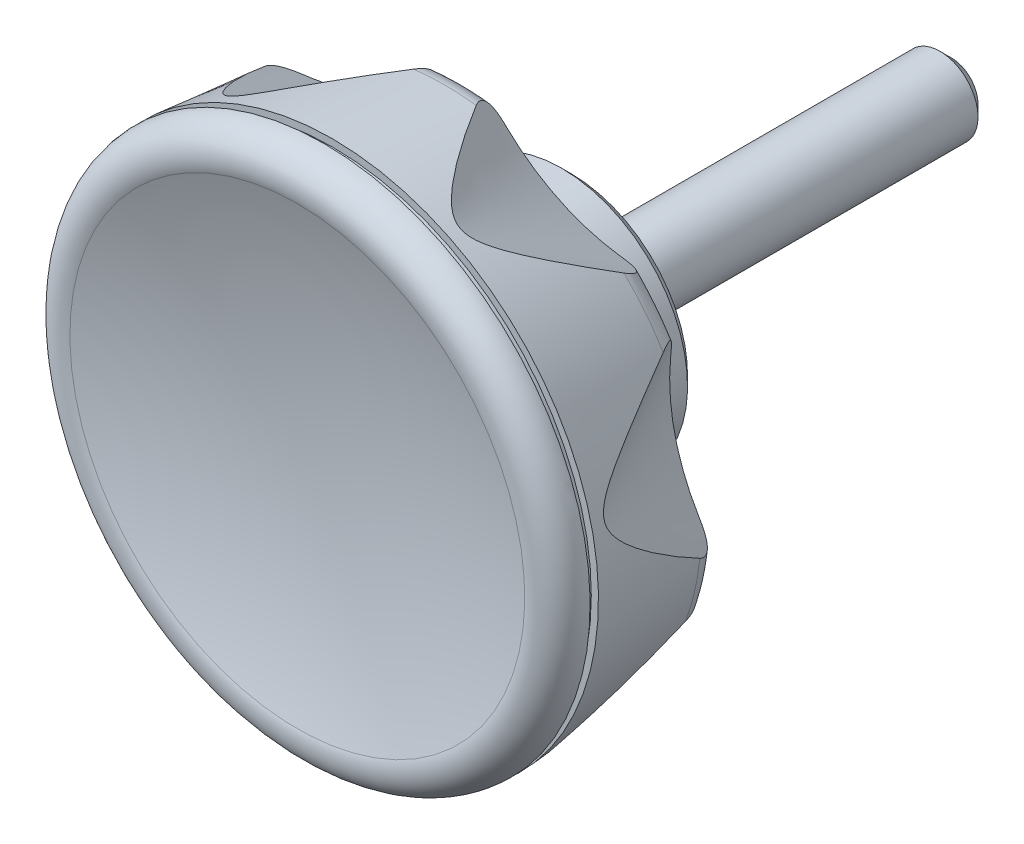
ISO-10303-21;
HEADER;
FILE_DESCRIPTION(('STEP AP214'),'2;1');
FILE_NAME('part.step','',(''),(''),'','','');
FILE_SCHEMA(('AUTOMOTIVE_DESIGN { 1 0 10303 214 1 1 1 1 }'));
ENDSEC;
DATA;
#1=APPLICATION_CONTEXT('core data for automotive mechanical design processes');
#2=APPLICATION_PROTOCOL_DEFINITION('international standard','automotive_design',2000,#1);
#3=PRODUCT_CONTEXT('',#1,'mechanical');
#4=PRODUCT('Part','Part','',(#3));
#5=PRODUCT_RELATED_PRODUCT_CATEGORY('part','',(#4));
#6=PRODUCT_DEFINITION_FORMATION('','',#4);
#7=PRODUCT_DEFINITION_CONTEXT('part definition',#1,'design');
#8=PRODUCT_DEFINITION('design','',#6,#7);
#9=PRODUCT_DEFINITION_SHAPE('','',#8);
#10=(LENGTH_UNIT() NAMED_UNIT(*) SI_UNIT(.MILLI.,.METRE.));
#11=(NAMED_UNIT(*) PLANE_ANGLE_UNIT() SI_UNIT($,.RADIAN.));
#12=(NAMED_UNIT(*) SI_UNIT($,.STERADIAN.) SOLID_ANGLE_UNIT());
#13=UNCERTAINTY_MEASURE_WITH_UNIT(LENGTH_MEASURE(1.E-05),#10,'distance_accuracy_value','');
#14=(GEOMETRIC_REPRESENTATION_CONTEXT(3) GLOBAL_UNCERTAINTY_ASSIGNED_CONTEXT((#13)) GLOBAL_UNIT_ASSIGNED_CONTEXT((#10,
#11,#12)) REPRESENTATION_CONTEXT('',''));
#15=CARTESIAN_POINT('',(0.,0.,0.));
#16=DIRECTION('',(0.,0.,1.));
#17=DIRECTION('',(1.,0.,0.));
#18=AXIS2_PLACEMENT_3D('',#15,#16,#17);
#19=CARTESIAN_POINT('',(0.,0.,13.5));
#20=DIRECTION('',(0.,0.,1.));
#21=DIRECTION('',(0.,1.,0.));
#22=AXIS2_PLACEMENT_3D('',#19,#20,#21);
#23=TOROIDAL_SURFACE('',#22,24.4738282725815,2.4999999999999);
#24=CARTESIAN_POINT('',(0.,0.,11.));
#25=DIRECTION('',(0.,0.,1.));
#26=DIRECTION('',(0.,1.,0.));
#27=AXIS2_PLACEMENT_3D('',#24,#25,#26);
#28=CIRCLE('',#27,24.4738282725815);
#29=CARTESIAN_POINT('',(-16.2379624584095,18.3111126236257,11.));
#30=VERTEX_POINT('',#29);
#31=CARTESIAN_POINT('',(-21.4653013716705,11.7562369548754,11.));
#32=VERTEX_POINT('',#31);
#33=EDGE_CURVE('E131',#30,#32,#28,.T.);
#34=ORIENTED_EDGE('',*,*,#33,.T.);
#35=CARTESIAN_POINT('',(-21.4653013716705,11.7562369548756,11.));
#36=CARTESIAN_POINT('',(-21.4754382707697,11.8601222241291,11.000030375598));
#37=CARTESIAN_POINT('',(-21.4872751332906,11.9639124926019,11.0020766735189));
#38=CARTESIAN_POINT('',(-21.5148402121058,12.1711325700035,11.0112222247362));
#39=CARTESIAN_POINT('',(-21.5305827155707,12.2745596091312,11.0183402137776));
#40=CARTESIAN_POINT('',(-21.5666560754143,12.4816775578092,11.0388207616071));
#41=CARTESIAN_POINT('',(-21.5870535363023,12.5853482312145,11.0522773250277));
#42=CARTESIAN_POINT('',(-21.6327777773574,12.79018793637,11.086761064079));
#43=CARTESIAN_POINT('',(-21.6580966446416,12.8913606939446,11.1077761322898));
#44=CARTESIAN_POINT('',(-21.7159025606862,13.096009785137,11.1604458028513));
#45=CARTESIAN_POINT('',(-21.7487343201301,13.1992460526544,11.1926745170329));
#46=CARTESIAN_POINT('',(-21.8208966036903,13.3985520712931,11.2692171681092));
#47=CARTESIAN_POINT('',(-21.8602062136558,13.494643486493,11.313492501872));
#48=CARTESIAN_POINT('',(-21.9242907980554,13.631369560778,11.3905180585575));
#49=CARTESIAN_POINT('',(-21.9466893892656,13.6760092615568,11.4182052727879));
#50=CARTESIAN_POINT('',(-21.9930436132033,13.7619364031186,11.4772174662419));
#51=CARTESIAN_POINT('',(-22.0169983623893,13.8032257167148,11.5085403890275));
#52=CARTESIAN_POINT('',(-22.0662965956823,13.8818232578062,11.574842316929));
#53=CARTESIAN_POINT('',(-22.0916394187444,13.919133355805,11.6098195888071));
#54=CARTESIAN_POINT('',(-22.1434758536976,13.9891694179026,11.6833341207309));
#55=CARTESIAN_POINT('',(-22.1699692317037,14.0218963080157,11.7218706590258));
#56=CARTESIAN_POINT('',(-22.2204575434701,14.0784837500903,11.7972787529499));
#57=CARTESIAN_POINT('',(-22.2443568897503,14.1029401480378,11.8337680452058));
#58=CARTESIAN_POINT('',(-22.2925479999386,14.147619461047,11.9090357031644));
#59=CARTESIAN_POINT('',(-22.3168398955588,14.1678409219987,11.9478148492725));
#60=CARTESIAN_POINT('',(-22.3655101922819,14.2038164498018,12.0272744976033));
#61=CARTESIAN_POINT('',(-22.3898884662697,14.2195754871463,12.0679528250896));
#62=CARTESIAN_POINT('',(-22.4384945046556,14.2465760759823,12.1508760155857));
#63=CARTESIAN_POINT('',(-22.4627222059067,14.2578158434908,12.1931214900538));
#64=CARTESIAN_POINT('',(-22.5288434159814,14.2825299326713,12.3109990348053));
#65=CARTESIAN_POINT('',(-22.5703388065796,14.2913426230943,12.3878768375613));
#66=CARTESIAN_POINT('',(-22.6510509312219,14.2958836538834,12.5432786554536));
#67=CARTESIAN_POINT('',(-22.6902625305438,14.2915835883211,12.6218058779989));
#68=CARTESIAN_POINT('',(-22.7755265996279,14.2684993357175,12.7992847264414));
#69=CARTESIAN_POINT('',(-22.8206927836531,14.246227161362,12.8982168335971));
#70=CARTESIAN_POINT('',(-22.8841902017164,14.2010917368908,13.044286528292));
#71=CARTESIAN_POINT('',(-22.9046065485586,14.184142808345,13.0924834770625));
#72=CARTESIAN_POINT('',(-22.9440559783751,14.146710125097,13.187982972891));
#73=CARTESIAN_POINT('',(-22.9630908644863,14.1262311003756,13.2352866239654));
#74=CARTESIAN_POINT('',(-22.9814573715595,14.1041446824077,13.2821097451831));
#75=B_SPLINE_CURVE_WITH_KNOTS('',3,(#35,#36,#37,#38,#39,#40,#41,#42,#43,#44,#45,#46,#47,#48,#49,
#50,#51,#52,#53,#54,#55,#56,#57,#58,#59,#60,#61,#62,#63,#64,#65,#66,#67,#68,#69,#70,#71,#72,#73,
#74),.UNSPECIFIED.,.F.,.F.,(4,2,2,2,2,2,2,2,2,2,2,2,2,2,2,2,2,2,2,4),(0.,0.313209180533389,
0.627581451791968,0.946770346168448,1.26545021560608,1.60369981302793,1.94087800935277,
2.11199734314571,2.28302035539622,2.45396261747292,2.62487029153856,2.77466826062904,
2.92451758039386,3.07419932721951,3.22394010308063,3.48614173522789,3.74891177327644,
4.08027673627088,4.24522540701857,4.40995475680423),.UNSPECIFIED.);
#76=CARTESIAN_POINT('',(-22.981457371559,14.1041446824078,13.2821097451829));
#77=VERTEX_POINT('',#76);
#78=EDGE_CURVE('E114',#32,#77,#75,.T.);
#79=ORIENTED_EDGE('',*,*,#78,.T.);
#80=CARTESIAN_POINT('',(0.,0.,13.282109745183));
#81=DIRECTION('',(0.,0.,1.));
#82=DIRECTION('',(0.,1.,0.));
#83=AXIS2_PLACEMENT_3D('',#80,#81,#82);
#84=CIRCLE('',#83,26.9643149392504);
#85=CARTESIAN_POINT('',(-18.8643796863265,19.2667968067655,13.282109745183));
#86=VERTEX_POINT('',#85);
#87=EDGE_CURVE('E146',#86,#77,#84,.T.);
#88=ORIENTED_EDGE('',*,*,#87,.F.);
#89=CARTESIAN_POINT('',(-18.8643796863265,19.2667968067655,13.282109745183));
#90=CARTESIAN_POINT('',(-18.8981743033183,19.2226732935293,13.1915305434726));
#91=CARTESIAN_POINT('',(-18.9255552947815,19.1772447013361,13.0988167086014));
#92=CARTESIAN_POINT('',(-18.9651950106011,19.0843052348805,12.9100927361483));
#93=CARTESIAN_POINT('',(-18.9773008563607,19.0367781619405,12.8140590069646));
#94=CARTESIAN_POINT('',(-18.983341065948,18.9407957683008,12.6209607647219));
#95=CARTESIAN_POINT('',(-18.9771650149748,18.8923365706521,12.5238935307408));
#96=CARTESIAN_POINT('',(-18.9442986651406,18.7968510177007,12.3329550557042));
#97=CARTESIAN_POINT('',(-18.917699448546,18.7498192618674,12.2390715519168));
#98=CARTESIAN_POINT('',(-18.8474169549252,18.6641060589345,12.0674765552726));
#99=CARTESIAN_POINT('',(-18.8058006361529,18.6250650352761,11.9890989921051));
#100=CARTESIAN_POINT('',(-18.7069025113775,18.5516039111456,11.8403817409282));
#101=CARTESIAN_POINT('',(-18.6496092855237,18.5171872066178,11.7700479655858));
#102=CARTESIAN_POINT('',(-18.5279204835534,18.457227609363,11.6454449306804));
#103=CARTESIAN_POINT('',(-18.4646762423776,18.4311577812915,11.5902907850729));
#104=CARTESIAN_POINT('',(-18.3299240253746,18.3843608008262,11.4887242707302));
#105=CARTESIAN_POINT('',(-18.2584221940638,18.3636297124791,11.4423054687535));
#106=CARTESIAN_POINT('',(-18.0741590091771,18.3189481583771,11.3379996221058));
#107=CARTESIAN_POINT('',(-17.9578593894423,18.2981009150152,11.2850492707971));
#108=CARTESIAN_POINT('',(-17.7173155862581,18.2668011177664,11.1949523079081));
#109=CARTESIAN_POINT('',(-17.5930199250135,18.2564250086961,11.1579230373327));
#110=CARTESIAN_POINT('',(-17.3654004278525,18.2458816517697,11.1030967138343));
#111=CARTESIAN_POINT('',(-17.2626807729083,18.2441255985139,11.0829631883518));
#112=CARTESIAN_POINT('',(-17.0560091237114,18.2457463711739,11.0499258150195));
#113=CARTESIAN_POINT('',(-16.9520556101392,18.2491303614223,11.0370320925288));
#114=CARTESIAN_POINT('',(-16.7461255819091,18.260237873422,11.0174873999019));
#115=CARTESIAN_POINT('',(-16.6441552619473,18.2678653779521,11.0107067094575));
#116=CARTESIAN_POINT('',(-16.4406884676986,18.2868392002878,11.0019849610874));
#117=CARTESIAN_POINT('',(-16.3391915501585,18.2981729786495,11.000027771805));
#118=CARTESIAN_POINT('',(-16.2379624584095,18.3111126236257,11.));
#119=B_SPLINE_CURVE_WITH_KNOTS('',3,(#89,#90,#91,#92,#93,#94,#95,#96,#97,#98,#99,#100,#101,#102,
#103,#104,#105,#106,#107,#108,#109,#110,#111,#112,#113,#114,#115,#116,#117,#118),.UNSPECIFIED.,
.F.,.F.,(4,2,2,2,2,2,2,2,2,2,2,2,2,2,4),(0.,0.319088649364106,0.641346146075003,
0.96555390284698,1.28832411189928,1.57749027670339,1.86686764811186,2.12940978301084,
2.39175780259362,2.77800167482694,3.16704536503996,3.48068996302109,3.79477212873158,
4.10202079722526,4.40824052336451),.UNSPECIFIED.);
#120=EDGE_CURVE('E136',#86,#30,#119,.T.);
#121=ORIENTED_EDGE('',*,*,#120,.T.);
#122=EDGE_LOOP('',(#34,#79,#88,#121));
#123=FACE_BOUND('',#122,.T.);
#124=ADVANCED_FACE('F14',(#123),#23,.T.);
#125=CARTESIAN_POINT('',(-26.8251366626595,-2.73611461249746,13.282109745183));
#126=VERTEX_POINT('',#125);
#127=CARTESIAN_POINT('',(-25.355768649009,-9.17383651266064,13.282109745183));
#128=VERTEX_POINT('',#127);
#129=EDGE_CURVE('E153',#126,#128,#84,.T.);
#130=ORIENTED_EDGE('',*,*,#129,.F.);
#131=CARTESIAN_POINT('',(-26.8251366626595,-2.73611461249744,13.282109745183));
#132=CARTESIAN_POINT('',(-26.8117101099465,-2.79004686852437,13.1915305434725));
#133=CARTESIAN_POINT('',(-26.7932643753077,-2.83977845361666,13.0988167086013));
#134=CARTESIAN_POINT('',(-26.7453163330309,-2.92871684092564,12.9100927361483));
#135=CARTESIAN_POINT('',(-26.7157060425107,-2.96781421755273,12.8140590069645));
#136=CARTESIAN_POINT('',(-26.6444299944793,-3.0323806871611,12.620960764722));
#137=CARTESIAN_POINT('',(-26.602692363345,-3.0577658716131,12.5238935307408));
#138=CARTESIAN_POINT('',(-26.507546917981,-3.09160419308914,12.3329550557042));
#139=CARTESIAN_POINT('',(-26.4541916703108,-3.10013190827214,12.2390715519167));
#140=CARTESIAN_POINT('',(-26.3433579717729,-3.09862415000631,12.0674765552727));
#141=CARTESIAN_POINT('',(-26.2868871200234,-3.09042888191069,11.9890989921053));
#142=CARTESIAN_POINT('',(-26.1677909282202,-3.05890947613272,11.8403817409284));
#143=CARTESIAN_POINT('',(-26.1051611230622,-3.03557429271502,11.7700479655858));
#144=CARTESIAN_POINT('',(-25.9824110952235,-2.97781835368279,11.6454449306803));
#145=CARTESIAN_POINT('',(-25.9225967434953,-2.94462628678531,11.590290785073));
#146=CARTESIAN_POINT('',(-25.8019927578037,-2.86845020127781,11.4887242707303));
#147=CARTESIAN_POINT('',(-25.7412038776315,-2.82547344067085,11.4423054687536));
#148=CARTESIAN_POINT('',(-25.5913842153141,-2.70926917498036,11.3379996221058));
#149=CARTESIAN_POINT('',(-25.5025735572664,-2.63134051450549,11.2850492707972));
#150=CARTESIAN_POINT('',(-25.3281257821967,-2.46279090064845,11.194952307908));
#151=CARTESIAN_POINT('',(-25.2425163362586,-2.37208203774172,11.1579230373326));
#152=CARTESIAN_POINT('',(-25.0923547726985,-2.20069562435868,11.1030967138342));
#153=CARTESIAN_POINT('',(-25.0269371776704,-2.12148104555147,11.0829631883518));
#154=CARTESIAN_POINT('',(-24.8993466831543,-1.95888810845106,11.0499258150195));
#155=CARTESIAN_POINT('',(-24.8371784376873,-1.87550409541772,11.0370320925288));
#156=CARTESIAN_POINT('',(-24.7174673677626,-1.70757609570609,11.0174873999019));
#157=CARTESIAN_POINT('',(-24.6598533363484,-1.62309681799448,11.0107067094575));
#158=CARTESIAN_POINT('',(-24.5478281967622,-1.45219008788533,11.0019849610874));
#159=CARTESIAN_POINT('',(-24.4934070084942,-1.365770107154,11.000027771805));
#160=CARTESIAN_POINT('',(-24.4404083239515,-1.27855827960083,11.));
#161=B_SPLINE_CURVE_WITH_KNOTS('',3,(#131,#132,#133,#134,#135,#136,#137,#138,#139,#140,#141,
#142,#143,#144,#145,#146,#147,#148,#149,#150,#151,#152,#153,#154,#155,#156,#157,#158,#159,#160),
.UNSPECIFIED.,.F.,.F.,(4,2,2,2,2,2,2,2,2,2,2,2,2,2,4),(0.,0.319088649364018,0.641346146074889,
0.965553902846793,1.288324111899,1.57749027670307,1.8668676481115,2.12940978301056,
2.39175780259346,2.77800167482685,3.16704536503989,3.4806899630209,3.79477212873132,
4.10202079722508,4.40824052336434),.UNSPECIFIED.);
#162=CARTESIAN_POINT('',(-24.4404083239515,-1.27855827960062,11.));
#163=VERTEX_POINT('',#162);
#164=EDGE_CURVE('E29',#126,#163,#161,.T.);
#165=ORIENTED_EDGE('',*,*,#164,.T.);
#166=CARTESIAN_POINT('',(-22.5747926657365,-9.45235454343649,11.));
#167=VERTEX_POINT('',#166);
#168=EDGE_CURVE('E133',#163,#167,#28,.T.);
#169=ORIENTED_EDGE('',*,*,#168,.T.);
#170=CARTESIAN_POINT('',(-22.5747926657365,-9.45235454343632,11.));
#171=CARTESIAN_POINT('',(-22.6623336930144,-9.39550848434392,11.000030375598));
#172=CARTESIAN_POINT('',(-22.7508603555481,-9.34005074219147,11.0020766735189));
#173=CARTESIAN_POINT('',(-22.930058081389,-9.23240238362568,11.0112222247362));
#174=CARTESIAN_POINT('',(-23.0207358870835,-9.18022466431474,11.0183402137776));
#175=CARTESIAN_POINT('',(-23.2051585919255,-9.07929202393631,11.0388207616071));
#176=CARTESIAN_POINT('',(-23.2989291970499,-9.03060179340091,11.0522773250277));
#177=CARTESIAN_POINT('',(-23.4875879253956,-8.93863497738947,11.0867610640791));
#178=CARTESIAN_POINT('',(-23.5824740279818,-8.89534988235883,11.1077761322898));
#179=CARTESIAN_POINT('',(-23.7785165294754,-8.81294774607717,11.1604458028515));
#180=CARTESIAN_POINT('',(-23.8797001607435,-8.77424988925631,11.1926745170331));
#181=CARTESIAN_POINT('',(-24.0805163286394,-8.70640336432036,11.2692171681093));
#182=CARTESIAN_POINT('',(-24.1801527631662,-8.67722483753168,11.3134925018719));
#183=CARTESIAN_POINT('',(-24.3270055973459,-8.64208087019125,11.3905180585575));
#184=CARTESIAN_POINT('',(-24.3758716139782,-8.63176039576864,11.4182052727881));
#185=CARTESIAN_POINT('',(-24.4719535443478,-8.6144268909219,11.4772174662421));
#186=CARTESIAN_POINT('',(-24.5191703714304,-8.60741200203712,11.5085403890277));
#187=CARTESIAN_POINT('',(-24.611357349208,-8.59695014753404,11.5748423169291));
#188=CARTESIAN_POINT('',(-24.6563285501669,-8.59350149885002,11.6098195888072));
#189=CARTESIAN_POINT('',(-24.7434044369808,-8.59036208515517,11.683334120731));
#190=CARTESIAN_POINT('',(-24.785509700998,-8.59067055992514,11.721870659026));
#191=CARTESIAN_POINT('',(-24.8612304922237,-8.594862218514,11.79727875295));
#192=CARTESIAN_POINT('',(-24.8952522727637,-8.59829916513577,11.8337680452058));
#193=CARTESIAN_POINT('',(-24.960230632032,-8.60811939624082,11.9090357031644));
#194=CARTESIAN_POINT('',(-24.9911861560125,-8.61450369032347,11.9478148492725));
#195=CARTESIAN_POINT('',(-25.0496583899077,-8.63012528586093,12.0272744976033));
#196=CARTESIAN_POINT('',(-25.0771789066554,-8.63935938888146,12.0679528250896));
#197=CARTESIAN_POINT('',(-25.1285941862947,-8.66052652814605,12.1508760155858));
#198=CARTESIAN_POINT('',(-25.152487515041,-8.67246062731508,12.1931214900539));
#199=CARTESIAN_POINT('',(-25.2130356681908,-8.70874728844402,12.3109990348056));
#200=CARTESIAN_POINT('',(-25.2457976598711,-8.73569506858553,12.3878768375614));
#201=CARTESIAN_POINT('',(-25.2996711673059,-8.79596706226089,12.5432786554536));
#202=CARTESIAN_POINT('',(-25.3207572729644,-8.82930497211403,12.621805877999));
#203=CARTESIAN_POINT('',(-25.3558705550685,-8.91035990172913,12.7992847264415));
#204=CARTESIAN_POINT('',(-25.3666181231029,-8.9595587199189,12.8982168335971));
#205=CARTESIAN_POINT('',(-25.3709198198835,-9.03734447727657,13.0442865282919));
#206=CARTESIAN_POINT('',(-25.3703979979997,-9.0638741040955,13.0924834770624));
#207=CARTESIAN_POINT('',(-25.3657282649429,-9.11805580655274,13.1879829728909));
#208=CARTESIAN_POINT('',(-25.3615851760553,-9.14570634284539,13.2352866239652));
#209=CARTESIAN_POINT('',(-25.355768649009,-9.17383651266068,13.282109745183));
#210=B_SPLINE_CURVE_WITH_KNOTS('',3,(#170,#171,#172,#173,#174,#175,#176,#177,#178,#179,#180,
#181,#182,#183,#184,#185,#186,#187,#188,#189,#190,#191,#192,#193,#194,#195,#196,#197,#198,#199,
#200,#201,#202,#203,#204,#205,#206,#207,#208,#209),.UNSPECIFIED.,.F.,.F.,(4,2,2,2,2,2,2,2,2,2,2,
2,2,2,2,2,2,2,2,4),(0.,0.313209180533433,0.627581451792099,0.946770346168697,1.26545021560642,
1.60369981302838,1.9408780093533,2.11199734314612,2.28302035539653,2.45396261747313,
2.62487029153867,2.77466826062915,2.92451758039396,3.07419932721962,3.22394010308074,
3.48614173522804,3.74891177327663,4.08027673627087,4.24522540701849,4.40995475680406),.UNSPECIFIED.);
#211=EDGE_CURVE('E306',#167,#128,#210,.T.);
#212=ORIENTED_EDGE('',*,*,#211,.T.);
#213=EDGE_LOOP('',(#130,#165,#169,#212));
#214=FACE_BOUND('',#213,.T.);
#215=ADVANCED_FACE('F416',(#214),#23,.T.);
#216=CARTESIAN_POINT('',(-14.586018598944,-22.6786759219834,13.282109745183));
#217=VERTEX_POINT('',#216);
#218=CARTESIAN_POINT('',(-8.63666897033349,-25.5437317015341,13.282109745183));
#219=VERTEX_POINT('',#218);
#220=EDGE_CURVE('E157',#217,#219,#84,.T.);
#221=ORIENTED_EDGE('',*,*,#220,.F.);
#222=CARTESIAN_POINT('',(-14.586018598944,-22.6786759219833,13.282109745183));
#223=CARTESIAN_POINT('',(-14.5354813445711,-22.7018048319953,13.1915305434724));
#224=CARTESIAN_POINT('',(-14.4850988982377,-22.7183905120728,13.0988167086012));
#225=CARTESIAN_POINT('',(-14.3856689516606,-22.736355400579,12.9100927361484));
#226=CARTESIAN_POINT('',(-14.336639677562,-22.7375819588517,12.8140590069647));
#227=CARTESIAN_POINT('',(-14.2417196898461,-22.7221126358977,12.620960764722));
#228=CARTESIAN_POINT('',(-14.1958497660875,-22.7053082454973,12.5238935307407));
#229=CARTESIAN_POINT('',(-14.1100716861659,-22.6520183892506,12.3329550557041));
#230=CARTESIAN_POINT('',(-14.070137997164,-22.6156205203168,12.2390715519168));
#231=CARTESIAN_POINT('',(-14.0022131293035,-22.5280271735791,12.0674765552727));
#232=CARTESIAN_POINT('',(-13.9734114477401,-22.4787668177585,11.9890989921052));
#233=CARTESIAN_POINT('',(-13.9237990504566,-22.3660016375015,11.8403817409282));
#234=CARTESIAN_POINT('',(-13.9029941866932,-22.3024864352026,11.7700479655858));
#235=CARTESIAN_POINT('',(-13.8716162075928,-22.1705063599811,11.6454449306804));
#236=CARTESIAN_POINT('',(-13.8602731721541,-22.1030467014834,11.590290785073));
#237=CARTESIAN_POINT('',(-13.8446346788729,-21.9612596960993,11.4887242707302));
#238=CARTESIAN_POINT('',(-13.8403340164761,-21.8869374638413,11.4423054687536));
#239=CARTESIAN_POINT('',(-13.8377751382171,-21.6973515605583,11.3379996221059));
#240=CARTESIAN_POINT('',(-13.8433296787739,-21.5793288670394,11.2850492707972));
#241=CARTESIAN_POINT('',(-13.8663406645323,-21.3378511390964,11.194952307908));
#242=CARTESIAN_POINT('',(-13.8838830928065,-21.2143629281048,11.1579230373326));
#243=CARTESIAN_POINT('',(-13.9242541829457,-20.9901042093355,11.1030967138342));
#244=CARTESIAN_POINT('',(-13.9453994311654,-20.8895691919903,11.0829631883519));
#245=CARTESIAN_POINT('',(-13.9929683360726,-20.6884398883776,11.0499258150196));
#246=CARTESIAN_POINT('',(-14.0193993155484,-20.5878457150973,11.0370320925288));
#247=CARTESIAN_POINT('',(-14.0760520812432,-20.3895504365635,11.0174873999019));
#248=CARTESIAN_POINT('',(-14.1061788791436,-20.2918340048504,11.0107067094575));
#249=CARTESIAN_POINT('',(-14.1699526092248,-20.097690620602,11.0019849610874));
#250=CARTESIAN_POINT('',(-14.2035874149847,-20.001260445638,11.000027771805));
#251=CARTESIAN_POINT('',(-14.238728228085,-19.9054487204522,11.));
#252=B_SPLINE_CURVE_WITH_KNOTS('',3,(#222,#223,#224,#225,#226,#227,#228,#229,#230,#231,#232,
#233,#234,#235,#236,#237,#238,#239,#240,#241,#242,#243,#244,#245,#246,#247,#248,#249,#250,#251),
.UNSPECIFIED.,.F.,.F.,(4,2,2,2,2,2,2,2,2,2,2,2,2,2,4),(0.,0.319088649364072,0.641346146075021,
0.965553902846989,1.28832411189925,1.5774902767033,1.86686764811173,2.12940978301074,
2.39175780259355,2.77800167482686,3.16704536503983,3.48068996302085,3.79477212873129,
4.10202079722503,4.40824052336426),.UNSPECIFIED.);
#253=CARTESIAN_POINT('',(-14.238728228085,-19.905448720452,11.));
#254=VERTEX_POINT('',#253);
#255=EDGE_CURVE('E37',#217,#254,#252,.T.);
#256=ORIENTED_EDGE('',*,*,#255,.T.);
#257=CARTESIAN_POINT('',(-6.685004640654,-23.5431302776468,11.));
#258=VERTEX_POINT('',#257);
#259=EDGE_CURVE('E143',#254,#258,#28,.T.);
#260=ORIENTED_EDGE('',*,*,#259,.T.);
#261=CARTESIAN_POINT('',(-6.685004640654,-23.5431302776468,11.));
#262=CARTESIAN_POINT('',(-6.78402961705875,-23.5761296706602,11.000030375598));
#263=CARTESIAN_POINT('',(-6.88258369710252,-23.6107652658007,11.0020766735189));
#264=CARTESIAN_POINT('',(-7.07847452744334,-23.6837500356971,11.0112222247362));
#265=CARTESIAN_POINT('',(-7.17580539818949,-23.7221125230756,11.0183402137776));
#266=CARTESIAN_POINT('',(-7.36970338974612,-23.8033695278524,11.0388207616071));
#267=CARTESIAN_POINT('',(-7.46623596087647,-23.8463244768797,11.0522773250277));
#268=CARTESIAN_POINT('',(-7.65576530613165,-23.9364834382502,11.0867610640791));
#269=CARTESIAN_POINT('',(-7.74876747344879,-23.9836805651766,11.1077761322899));
#270=CARTESIAN_POINT('',(-7.93542255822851,-24.0855758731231,11.1604458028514));
#271=CARTESIAN_POINT('',(-8.02876472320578,-24.1405567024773,11.192674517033));
#272=CARTESIAN_POINT('',(-8.2070161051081,-24.2552594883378,11.2692171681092));
#273=CARTESIAN_POINT('',(-8.29195109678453,-24.3149658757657,11.313492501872));
#274=CARTESIAN_POINT('',(-8.41098900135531,-24.4078681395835,11.3905180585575));
#275=CARTESIAN_POINT('',(-8.44952533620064,-24.4396384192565,11.418205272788));
#276=CARTESIAN_POINT('',(-8.52298331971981,-24.5039510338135,11.477217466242));
#277=CARTESIAN_POINT('',(-8.55790699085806,-24.5364929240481,11.5085403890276));
#278=CARTESIAN_POINT('',(-8.62356403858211,-24.602044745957,11.5748423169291));
#279=CARTESIAN_POINT('',(-8.65429938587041,-24.6350544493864,11.6098195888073));
#280=CARTESIAN_POINT('',(-8.71104480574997,-24.7011757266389,11.683334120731));
#281=CARTESIAN_POINT('',(-8.73705583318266,-24.7342872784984,11.7218706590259));
#282=CARTESIAN_POINT('',(-8.78098980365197,-24.796101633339,11.7972787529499));
#283=CARTESIAN_POINT('',(-8.79951492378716,-24.824843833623,11.8337680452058));
#284=CARTESIAN_POINT('',(-8.8323505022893,-24.8817687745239,11.9090357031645));
#285=CARTESIAN_POINT('',(-8.84665951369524,-24.9099513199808,11.9478148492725));
#286=CARTESIAN_POINT('',(-8.87090290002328,-24.9654066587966,12.0272744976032));
#287=CARTESIAN_POINT('',(-8.88084214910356,-24.9926804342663,12.0679528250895));
#288=CARTESIAN_POINT('',(-8.89634991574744,-25.0460760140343,12.1508760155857));
#289=CARTESIAN_POINT('',(-8.90191670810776,-25.0721973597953,12.1931214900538));
#290=CARTESIAN_POINT('',(-8.91129781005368,-25.1421601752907,12.3109990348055));
#291=CARTESIAN_POINT('',(-8.91065595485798,-25.1845761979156,12.3878768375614));
#292=CARTESIAN_POINT('',(-8.8971229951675,-25.2642751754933,12.5432786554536));
#293=CARTESIAN_POINT('',(-8.88420533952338,-25.3015468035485,12.621805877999));
#294=CARTESIAN_POINT('',(-8.84272681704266,-25.3795363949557,12.7992847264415));
#295=CARTESIAN_POINT('',(-8.81096263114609,-25.4186141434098,12.8982168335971));
#296=CARTESIAN_POINT('',(-8.75282934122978,-25.4704759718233,13.044286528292));
#297=CARTESIAN_POINT('',(-8.73176229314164,-25.486608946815,13.0924834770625));
#298=CARTESIAN_POINT('',(-8.68648980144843,-25.5167397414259,13.187982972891));
#299=CARTESIAN_POINT('',(-8.66228856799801,-25.5307403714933,13.2352866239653));
#300=CARTESIAN_POINT('',(-8.63666897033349,-25.5437317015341,13.2821097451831));
#301=B_SPLINE_CURVE_WITH_KNOTS('',3,(#261,#262,#263,#264,#265,#266,#267,#268,#269,#270,#271,
#272,#273,#274,#275,#276,#277,#278,#279,#280,#281,#282,#283,#284,#285,#286,#287,#288,#289,#290,
#291,#292,#293,#294,#295,#296,#297,#298,#299,#300),.UNSPECIFIED.,.F.,.F.,(4,2,2,2,2,2,2,2,2,2,2,
2,2,2,2,2,2,2,2,4),(0.,0.313209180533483,0.627581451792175,0.946770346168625,1.26545021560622,
1.60369981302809,1.940878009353,2.11199734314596,2.28302035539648,2.45396261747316,
2.62487029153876,2.77466826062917,2.92451758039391,3.07419932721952,3.22394010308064,
3.48614173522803,3.74891177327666,4.0802767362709,4.24522540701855,4.40995475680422),.UNSPECIFIED.);
#302=EDGE_CURVE('E322',#258,#219,#301,.T.);
#303=ORIENTED_EDGE('',*,*,#302,.T.);
#304=EDGE_LOOP('',(#221,#256,#260,#303));
#305=FACE_BOUND('',#304,.T.);
#306=ADVANCED_FACE('F447',(#305),#23,.T.);
#307=CARTESIAN_POINT('',(8.636668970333,-25.5437317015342,13.282109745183));
#308=VERTEX_POINT('',#307);
#309=CARTESIAN_POINT('',(14.586018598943,-22.6786759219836,13.282109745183));
#310=VERTEX_POINT('',#309);
#311=EDGE_CURVE('E455',#308,#310,#84,.T.);
#312=ORIENTED_EDGE('',*,*,#311,.F.);
#313=CARTESIAN_POINT('',(8.636668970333,-25.5437317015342,13.2821097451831));
#314=CARTESIAN_POINT('',(8.68626134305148,-25.5186407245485,13.1915305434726));
#315=CARTESIAN_POINT('',(8.73064149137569,-25.4895911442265,13.0988167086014));
#316=CARTESIAN_POINT('',(8.80668056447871,-25.4230546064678,12.9100927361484));
#317=CARTESIAN_POINT('',(8.83820877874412,-25.3854867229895,12.8140590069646));
#318=CARTESIAN_POINT('',(8.88529601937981,-25.3016303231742,12.6209607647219));
#319=CARTESIAN_POINT('',(8.90075724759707,-25.2552904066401,12.5238935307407));
#320=CARTESIAN_POINT('',(8.91257531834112,-25.1550007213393,12.3329550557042));
#321=CARTESIAN_POINT('',(8.90901656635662,-25.1010856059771,12.2390715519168));
#322=CARTESIAN_POINT('',(8.88288379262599,-24.9933662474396,12.0674765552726));
#323=CARTESIAN_POINT('',(8.8623280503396,-24.9401348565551,11.9890989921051));
#324=CARTESIAN_POINT('',(8.80509750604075,-24.8310383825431,11.8403817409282));
#325=CARTESIAN_POINT('',(8.76841094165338,-24.7751714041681,11.7700479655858));
#326=CARTESIAN_POINT('',(8.68478861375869,-24.6683508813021,11.6454449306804));
#327=CARTESIAN_POINT('',(8.63911879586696,-24.6174221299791,11.5902907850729));
#328=CARTESIAN_POINT('',(8.53801569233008,-24.5167927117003,11.4887242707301));
#329=CARTESIAN_POINT('',(8.48258965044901,-24.4670911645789,11.4423054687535));
#330=CARTESIAN_POINT('',(8.33596085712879,-24.3468856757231,11.3379996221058));
#331=CARTESIAN_POINT('',(8.24022380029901,-24.277642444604,11.285049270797));
#332=CARTESIAN_POINT('',(8.03708179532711,-24.1450742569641,11.194952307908));
#333=CARTESIAN_POINT('',(7.9295972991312,-24.081795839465,11.1579230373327));
#334=CARTESIAN_POINT('',(7.72909380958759,-23.9735362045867,11.1030967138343));
#335=CARTESIAN_POINT('',(7.63730852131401,-23.9273856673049,11.0829631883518));
#336=CARTESIAN_POINT('',(7.45040057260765,-23.8391744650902,11.0499258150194));
#337=CARTESIAN_POINT('',(7.35527343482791,-23.7971195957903,11.0370320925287));
#338=CARTESIAN_POINT('',(7.16491752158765,-23.7177774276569,11.0174873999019));
#339=CARTESIAN_POINT('',(7.06973598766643,-23.6804063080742,11.0107067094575));
#340=CARTESIAN_POINT('',(6.87818630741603,-23.6092201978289,11.0019849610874));
#341=CARTESIAN_POINT('',(6.78182320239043,-23.5753937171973,11.000027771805));
#342=CARTESIAN_POINT('',(6.6850046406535,-23.543130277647,11.));
#343=B_SPLINE_CURVE_WITH_KNOTS('',3,(#313,#314,#315,#316,#317,#318,#319,#320,#321,#322,#323,
#324,#325,#326,#327,#328,#329,#330,#331,#332,#333,#334,#335,#336,#337,#338,#339,#340,#341,#342),
.UNSPECIFIED.,.F.,.F.,(4,2,2,2,2,2,2,2,2,2,2,2,2,2,4),(0.,0.319088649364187,0.641346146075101,
0.965553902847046,1.28832411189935,1.57749027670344,1.86686764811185,2.12940978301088,
2.39175780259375,2.77800167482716,3.16704536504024,3.48068996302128,3.79477212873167,
4.1020207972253,4.40824052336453),.UNSPECIFIED.);
#344=CARTESIAN_POINT('',(6.685004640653,-23.5431302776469,11.));
#345=VERTEX_POINT('',#344);
#346=EDGE_CURVE('E315',#308,#345,#343,.T.);
#347=ORIENTED_EDGE('',*,*,#346,.T.);
#348=CARTESIAN_POINT('',(14.2387282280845,-19.9054487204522,11.));
#349=VERTEX_POINT('',#348);
#350=EDGE_CURVE('E449',#345,#349,#28,.T.);
#351=ORIENTED_EDGE('',*,*,#350,.T.);
#352=CARTESIAN_POINT('',(14.2387282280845,-19.9054487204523,11.));
#353=CARTESIAN_POINT('',(14.202787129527,-20.0034443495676,11.000030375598));
#354=CARTESIAN_POINT('',(14.168418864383,-20.1020919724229,11.0020766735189));
#355=CARTESIAN_POINT('',(14.1033447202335,-20.3007508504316,11.0112222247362));
#356=CARTESIAN_POINT('',(14.0726529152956,-20.4007658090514,11.0183402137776));
#357=CARTESIAN_POINT('',(14.0152887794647,-20.6030242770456,11.038820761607));
#358=CARTESIAN_POINT('',(13.9886852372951,-20.7052784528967,11.0522773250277));
#359=CARTESIAN_POINT('',(13.9410047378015,-20.9096716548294,11.086761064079));
#360=CARTESIAN_POINT('',(13.9199190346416,-21.0118106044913,11.1077761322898));
#361=CARTESIAN_POINT('',(13.8832064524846,-21.2212741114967,11.1604458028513));
#362=CARTESIAN_POINT('',(13.8679943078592,-21.3285319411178,11.1926745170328));
#363=CARTESIAN_POINT('',(13.8465346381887,-21.5394105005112,11.269217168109));
#364=CARTESIAN_POINT('',(13.8402588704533,-21.6430416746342,11.3134925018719));
#365=CARTESIAN_POINT('',(13.8386738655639,-21.7940328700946,11.3905180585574));
#366=CARTESIAN_POINT('',(13.8394858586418,-21.843970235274,11.4182052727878));
#367=CARTESIAN_POINT('',(13.8439671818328,-21.9415002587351,11.4772174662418));
#368=CARTESIAN_POINT('',(13.8476349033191,-21.9890942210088,11.5085403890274));
#369=CARTESIAN_POINT('',(13.8579488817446,-22.0812978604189,11.5748423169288));
#370=CARTESIAN_POINT('',(13.8645937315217,-22.1259089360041,11.609819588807));
#371=CARTESIAN_POINT('',(13.8809092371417,-22.2115002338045,11.6833341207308));
#372=CARTESIAN_POINT('',(13.8905792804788,-22.2524811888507,11.7218706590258));
#373=CARTESIAN_POINT('',(13.9115153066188,-22.3253707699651,11.7972787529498));
#374=CARTESIAN_POINT('',(13.9224366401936,-22.3577747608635,11.8337680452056));
#375=CARTESIAN_POINT('',(13.9464697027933,-22.4189387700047,11.9090357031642));
#376=CARTESIAN_POINT('',(13.9595821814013,-22.4476975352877,11.9478148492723));
#377=CARTESIAN_POINT('',(13.9878234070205,-22.5012276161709,12.0272744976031));
#378=CARTESIAN_POINT('',(14.0029498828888,-22.5260033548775,12.0679528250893));
#379=CARTESIAN_POINT('',(14.0350272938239,-22.5714194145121,12.1508760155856));
#380=CARTESIAN_POINT('',(14.0519789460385,-22.5920581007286,12.1931214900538));
#381=CARTESIAN_POINT('',(14.1008290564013,-22.6430136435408,12.3109990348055));
#382=CARTESIAN_POINT('',(14.1343914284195,-22.6689577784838,12.3878768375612));
#383=CARTESIAN_POINT('',(14.2051402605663,-22.7080687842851,12.5432786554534));
#384=CARTESIAN_POINT('',(14.2423344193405,-22.7212078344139,12.6218058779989));
#385=CARTESIAN_POINT('',(14.3291705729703,-22.7374043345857,12.7992847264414));
#386=CARTESIAN_POINT('',(14.3795274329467,-22.7369346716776,12.898216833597));
#387=CARTESIAN_POINT('',(14.4563201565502,-22.7238195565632,13.0442865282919));
#388=CARTESIAN_POINT('',(14.4820685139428,-22.7174074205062,13.0924834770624));
#389=CARTESIAN_POINT('',(14.5338526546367,-22.7007982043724,13.1879829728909));
#390=CARTESIAN_POINT('',(14.5598880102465,-22.6906061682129,13.2352866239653));
#391=CARTESIAN_POINT('',(14.586018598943,-22.6786759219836,13.2821097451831));
#392=B_SPLINE_CURVE_WITH_KNOTS('',3,(#352,#353,#354,#355,#356,#357,#358,#359,#360,#361,#362,
#363,#364,#365,#366,#367,#368,#369,#370,#371,#372,#373,#374,#375,#376,#377,#378,#379,#380,#381,
#382,#383,#384,#385,#386,#387,#388,#389,#390,#391),.UNSPECIFIED.,.F.,.F.,(4,2,2,2,2,2,2,2,2,2,2,
2,2,2,2,2,2,2,2,4),(0.,0.313209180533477,0.627581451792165,0.946770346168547,1.26545021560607,
1.60369981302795,1.94087800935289,2.11199734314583,2.28302035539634,2.45396261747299,
2.62487029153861,2.77466826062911,2.9245175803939,3.07419932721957,3.22394010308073,
3.48614173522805,3.74891177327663,4.08027673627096,4.24522540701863,4.40995475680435),.UNSPECIFIED.);
#393=EDGE_CURVE('E338',#349,#310,#392,.T.);
#394=ORIENTED_EDGE('',*,*,#393,.T.);
#395=EDGE_LOOP('',(#312,#347,#351,#394));
#396=FACE_BOUND('',#395,.T.);
#397=ADVANCED_FACE('F428',(#396),#23,.T.);
#398=CARTESIAN_POINT('',(25.3557686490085,-9.17383651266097,13.282109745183));
#399=VERTEX_POINT('',#398);
#400=CARTESIAN_POINT('',(26.825136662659,-2.73611461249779,13.282109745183));
#401=VERTEX_POINT('',#400);
#402=EDGE_CURVE('E164',#399,#401,#84,.T.);
#403=ORIENTED_EDGE('',*,*,#402,.F.);
#404=CARTESIAN_POINT('',(25.3557686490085,-9.17383651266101,13.282109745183));
#405=CARTESIAN_POINT('',(25.3670720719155,-9.11941966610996,13.1915305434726));
#406=CARTESIAN_POINT('',(25.3720307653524,-9.06660975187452,13.0988167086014));
#407=CARTESIAN_POINT('',(25.3674199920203,-8.96567515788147,12.9100927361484));
#408=CARTESIAN_POINT('',(25.3577057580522,-8.91760221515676,12.8140590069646));
#409=CARTESIAN_POINT('',(25.3215025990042,-8.82850431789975,12.6209607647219));
#410=CARTESIAN_POINT('',(25.294912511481,-8.78752377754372,12.5238935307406));
#411=CARTESIAN_POINT('',(25.2238713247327,-8.71575444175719,12.3329550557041));
#412=CARTESIAN_POINT('',(25.1794999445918,-8.68492126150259,12.2390715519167));
#413=CARTESIAN_POINT('',(25.0789880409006,-8.63819076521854,12.0674765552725));
#414=CARTESIAN_POINT('',(25.0245537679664,-8.62107266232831,11.989098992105));
#415=CARTESIAN_POINT('',(24.9035760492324,-8.59779676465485,11.8403817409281));
#416=CARTESIAN_POINT('',(24.8370237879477,-8.59164698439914,11.7700479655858));
#417=CARTESIAN_POINT('',(24.7013704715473,-8.5904240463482,11.6454449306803));
#418=CARTESIAN_POINT('',(24.633078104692,-8.59437659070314,11.5902907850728));
#419=CARTESIAN_POINT('',(24.4913661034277,-8.61068076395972,11.4887242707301));
#420=CARTESIAN_POINT('',(24.4179502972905,-8.62302618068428,11.4423054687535));
#421=CARTESIAN_POINT('',(24.2325483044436,-8.66271829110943,11.3379996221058));
#422=CARTESIAN_POINT('',(24.1187206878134,-8.69439608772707,11.285049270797));
#423=CARTESIAN_POINT('',(23.8884177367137,-8.77056398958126,11.1949523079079));
#424=CARTESIAN_POINT('',(23.771929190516,-8.815145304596,11.1579230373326));
#425=CARTESIAN_POINT('',(23.5622765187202,-8.90440646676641,11.1030967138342));
#426=CARTESIAN_POINT('',(23.4689673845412,-8.94739270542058,11.0829631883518));
#427=CARTESIAN_POINT('',(23.2834658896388,-9.03852443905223,11.0499258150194));
#428=CARTESIAN_POINT('',(23.1912752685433,-9.08667704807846,11.0370320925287));
#429=CARTESIAN_POINT('',(23.0105580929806,-9.18603426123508,11.0174873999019));
#430=CARTESIAN_POINT('',(22.9219954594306,-9.23714966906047,11.0107067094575));
#431=CARTESIAN_POINT('',(22.746910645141,-9.342525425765,11.0019849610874));
#432=CARTESIAN_POINT('',(22.6603826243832,-9.39677466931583,11.000027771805));
#433=CARTESIAN_POINT('',(22.5747926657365,-9.45235454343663,11.));
#434=B_SPLINE_CURVE_WITH_KNOTS('',3,(#404,#405,#406,#407,#408,#409,#410,#411,#412,#413,#414,
#415,#416,#417,#418,#419,#420,#421,#422,#423,#424,#425,#426,#427,#428,#429,#430,#431,#432,#433),
.UNSPECIFIED.,.F.,.F.,(4,2,2,2,2,2,2,2,2,2,2,2,2,2,4),(0.,0.319088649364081,0.641346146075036,
0.965553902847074,1.28832411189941,1.5774902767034,1.86686764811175,2.12940978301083,
2.39175780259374,2.77800167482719,3.1670453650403,3.48068996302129,3.79477212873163,
4.10202079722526,4.40824052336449),.UNSPECIFIED.);
#435=CARTESIAN_POINT('',(22.574792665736,-9.45235454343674,11.));
#436=VERTEX_POINT('',#435);
#437=EDGE_CURVE('E331',#399,#436,#434,.T.);
#438=ORIENTED_EDGE('',*,*,#437,.T.);
#439=CARTESIAN_POINT('',(24.440408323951,-1.27855827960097,11.));
#440=VERTEX_POINT('',#439);
#441=EDGE_CURVE('E152',#436,#440,#28,.T.);
#442=ORIENTED_EDGE('',*,*,#441,.T.);
#443=CARTESIAN_POINT('',(24.4404083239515,-1.2785582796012,11.));
#444=CARTESIAN_POINT('',(24.4946154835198,-1.36775743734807,11.000030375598));
#445=CARTESIAN_POINT('',(24.5503130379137,-1.45613341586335,11.0020766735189));
#446=CARTESIAN_POINT('',(24.6650577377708,-1.6308722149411,11.0112222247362));
#447=CARTESIAN_POINT('',(24.724116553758,-1.71722634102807,11.0183402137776));
#448=CARTESIAN_POINT('',(24.8464826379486,-1.88818152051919,11.038820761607));
#449=CARTESIAN_POINT('',(24.9098411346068,-1.97273544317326,11.0522773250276));
#450=CARTESIAN_POINT('',(25.0399138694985,-2.13745063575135,11.086761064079));
#451=CARTESIAN_POINT('',(25.1066225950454,-2.21761869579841,11.1077761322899));
#452=CARTESIAN_POINT('',(25.2474978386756,-2.37692010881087,11.1604458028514));
#453=CARTESIAN_POINT('',(25.3218707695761,-2.45568760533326,11.1926745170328));
#454=CARTESIAN_POINT('',(25.4733623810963,-2.60394608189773,11.269217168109));
#455=CARTESIAN_POINT('',(25.5504716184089,-2.67346565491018,11.3134925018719));
#456=CARTESIAN_POINT('',(25.667533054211,-2.76884633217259,11.3905180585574));
#457=CARTESIAN_POINT('',(25.7070819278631,-2.7993469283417,11.4182052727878));
#458=CARTESIAN_POINT('',(25.7861280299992,-2.85665226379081,11.4772174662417));
#459=CARTESIAN_POINT('',(25.8256252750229,-2.88345907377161,11.5085403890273));
#460=CARTESIAN_POINT('',(25.9041436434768,-2.93288330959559,11.5748423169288));
#461=CARTESIAN_POINT('',(25.9431649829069,-2.95550270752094,11.6098195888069));
#462=CARTESIAN_POINT('',(26.0202555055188,-2.99611203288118,11.6833341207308));
#463=CARTESIAN_POINT('',(26.0583248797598,-3.01410289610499,11.7218706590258));
#464=CARTESIAN_POINT('',(26.1283656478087,-3.04318036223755,11.7972787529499));
#465=CARTESIAN_POINT('',(26.1605094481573,-3.05484527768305,11.8337680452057));
#466=CARTESIAN_POINT('',(26.2233137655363,-3.074190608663,11.9090357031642));
#467=CARTESIAN_POINT('',(26.2539737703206,-3.08186965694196,11.9478148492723));
#468=CARTESIAN_POINT('',(26.3134333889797,-3.09316523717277,12.0272744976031));
#469=CARTESIAN_POINT('',(26.3422350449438,-3.09678630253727,12.0679528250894));
#470=CARTESIAN_POINT('',(26.3977426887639,-3.10002362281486,12.1508760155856));
#471=CARTESIAN_POINT('',(26.4244478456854,-3.09963829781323,12.1931214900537));
#472=CARTESIAN_POINT('',(26.4947440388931,-3.09321600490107,12.3109990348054));
#473=CARTESIAN_POINT('',(26.5359537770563,-3.08315178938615,12.3878768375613));
#474=CARTESIAN_POINT('',(26.6106431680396,-3.05222343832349,12.5432786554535));
#475=CARTESIAN_POINT('',(26.6441058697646,-3.03133593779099,12.6218058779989));
#476=CARTESIAN_POINT('',(26.7109102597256,-2.9735430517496,12.7992847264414));
#477=CARTESIAN_POINT('',(26.7419400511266,-2.93387964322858,12.8982168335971));
#478=CARTESIAN_POINT('',(26.7795657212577,-2.86566353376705,13.044286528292));
#479=CARTESIAN_POINT('',(26.7906063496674,-2.84153475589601,13.0924834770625));
#480=CARTESIAN_POINT('',(26.8099076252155,-2.79069260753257,13.1879829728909));
#481=CARTESIAN_POINT('',(26.818171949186,-2.7639827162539,13.2352866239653));
#482=CARTESIAN_POINT('',(26.825136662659,-2.73611461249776,13.282109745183));
#483=B_SPLINE_CURVE_WITH_KNOTS('',3,(#443,#444,#445,#446,#447,#448,#449,#450,#451,#452,#453,
#454,#455,#456,#457,#458,#459,#460,#461,#462,#463,#464,#465,#466,#467,#468,#469,#470,#471,#472,
#473,#474,#475,#476,#477,#478,#479,#480,#481,#482),.UNSPECIFIED.,.F.,.F.,(4,2,2,2,2,2,2,2,2,2,2,
2,2,2,2,2,2,2,2,4),(0.,0.313209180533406,0.627581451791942,0.946770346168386,1.26545021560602,
1.60369981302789,1.94087800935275,2.11199734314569,2.2830203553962,2.45396261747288,
2.62487029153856,2.77466826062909,2.9245175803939,3.07419932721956,3.22394010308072,
3.48614173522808,3.74891177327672,4.08027673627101,4.2452254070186,4.40995475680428),.UNSPECIFIED.);
#484=EDGE_CURVE('E378',#440,#401,#483,.T.);
#485=ORIENTED_EDGE('',*,*,#484,.T.);
#486=EDGE_LOOP('',(#403,#438,#442,#485));
#487=FACE_BOUND('',#486,.T.);
#488=ADVANCED_FACE('F419',(#487),#23,.T.);
#489=CARTESIAN_POINT('',(22.981457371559,14.1041446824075,13.282109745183));
#490=VERTEX_POINT('',#489);
#491=CARTESIAN_POINT('',(18.8643796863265,19.2667968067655,13.282109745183));
#492=VERTEX_POINT('',#491);
#493=EDGE_CURVE('E159',#490,#492,#84,.T.);
#494=ORIENTED_EDGE('',*,*,#493,.F.);
#495=CARTESIAN_POINT('',(22.981457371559,14.1041446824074,13.282109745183));
#496=CARTESIAN_POINT('',(22.9459601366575,14.1469104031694,13.1915305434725));
#497=CARTESIAN_POINT('',(22.9077633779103,14.1837137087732,13.0988167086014));
#498=CARTESIAN_POINT('',(22.8259747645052,14.2430405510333,12.9100927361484));
#499=CARTESIAN_POINT('',(22.7823330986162,14.2654186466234,12.8140590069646));
#500=CARTESIAN_POINT('',(22.6901012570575,14.2926655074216,12.6209607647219));
#501=CARTESIAN_POINT('',(22.6414827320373,14.2974274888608,12.5238935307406));
#502=CARTESIAN_POINT('',(22.5410777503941,14.2866327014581,12.3329550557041));
#503=CARTESIAN_POINT('',(22.4893062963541,14.2711659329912,12.2390715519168));
#504=CARTESIAN_POINT('',(22.390102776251,14.2217185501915,12.0674765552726));
#505=CARTESIAN_POINT('',(22.3427800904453,14.1898330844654,11.989098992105));
#506=CARTESIAN_POINT('',(22.2491538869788,14.1097611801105,11.8403817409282));
#507=CARTESIAN_POINT('',(22.2028511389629,14.0615628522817,11.7700479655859));
#508=CARTESIAN_POINT('',(22.1173165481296,13.9562673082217,11.6454449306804));
#509=CARTESIAN_POINT('',(22.0778271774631,13.9004098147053,11.5902907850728));
#510=CARTESIAN_POINT('',(22.0022183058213,13.7794494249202,11.48872427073));
#511=CARTESIAN_POINT('',(21.9660963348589,13.7143533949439,11.4423054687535));
#512=CARTESIAN_POINT('',(21.8815326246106,13.5446526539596,11.3379996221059));
#513=CARTESIAN_POINT('',(21.8353289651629,13.4359078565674,11.285049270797));
#514=CARTESIAN_POINT('',(21.7512878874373,13.2083598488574,11.1949523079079));
#515=CARTESIAN_POINT('',(21.7135135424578,13.089489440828,11.1579230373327));
#516=CARTESIAN_POINT('',(21.6525844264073,12.8699229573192,11.1030967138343));
#517=CARTESIAN_POINT('',(21.6280151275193,12.7701694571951,11.0829631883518));
#518=CARTESIAN_POINT('',(21.5836064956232,12.5683188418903,11.0499258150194));
#519=CARTESIAN_POINT('',(21.5637738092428,12.4662186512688,11.0370320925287));
#520=CARTESIAN_POINT('',(21.5287790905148,12.2629800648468,11.0174873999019));
#521=CARTESIAN_POINT('',(21.5135248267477,12.1618690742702,11.0107067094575));
#522=CARTESIAN_POINT('',(21.4867473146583,11.959281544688,11.0019849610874));
#523=CARTESIAN_POINT('',(21.475211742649,11.8578073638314,11.000027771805));
#524=CARTESIAN_POINT('',(21.4653013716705,11.7562369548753,11.));
#525=B_SPLINE_CURVE_WITH_KNOTS('',3,(#495,#496,#497,#498,#499,#500,#501,#502,#503,#504,#505,
#506,#507,#508,#509,#510,#511,#512,#513,#514,#515,#516,#517,#518,#519,#520,#521,#522,#523,#524),
.UNSPECIFIED.,.F.,.F.,(4,2,2,2,2,2,2,2,2,2,2,2,2,2,4),(0.,0.31908864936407,0.641346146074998,
0.965553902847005,1.28832411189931,1.57749027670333,1.86686764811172,2.12940978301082,
2.39175780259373,2.77800167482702,3.16704536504,3.48068996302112,3.7947721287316,
4.10202079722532,4.40824052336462),.UNSPECIFIED.);
#526=CARTESIAN_POINT('',(21.4653013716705,11.7562369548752,11.));
#527=VERTEX_POINT('',#526);
#528=EDGE_CURVE('E372',#490,#527,#525,.T.);
#529=ORIENTED_EDGE('',*,*,#528,.T.);
#530=CARTESIAN_POINT('',(16.237962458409,18.3111126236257,11.));
#531=VERTEX_POINT('',#530);
#532=EDGE_CURVE('E145',#527,#531,#28,.T.);
#533=ORIENTED_EDGE('',*,*,#532,.T.);
#534=CARTESIAN_POINT('',(16.237962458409,18.3111126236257,11.));
#535=CARTESIAN_POINT('',(16.3414987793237,18.2978787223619,11.000030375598));
#536=CARTESIAN_POINT('',(16.4453207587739,18.28632330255,11.0020766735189));
#537=CARTESIAN_POINT('',(16.6534792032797,18.2670864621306,11.0112222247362));
#538=CARTESIAN_POINT('',(16.7578161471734,18.259419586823,11.0183402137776));
#539=CARTESIAN_POINT('',(16.9677682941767,18.2485004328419,11.038820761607));
#540=CARTESIAN_POINT('',(17.0733785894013,18.2453175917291,11.0522773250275));
#541=CARTESIAN_POINT('',(17.2832571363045,18.2443143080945,11.086761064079));
#542=CARTESIAN_POINT('',(17.3875272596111,18.2464853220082,11.1077761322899));
#543=CARTESIAN_POINT('',(17.5999083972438,18.2573032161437,11.1604458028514));
#544=CARTESIAN_POINT('',(17.7078620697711,18.2663395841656,11.1926745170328));
#545=CARTESIAN_POINT('',(17.9182286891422,18.2923428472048,11.269217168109));
#546=CARTESIAN_POINT('',(18.0206581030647,18.3092845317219,11.3134925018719));
#547=CARTESIAN_POINT('',(18.1682163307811,18.3413379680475,11.3905180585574));
#548=CARTESIAN_POINT('',(18.2167209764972,18.3532417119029,11.4182052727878));
#549=CARTESIAN_POINT('',(18.3108085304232,18.3793131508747,11.4772174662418));
#550=CARTESIAN_POINT('',(18.3563930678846,18.3934795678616,11.5085403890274));
#551=CARTESIAN_POINT('',(18.4439898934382,18.4240521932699,11.5748423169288));
#552=CARTESIAN_POINT('',(18.4860038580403,18.4404573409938,11.609819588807));
#553=CARTESIAN_POINT('',(18.5658186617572,18.4754096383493,11.6833341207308));
#554=CARTESIAN_POINT('',(18.6036203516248,18.493956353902,11.7218706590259));
#555=CARTESIAN_POINT('',(18.6700237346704,18.5305869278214,11.7972787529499));
#556=CARTESIAN_POINT('',(18.6991850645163,18.5484450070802,11.8337680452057));
#557=CARTESIAN_POINT('',(18.7534677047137,18.5854857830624,11.9090357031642));
#558=CARTESIAN_POINT('',(18.7785876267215,18.6046689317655,11.9478148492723));
#559=CARTESIAN_POINT('',(18.8244913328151,18.6441136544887,12.027274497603));
#560=CARTESIAN_POINT('',(18.8452799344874,18.6643739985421,12.0679528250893));
#561=CARTESIAN_POINT('',(18.8824194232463,18.7057531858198,12.1508760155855));
#562=CARTESIAN_POINT('',(18.8987685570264,18.726872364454,12.1931214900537));
#563=CARTESIAN_POINT('',(18.9375763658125,18.7858363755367,12.3109990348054));
#564=CARTESIAN_POINT('',(18.9554016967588,18.8243303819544,12.3878768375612));
#565=CARTESIAN_POINT('',(18.9777890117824,18.9020084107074,12.5432786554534));
#566=CARTESIAN_POINT('',(18.982322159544,18.9411937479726,12.6218058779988));
#567=CARTESIAN_POINT('',(18.9787897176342,19.029456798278,12.7992847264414));
#568=CARTESIAN_POINT('',(18.967126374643,19.0784465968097,12.8982168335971));
#569=CARTESIAN_POINT('',(18.9372520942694,19.1503955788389,13.0442865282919));
#570=CARTESIAN_POINT('',(18.9252711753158,19.1740715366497,13.0924834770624));
#571=CARTESIAN_POINT('',(18.8975553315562,19.2208614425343,13.1879829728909));
#572=CARTESIAN_POINT('',(18.8818254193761,19.2439760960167,13.2352866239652));
#573=CARTESIAN_POINT('',(18.8643796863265,19.2667968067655,13.282109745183));
#574=B_SPLINE_CURVE_WITH_KNOTS('',3,(#534,#535,#536,#537,#538,#539,#540,#541,#542,#543,#544,
#545,#546,#547,#548,#549,#550,#551,#552,#553,#554,#555,#556,#557,#558,#559,#560,#561,#562,#563,
#564,#565,#566,#567,#568,#569,#570,#571,#572,#573),.UNSPECIFIED.,.F.,.F.,(4,2,2,2,2,2,2,2,2,2,2,
2,2,2,2,2,2,2,2,4),(0.,0.313209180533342,0.627581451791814,0.94677034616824,1.26545021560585,
1.603699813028,1.94087800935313,2.11199734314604,2.28302035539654,2.4539626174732,
2.62487029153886,2.77466826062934,2.92451758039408,3.07419932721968,3.2239401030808,
3.48614173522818,3.74891177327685,4.08027673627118,4.24522540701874,4.40995475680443),.UNSPECIFIED.);
#575=EDGE_CURVE('E394',#531,#492,#574,.T.);
#576=ORIENTED_EDGE('',*,*,#575,.T.);
#577=EDGE_LOOP('',(#494,#529,#533,#576));
#578=FACE_BOUND('',#577,.T.);
#579=ADVANCED_FACE('F408',(#578),#23,.T.);
#580=CARTESIAN_POINT('',(0.,0.,101.629158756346));
#581=DIRECTION('',(0.,1.,0.));
#582=DIRECTION('',(-1.,0.,0.));
#583=AXIS2_PLACEMENT_3D('',#580,#581,#582);
#584=SPHERICAL_SURFACE('',#583,76.6575800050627);
#585=CARTESIAN_POINT('',(0.,0.,101.629158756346));
#586=DIRECTION('',(0.,0.,1.));
#587=DIRECTION('',(0.,1.,0.));
#588=AXIS2_PLACEMENT_3D('',#585,#586,#587);
#589=SPHERICAL_SURFACE('',#588,76.6575800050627);
#590=CARTESIAN_POINT('',(0.,0.,28.8005083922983));
#591=DIRECTION('',(0.,0.,1.));
#592=DIRECTION('',(0.,1.,0.));
#593=AXIS2_PLACEMENT_3D('',#590,#591,#592);
#594=CIRCLE('',#593,23.9243026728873);
#595=CARTESIAN_POINT('',(0.,23.9243026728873,28.8005083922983));
#596=VERTEX_POINT('',#595);
#597=EDGE_CURVE('E178',#596,#596,#594,.T.);
#598=ORIENTED_EDGE('',*,*,#597,.T.);
#599=EDGE_LOOP('',(#598));
#600=FACE_BOUND('',#599,.T.);
#601=ADVANCED_FACE('F418',(#600),#589,.F.);
#602=CARTESIAN_POINT('',(-4.,0.,-40.));
#603=DIRECTION('',(0.,0.,-1.));
#604=DIRECTION('',(0.,-1.,0.));
#605=AXIS2_PLACEMENT_3D('',#602,#603,#604);
#606=PLANE('',#605);
#607=CARTESIAN_POINT('',(0.,0.,-40.));
#608=DIRECTION('',(0.,0.,-1.));
#609=DIRECTION('',(-1.,0.,0.));
#610=AXIS2_PLACEMENT_3D('',#607,#608,#609);
#611=CIRCLE('',#610,2.8);
#612=CARTESIAN_POINT('',(-2.8,0.,-40.));
#613=VERTEX_POINT('',#612);
#614=EDGE_CURVE('E9',#613,#613,#611,.T.);
#615=ORIENTED_EDGE('',*,*,#614,.T.);
#616=EDGE_LOOP('',(#615));
#617=FACE_BOUND('',#616,.T.);
#618=ADVANCED_FACE('F426',(#617),#606,.T.);
#619=CARTESIAN_POINT('',(0.,0.,30.1700591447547));
#620=DIRECTION('',(0.,0.,1.));
#621=DIRECTION('',(0.,1.,0.));
#622=AXIS2_PLACEMENT_3D('',#619,#620,#621);
#623=CYLINDRICAL_SURFACE('',#622,4.);
#624=CARTESIAN_POINT('',(0.,0.,-38.8));
#625=DIRECTION('',(0.,0.,-1.));
#626=DIRECTION('',(-1.,0.,0.));
#627=AXIS2_PLACEMENT_3D('',#624,#625,#626);
#628=CIRCLE('',#627,4.);
#629=CARTESIAN_POINT('',(-4.,0.,-38.8));
#630=VERTEX_POINT('',#629);
#631=EDGE_CURVE('E22',#630,#630,#628,.F.);
#632=ORIENTED_EDGE('',*,*,#631,.T.);
#633=EDGE_LOOP('',(#632));
#634=FACE_BOUND('',#633,.T.);
#635=CARTESIAN_POINT('',(0.,0.,0.));
#636=DIRECTION('',(0.,0.,1.));
#637=DIRECTION('',(0.,1.,0.));
#638=AXIS2_PLACEMENT_3D('',#635,#636,#637);
#639=CIRCLE('',#638,4.);
#640=CARTESIAN_POINT('',(0.,4.,0.));
#641=VERTEX_POINT('',#640);
#642=EDGE_CURVE('E229',#641,#641,#639,.T.);
#643=ORIENTED_EDGE('',*,*,#642,.F.);
#644=EDGE_LOOP('',(#643));
#645=FACE_BOUND('',#644,.T.);
#646=ADVANCED_FACE('F523',(#634,#645),#623,.T.);
#647=CARTESIAN_POINT('',(-12.25,0.,0.));
#648=DIRECTION('',(0.,0.,-1.));
#649=DIRECTION('',(0.,-1.,0.));
#650=AXIS2_PLACEMENT_3D('',#647,#648,#649);
#651=PLANE('',#650);
#652=ORIENTED_EDGE('',*,*,#642,.T.);
#653=EDGE_LOOP('',(#652));
#654=FACE_BOUND('',#653,.T.);
#655=CARTESIAN_POINT('',(0.,0.,0.));
#656=DIRECTION('',(0.,0.,1.));
#657=DIRECTION('',(0.,1.,0.));
#658=AXIS2_PLACEMENT_3D('',#655,#656,#657);
#659=CIRCLE('',#658,12.25);
#660=CARTESIAN_POINT('',(0.,12.25,0.));
#661=VERTEX_POINT('',#660);
#662=EDGE_CURVE('E659',#661,#661,#659,.T.);
#663=ORIENTED_EDGE('',*,*,#662,.F.);
#664=EDGE_LOOP('',(#663));
#665=FACE_BOUND('',#664,.T.);
#666=ADVANCED_FACE('F531',(#654,#665),#651,.T.);
#667=CARTESIAN_POINT('',(0.,0.,1.));
#668=DIRECTION('',(0.,0.,1.));
#669=DIRECTION('',(0.,1.,0.));
#670=AXIS2_PLACEMENT_3D('',#667,#668,#669);
#671=CONICAL_SURFACE('',#670,13.25,0.785398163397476);
#672=ORIENTED_EDGE('',*,*,#662,.T.);
#673=EDGE_LOOP('',(#672));
#674=FACE_BOUND('',#673,.T.);
#675=CARTESIAN_POINT('',(0.,0.,1.));
#676=DIRECTION('',(0.,0.,1.));
#677=DIRECTION('',(0.,1.,0.));
#678=AXIS2_PLACEMENT_3D('',#675,#676,#677);
#679=CIRCLE('',#678,13.25);
#680=CARTESIAN_POINT('',(0.,13.25,1.));
#681=VERTEX_POINT('',#680);
#682=EDGE_CURVE('E141',#681,#681,#679,.T.);
#683=ORIENTED_EDGE('',*,*,#682,.F.);
#684=EDGE_LOOP('',(#683));
#685=FACE_BOUND('',#684,.T.);
#686=ADVANCED_FACE('F539',(#674,#685),#671,.T.);
#687=CARTESIAN_POINT('',(0.,0.,30.1700591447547));
#688=DIRECTION('',(0.,0.,1.));
#689=DIRECTION('',(0.,1.,0.));
#690=AXIS2_PLACEMENT_3D('',#687,#688,#689);
#691=CYLINDRICAL_SURFACE('',#690,13.25);
#692=ORIENTED_EDGE('',*,*,#682,.T.);
#693=EDGE_LOOP('',(#692));
#694=FACE_BOUND('',#693,.T.);
#695=CARTESIAN_POINT('',(0.,0.,11.));
#696=DIRECTION('',(0.,0.,1.));
#697=DIRECTION('',(0.,1.,0.));
#698=AXIS2_PLACEMENT_3D('',#695,#696,#697);
#699=CIRCLE('',#698,13.25);
#700=CARTESIAN_POINT('',(0.,13.25,11.));
#701=VERTEX_POINT('',#700);
#702=EDGE_CURVE('E137',#701,#701,#699,.T.);
#703=ORIENTED_EDGE('',*,*,#702,.F.);
#704=EDGE_LOOP('',(#703));
#705=FACE_BOUND('',#704,.T.);
#706=ADVANCED_FACE('F414',(#694,#705),#691,.T.);
#707=CARTESIAN_POINT('',(-13.25,0.,11.));
#708=DIRECTION('',(0.,0.,1.));
#709=DIRECTION('',(0.,1.,0.));
#710=AXIS2_PLACEMENT_3D('',#707,#708,#709);
#711=PLANE('',#710);
#712=ORIENTED_EDGE('',*,*,#168,.F.);
#713=CARTESIAN_POINT('',(-42.5181882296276,9.70449900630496,11.));
#714=DIRECTION('',(0.,0.,-1.));
#715=DIRECTION('',(0.781831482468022,-0.623489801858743,0.));
#716=AXIS2_PLACEMENT_3D('',#713,#714,#715);
#717=CIRCLE('',#716,21.1526280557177);
#718=EDGE_CURVE('E117',#32,#163,#717,.T.);
#719=ORIENTED_EDGE('',*,*,#718,.F.);
#720=ORIENTED_EDGE('',*,*,#33,.F.);
#721=CARTESIAN_POINT('',(-18.9223739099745,39.2927142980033,11.));
#722=DIRECTION('',(0.,0.,-1.));
#723=DIRECTION('',(0.,-1.,0.));
#724=AXIS2_PLACEMENT_3D('',#721,#722,#723);
#725=CIRCLE('',#724,21.1526280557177);
#726=CARTESIAN_POINT('',(-4.19200033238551,24.1121422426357,11.));
#727=VERTEX_POINT('',#726);
#728=EDGE_CURVE('E400',#727,#30,#725,.T.);
#729=ORIENTED_EDGE('',*,*,#728,.F.);
#730=CARTESIAN_POINT('',(4.19200033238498,24.1121422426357,11.));
#731=VERTEX_POINT('',#730);
#732=EDGE_CURVE('E139',#731,#727,#28,.T.);
#733=ORIENTED_EDGE('',*,*,#732,.F.);
#734=CARTESIAN_POINT('',(18.922373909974,39.2927142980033,11.));
#735=DIRECTION('',(0.,0.,-1.));
#736=DIRECTION('',(-0.781831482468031,-0.623489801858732,0.));
#737=AXIS2_PLACEMENT_3D('',#734,#735,#736);
#738=CIRCLE('',#737,21.1526280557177);
#739=EDGE_CURVE('E386',#531,#731,#738,.T.);
#740=ORIENTED_EDGE('',*,*,#739,.F.);
#741=ORIENTED_EDGE('',*,*,#532,.F.);
#742=CARTESIAN_POINT('',(42.5181882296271,9.70449900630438,11.));
#743=DIRECTION('',(0.,0.,-1.));
#744=DIRECTION('',(-0.974927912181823,0.222520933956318,0.));
#745=AXIS2_PLACEMENT_3D('',#742,#743,#744);
#746=CIRCLE('',#745,21.1526280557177);
#747=EDGE_CURVE('E379',#440,#527,#746,.T.);
#748=ORIENTED_EDGE('',*,*,#747,.F.);
#749=ORIENTED_EDGE('',*,*,#441,.F.);
#750=CARTESIAN_POINT('',(34.096939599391,-27.1914019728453,11.));
#751=DIRECTION('',(0.,0.,-1.));
#752=DIRECTION('',(-0.433883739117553,0.900968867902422,0.));
#753=AXIS2_PLACEMENT_3D('',#750,#751,#752);
#754=CIRCLE('',#753,21.1526280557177);
#755=EDGE_CURVE('E329',#349,#436,#754,.T.);
#756=ORIENTED_EDGE('',*,*,#755,.F.);
#757=ORIENTED_EDGE('',*,*,#350,.F.);
#758=CARTESIAN_POINT('',(-4.9960036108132E-13,-43.6116226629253,11.));
#759=DIRECTION('',(0.,0.,-1.));
#760=DIRECTION('',(0.433883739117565,0.900968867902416,0.));
#761=AXIS2_PLACEMENT_3D('',#758,#759,#760);
#762=CIRCLE('',#761,21.1526280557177);
#763=EDGE_CURVE('E313',#258,#345,#762,.T.);
#764=ORIENTED_EDGE('',*,*,#763,.F.);
#765=ORIENTED_EDGE('',*,*,#259,.F.);
#766=CARTESIAN_POINT('',(-34.0969395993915,-27.1914019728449,11.));
#767=DIRECTION('',(0.,0.,-1.));
#768=DIRECTION('',(0.974927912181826,0.222520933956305,0.));
#769=AXIS2_PLACEMENT_3D('',#766,#767,#768);
#770=CIRCLE('',#769,21.1526280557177);
#771=EDGE_CURVE('E123',#167,#254,#770,.T.);
#772=ORIENTED_EDGE('',*,*,#771,.F.);
#773=EDGE_LOOP('',(#712,#719,#720,#729,#733,#740,#741,#748,#749,#756,#757,#764,#765,#772));
#774=FACE_BOUND('',#773,.T.);
#775=ORIENTED_EDGE('',*,*,#702,.T.);
#776=EDGE_LOOP('',(#775));
#777=FACE_BOUND('',#776,.T.);
#778=ADVANCED_FACE('F128',(#774,#777),#711,.F.);
#779=CARTESIAN_POINT('',(3.30163995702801,26.7614172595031,13.282109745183));
#780=VERTEX_POINT('',#779);
#781=CARTESIAN_POINT('',(-3.30163995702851,26.7614172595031,13.282109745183));
#782=VERTEX_POINT('',#781);
#783=EDGE_CURVE('E154',#780,#782,#84,.T.);
#784=ORIENTED_EDGE('',*,*,#783,.F.);
#785=CARTESIAN_POINT('',(3.30163995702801,26.7614172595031,13.282109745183));
#786=CARTESIAN_POINT('',(3.24607220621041,26.7603283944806,13.1915305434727));
#787=CARTESIAN_POINT('',(3.19348293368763,26.7534114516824,13.0988167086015));
#788=CARTESIAN_POINT('',(3.09610497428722,26.7264562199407,12.9100927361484));
#789=CARTESIAN_POINT('',(3.0513989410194,26.7062883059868,12.8140590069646));
#790=CARTESIAN_POINT('',(2.97259087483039,26.6511666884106,12.6209607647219));
#791=CARTESIAN_POINT('',(2.9385546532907,26.6161242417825,12.5238935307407));
#792=CARTESIAN_POINT('',(2.88439287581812,26.5308940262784,12.3329550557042));
#793=CARTESIAN_POINT('',(2.86420630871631,26.4807741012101,12.2390715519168));
#794=CARTESIAN_POINT('',(2.84101344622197,26.3723837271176,12.0674765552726));
#795=CARTESIAN_POINT('',(2.83643729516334,26.3155050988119,11.9890989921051));
#796=CARTESIAN_POINT('',(2.84066504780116,26.1923811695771,11.8403817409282));
#797=CARTESIAN_POINT('',(2.84947872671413,26.1261290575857,11.7700479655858));
#798=CARTESIAN_POINT('',(2.8784721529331,25.9936047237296,11.6454449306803));
#799=CARTESIAN_POINT('',(2.89752208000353,25.9279041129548,11.5902907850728));
#800=CARTESIAN_POINT('',(2.94495136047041,25.7933731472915,11.4887242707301));
#801=CARTESIAN_POINT('',(2.97332380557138,25.7245451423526,11.4423054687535));
#802=CARTESIAN_POINT('',(3.05327657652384,25.5526238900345,11.3379996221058));
#803=CARTESIAN_POINT('',(3.10948917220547,25.4486991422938,11.285049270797));
#804=CARTESIAN_POINT('',(3.23499461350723,25.241119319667,11.1949523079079));
#805=CARTESIAN_POINT('',(3.30437932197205,25.1374716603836,11.1579230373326));
#806=CARTESIAN_POINT('',(3.4380546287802,24.9529378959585,11.1030967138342));
#807=CARTESIAN_POINT('',(3.50072634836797,24.8715335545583,11.0829631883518));
#808=CARTESIAN_POINT('',(3.63085118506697,24.7109616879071,11.0499258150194));
#809=CARTESIAN_POINT('',(3.69831085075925,24.6317974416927,11.0370320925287));
#810=CARTESIAN_POINT('',(3.83539032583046,24.4777202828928,11.0174873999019));
#811=CARTESIAN_POINT('',(3.90493120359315,24.4027523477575,11.0107067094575));
#812=CARTESIAN_POINT('',(4.04662500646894,24.2555055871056,11.0019849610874));
#813=CARTESIAN_POINT('',(4.11876840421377,24.1832185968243,11.000027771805));
#814=CARTESIAN_POINT('',(4.19200033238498,24.1121422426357,11.));
#815=B_SPLINE_CURVE_WITH_KNOTS('',3,(#785,#786,#787,#788,#789,#790,#791,#792,#793,#794,#795,
#796,#797,#798,#799,#800,#801,#802,#803,#804,#805,#806,#807,#808,#809,#810,#811,#812,#813,#814),
.UNSPECIFIED.,.F.,.F.,(4,2,2,2,2,2,2,2,2,2,2,2,2,2,4),(0.,0.319088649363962,0.64134614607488,
0.965553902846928,1.28832411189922,1.57749027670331,1.86686764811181,2.12940978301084,
2.39175780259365,2.77800167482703,3.16704536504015,3.48068996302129,3.79477212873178,
4.10202079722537,4.40824052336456),.UNSPECIFIED.);
#816=EDGE_CURVE('E388',#780,#731,#815,.T.);
#817=ORIENTED_EDGE('',*,*,#816,.T.);
#818=ORIENTED_EDGE('',*,*,#732,.T.);
#819=CARTESIAN_POINT('',(-4.19200033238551,24.1121422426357,11.));
#820=CARTESIAN_POINT('',(-4.11709981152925,24.1848389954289,11.000030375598));
#821=CARTESIAN_POINT('',(-4.04333347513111,24.2588056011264,11.0020766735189));
#822=CARTESIAN_POINT('',(-3.89850884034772,24.4095564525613,11.0112222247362));
#823=CARTESIAN_POINT('',(-3.82746161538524,24.4863501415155,11.0183402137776));
#824=CARTESIAN_POINT('',(-3.68802165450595,24.6436893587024,11.0388207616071));
#825=CARTESIAN_POINT('',(-3.61968626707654,24.724274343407,11.0522773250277));
#826=CARTESIAN_POINT('',(-3.48804473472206,24.887738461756,11.0867610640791));
#827=CARTESIAN_POINT('',(-3.4247307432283,24.9706137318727,11.1077761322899));
#828=CARTESIAN_POINT('',(-3.30077104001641,25.1434048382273,11.1604458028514));
#829=CARTESIAN_POINT('',(-3.24052794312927,25.2334405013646,11.1926745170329));
#830=CARTESIAN_POINT('',(-3.12969667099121,25.4141245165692,11.2692171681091));
#831=CARTESIAN_POINT('',(-3.07907851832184,25.5047700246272,11.313492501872));
#832=CARTESIAN_POINT('',(-3.01213785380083,25.6401206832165,11.3905180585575));
#833=CARTESIAN_POINT('',(-2.99120242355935,25.6854650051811,11.4182052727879));
#834=CARTESIAN_POINT('',(-2.95292326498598,25.7752808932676,11.4772174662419));
#835=CARTESIAN_POINT('',(-2.9355775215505,25.8197529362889,11.5085403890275));
#836=CARTESIAN_POINT('',(-2.90486443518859,25.9073006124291,11.574842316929));
#837=CARTESIAN_POINT('',(-2.89149521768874,25.9503768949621,11.6098195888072));
#838=CARTESIAN_POINT('',(-2.86905830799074,26.0345710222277,11.6833341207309));
#839=CARTESIAN_POINT('',(-2.85998974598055,26.0756892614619,11.7218706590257));
#840=CARTESIAN_POINT('',(-2.84722684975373,26.1504443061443,11.7972787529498));
#841=CARTESIAN_POINT('',(-2.84300706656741,26.184377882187,11.8337680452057));
#842=CARTESIAN_POINT('',(-2.83812203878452,26.2499123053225,11.9090357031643));
#843=CARTESIAN_POINT('',(-2.837458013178,26.2815123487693,11.9478148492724));
#844=CARTESIAN_POINT('',(-2.83967664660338,26.3419946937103,12.0272744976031));
#845=CARTESIAN_POINT('',(-2.84255534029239,26.3708799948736,12.0679528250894));
#846=CARTESIAN_POINT('',(-2.85175079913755,26.425716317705,12.1508760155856));
#847=CARTESIAN_POINT('',(-2.85806891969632,26.4516661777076,12.1931214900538));
#848=CARTESIAN_POINT('',(-2.87997256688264,26.518770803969,12.3109990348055));
#849=CARTESIAN_POINT('',(-2.89895448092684,26.556707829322,12.3878768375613));
#850=CARTESIAN_POINT('',(-2.94572734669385,26.6226423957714,12.5432786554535));
#851=CARTESIAN_POINT('',(-2.97353730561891,26.6506182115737,12.6218058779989));
#852=CARTESIAN_POINT('',(-3.04474657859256,26.702887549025,12.7992847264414));
#853=CARTESIAN_POINT('',(-3.09032032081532,26.724313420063,12.898216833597));
#854=CARTESIAN_POINT('',(-3.16519860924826,26.7458162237,13.0442865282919));
#855=CARTESIAN_POINT('',(-3.19117919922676,26.7512108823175,13.0924834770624));
#856=CARTESIAN_POINT('',(-3.24504156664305,26.758714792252,13.1879829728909));
#857=CARTESIAN_POINT('',(-3.27292077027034,26.7608284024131,13.2352866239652));
#858=CARTESIAN_POINT('',(-3.30163995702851,26.7614172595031,13.282109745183));
#859=B_SPLINE_CURVE_WITH_KNOTS('',3,(#819,#820,#821,#822,#823,#824,#825,#826,#827,#828,#829,
#830,#831,#832,#833,#834,#835,#836,#837,#838,#839,#840,#841,#842,#843,#844,#845,#846,#847,#848,
#849,#850,#851,#852,#853,#854,#855,#856,#857,#858),.UNSPECIFIED.,.F.,.F.,(4,2,2,2,2,2,2,2,2,2,2,
2,2,2,2,2,2,2,2,4),(0.,0.313209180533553,0.627581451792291,0.946770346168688,1.26545021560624,
1.60369981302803,1.9408780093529,2.11199734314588,2.28302035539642,2.45396261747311,
2.62487029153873,2.77466826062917,2.92451758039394,3.07419932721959,3.22394010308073,
3.48614173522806,3.74891177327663,4.0802767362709,4.24522540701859,4.40995475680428),.UNSPECIFIED.);
#860=EDGE_CURVE('E181',#727,#782,#859,.T.);
#861=ORIENTED_EDGE('',*,*,#860,.T.);
#862=EDGE_LOOP('',(#784,#817,#818,#861));
#863=FACE_BOUND('',#862,.T.);
#864=ADVANCED_FACE('F194',(#863),#23,.T.);
#865=CARTESIAN_POINT('',(0.,0.,25.119995));
#866=DIRECTION('',(0.,0.,1.));
#867=DIRECTION('',(0.,1.,0.));
#868=AXIS2_PLACEMENT_3D('',#865,#866,#867);
#869=CONICAL_SURFACE('',#868,28.,0.0872668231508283);
#870=CARTESIAN_POINT('',(-26.8251366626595,-2.73611461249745,13.2821097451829));
#871=CARTESIAN_POINT('',(-26.8505732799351,-2.63425454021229,13.4532141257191));
#872=CARTESIAN_POINT('',(-26.8754397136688,-2.53188163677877,13.6240984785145));
#873=CARTESIAN_POINT('',(-26.9240309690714,-2.32596818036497,13.9655815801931));
#874=CARTESIAN_POINT('',(-26.9477545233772,-2.22242648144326,14.1361798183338));
#875=CARTESIAN_POINT('',(-26.9940220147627,-2.01417082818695,14.4770104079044));
#876=CARTESIAN_POINT('',(-27.016564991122,-1.90945600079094,14.6472423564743));
#877=CARTESIAN_POINT('',(-27.0604320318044,-1.69884315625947,14.9872560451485));
#878=CARTESIAN_POINT('',(-27.0817554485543,-1.59294454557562,15.1570375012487));
#879=CARTESIAN_POINT('',(-27.1231430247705,-1.37994704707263,15.4960622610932));
#880=CARTESIAN_POINT('',(-27.1432068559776,-1.27284785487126,15.6653054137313));
#881=CARTESIAN_POINT('',(-27.1830261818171,-1.05191481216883,16.0118008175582));
#882=CARTESIAN_POINT('',(-27.2027134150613,-0.938016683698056,16.1890199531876));
#883=CARTESIAN_POINT('',(-27.2405989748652,-0.708822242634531,16.5426492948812));
#884=CARTESIAN_POINT('',(-27.2587976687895,-0.593526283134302,16.7190596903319));
#885=CARTESIAN_POINT('',(-27.2936508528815,-0.361476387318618,17.070948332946));
#886=CARTESIAN_POINT('',(-27.3103060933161,-0.244723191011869,17.246426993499));
#887=CARTESIAN_POINT('',(-27.3420115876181,-0.00967775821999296,17.5963153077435));
#888=CARTESIAN_POINT('',(-27.3570629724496,0.108613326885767,17.7707256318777));
#889=CARTESIAN_POINT('',(-27.3854924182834,0.346843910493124,18.1183224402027));
#890=CARTESIAN_POINT('',(-27.3988719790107,0.46678182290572,18.2915098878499));
#891=CARTESIAN_POINT('',(-27.4238501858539,0.708175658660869,18.6360852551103));
#892=CARTESIAN_POINT('',(-27.4354546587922,0.829625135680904,18.8074772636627));
#893=CARTESIAN_POINT('',(-27.4568390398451,1.07465268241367,19.1488531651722));
#894=CARTESIAN_POINT('',(-27.4666189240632,1.19823077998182,19.318837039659));
#895=CARTESIAN_POINT('',(-27.4842432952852,1.44793396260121,19.6573232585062));
#896=CARTESIAN_POINT('',(-27.4920855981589,1.57406175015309,19.8258237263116));
#897=CARTESIAN_POINT('',(-27.5056827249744,1.82939736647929,20.161186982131));
#898=CARTESIAN_POINT('',(-27.5114326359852,1.95861169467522,20.3280450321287));
#899=CARTESIAN_POINT('',(-27.5206337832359,2.22082342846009,20.6598449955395));
#900=CARTESIAN_POINT('',(-27.5240763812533,2.35383312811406,20.8247774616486));
#901=CARTESIAN_POINT('',(-27.5283008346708,2.62072301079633,21.1475667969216));
#902=CARTESIAN_POINT('',(-27.5291428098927,2.75451072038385,21.3054989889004));
#903=CARTESIAN_POINT('',(-27.5279718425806,3.02682820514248,21.617239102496));
#904=CARTESIAN_POINT('',(-27.5259587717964,3.16535819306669,21.7710468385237));
#905=CARTESIAN_POINT('',(-27.5185651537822,3.44798840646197,22.0725078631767));
#906=CARTESIAN_POINT('',(-27.5131956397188,3.59206893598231,22.2201796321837));
#907=CARTESIAN_POINT('',(-27.5020387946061,3.81369406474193,22.4351377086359));
#908=CARTESIAN_POINT('',(-27.4978166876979,3.88829933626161,22.5055362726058));
#909=CARTESIAN_POINT('',(-27.4882008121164,4.03975111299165,22.6437891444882));
#910=CARTESIAN_POINT('',(-27.4828072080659,4.11659730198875,22.7116438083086));
#911=CARTESIAN_POINT('',(-27.47069170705,4.27270240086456,22.8440275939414));
#912=CARTESIAN_POINT('',(-27.4639729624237,4.3519552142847,22.9085641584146));
#913=CARTESIAN_POINT('',(-27.4489868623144,4.51342048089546,23.0336070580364));
#914=CARTESIAN_POINT('',(-27.4407200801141,4.59563182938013,23.0941148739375));
#915=CARTESIAN_POINT('',(-27.4245556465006,4.74347597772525,23.1961554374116));
#916=CARTESIAN_POINT('',(-27.417038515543,4.8083969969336,23.2387765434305));
#917=CARTESIAN_POINT('',(-27.4008081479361,4.9404200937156,23.3203478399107));
#918=CARTESIAN_POINT('',(-27.3920943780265,5.00752313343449,23.3592963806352));
#919=CARTESIAN_POINT('',(-27.3733493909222,5.14381784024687,23.4325619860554));
#920=CARTESIAN_POINT('',(-27.363321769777,5.21300342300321,23.4668911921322));
#921=CARTESIAN_POINT('',(-27.3417843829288,5.35363304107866,23.5300330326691));
#922=CARTESIAN_POINT('',(-27.3302750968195,5.42507633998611,23.5588474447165));
#923=CARTESIAN_POINT('',(-27.3084883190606,5.55335072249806,23.6039774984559));
#924=CARTESIAN_POINT('',(-27.2985367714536,5.60976139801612,23.6216434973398));
#925=CARTESIAN_POINT('',(-27.2776543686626,5.72361302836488,23.6525345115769));
#926=CARTESIAN_POINT('',(-27.266723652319,5.78105383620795,23.6657601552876));
#927=CARTESIAN_POINT('',(-27.2438891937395,5.89664609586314,23.6873163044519));
#928=CARTESIAN_POINT('',(-27.23198575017,5.95479732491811,23.6956483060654));
#929=CARTESIAN_POINT('',(-27.2072486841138,6.07142011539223,23.7071016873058));
#930=CARTESIAN_POINT('',(-27.1944150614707,6.12989167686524,23.7102230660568));
#931=CARTESIAN_POINT('',(-27.1678719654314,6.2468346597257,23.7111271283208));
#932=CARTESIAN_POINT('',(-27.1541603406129,6.30530570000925,23.7088961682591));
#933=CARTESIAN_POINT('',(-27.1260122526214,6.42162568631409,23.6991603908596));
#934=CARTESIAN_POINT('',(-27.11157578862,6.47947463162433,23.6916555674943));
#935=CARTESIAN_POINT('',(-27.0821076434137,6.59416969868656,23.6716633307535));
#936=CARTESIAN_POINT('',(-27.0670757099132,6.65101538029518,23.6591737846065));
#937=CARTESIAN_POINT('',(-27.0365513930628,6.7633943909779,23.6296492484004));
#938=CARTESIAN_POINT('',(-27.0210588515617,6.81892725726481,23.6126126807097));
#939=CARTESIAN_POINT('',(-26.9824586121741,6.95392386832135,23.5656541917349));
#940=CARTESIAN_POINT('',(-26.9591544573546,7.03252944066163,23.5334220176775));
#941=CARTESIAN_POINT('',(-26.9120921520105,7.18632419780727,23.4619189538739));
#942=CARTESIAN_POINT('',(-26.8883337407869,7.26151133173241,23.4226439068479));
#943=CARTESIAN_POINT('',(-26.840465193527,7.40882799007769,23.3383431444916));
#944=CARTESIAN_POINT('',(-26.816354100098,7.48094555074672,23.2932972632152));
#945=CARTESIAN_POINT('',(-26.767978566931,7.62208536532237,23.1987460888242));
#946=CARTESIAN_POINT('',(-26.7437141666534,7.69110838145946,23.1492419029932));
#947=CARTESIAN_POINT('',(-26.6946793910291,7.8275258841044,23.0458202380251));
#948=CARTESIAN_POINT('',(-26.6699073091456,7.89487423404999,22.9918430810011));
#949=CARTESIAN_POINT('',(-26.6202839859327,8.02706316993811,22.880924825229));
#950=CARTESIAN_POINT('',(-26.5954327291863,8.09190323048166,22.8239831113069));
#951=CARTESIAN_POINT('',(-26.5206970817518,8.28333263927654,22.6493843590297));
#952=CARTESIAN_POINT('',(-26.4707134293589,8.40660376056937,22.52813180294));
#953=CARTESIAN_POINT('',(-26.3704455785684,8.64633942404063,22.2790375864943));
#954=CARTESIAN_POINT('',(-26.3201611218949,8.76279676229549,22.1511892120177));
#955=CARTESIAN_POINT('',(-26.2190375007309,8.99073905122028,21.8901995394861));
#956=CARTESIAN_POINT('',(-26.1681968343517,9.10219762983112,21.7570359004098));
#957=CARTESIAN_POINT('',(-26.0662094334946,9.32043272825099,21.4873746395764));
#958=CARTESIAN_POINT('',(-26.0150631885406,9.42721520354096,21.3508816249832));
#959=CARTESIAN_POINT('',(-25.9123657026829,9.63696812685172,21.0752314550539));
#960=CARTESIAN_POINT('',(-25.8608145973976,9.73993979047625,20.9360751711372));
#961=CARTESIAN_POINT('',(-25.7548096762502,9.94744534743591,20.6489933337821));
#962=CARTESIAN_POINT('',(-25.7003336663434,10.0518237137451,20.5009638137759));
#963=CARTESIAN_POINT('',(-25.5908445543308,10.257525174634,20.2029896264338));
#964=CARTESIAN_POINT('',(-25.5358314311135,10.3588481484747,20.0530448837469));
#965=CARTESIAN_POINT('',(-25.3699100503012,10.6588697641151,19.6007413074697));
#966=CARTESIAN_POINT('',(-25.2581588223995,10.8535451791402,19.2960194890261));
#967=CARTESIAN_POINT('',(-25.0328196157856,11.2333204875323,18.6834059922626));
#968=CARTESIAN_POINT('',(-24.9192418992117,11.4184587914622,18.3755341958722));
#969=CARTESIAN_POINT('',(-24.6897659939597,11.7812783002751,17.7563558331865));
#970=CARTESIAN_POINT('',(-24.5738681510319,11.9589606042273,17.4450497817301));
#971=CARTESIAN_POINT('',(-24.3386455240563,12.3093875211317,16.8166629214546));
#972=CARTESIAN_POINT('',(-24.2192986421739,12.4820691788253,16.4995553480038));
#973=CARTESIAN_POINT('',(-23.9782877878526,12.8213203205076,15.8629372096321));
#974=CARTESIAN_POINT('',(-23.8566236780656,12.9878894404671,15.5434265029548));
#975=CARTESIAN_POINT('',(-23.6106424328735,13.3158894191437,14.9013020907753));
#976=CARTESIAN_POINT('',(-23.4863178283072,13.4773013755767,14.5786816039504));
#977=CARTESIAN_POINT('',(-23.2354988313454,13.7947044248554,13.9316703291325));
#978=CARTESIAN_POINT('',(-23.1090046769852,13.9506961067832,13.6072797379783));
#979=CARTESIAN_POINT('',(-22.981457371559,14.1041446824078,13.2821097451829));
#980=B_SPLINE_CURVE_WITH_KNOTS('',3,(#870,#871,#872,#873,#874,#875,#876,#877,#878,#879,#880,
#881,#882,#883,#884,#885,#886,#887,#888,#889,#890,#891,#892,#893,#894,#895,#896,#897,#898,#899,
#900,#901,#902,#903,#904,#905,#906,#907,#908,#909,#910,#911,#912,#913,#914,#915,#916,#917,#918,
#919,#920,#921,#922,#923,#924,#925,#926,#927,#928,#929,#930,#931,#932,#933,#934,#935,#936,#937,
#938,#939,#940,#941,#942,#943,#944,#945,#946,#947,#948,#949,#950,#951,#952,#953,#954,#955,#956,
#957,#958,#959,#960,#961,#962,#963,#964,#965,#966,#967,#968,#969,#970,#971,#972,#973,#974,#975,
#976,#977,#978,#979),.UNSPECIFIED.,.F.,.F.,(4,2,2,2,2,2,2,2,2,2,2,2,2,2,2,2,2,2,2,2,2,2,2,2,2,2,
2,2,2,2,2,2,2,2,2,2,2,2,2,2,2,2,2,2,2,2,2,2,2,2,2,2,2,2,4),(0.,0.602238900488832,
1.20513094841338,1.80850622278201,2.41219896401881,3.01604838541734,3.65078381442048,
4.28536211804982,4.9196303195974,5.55344826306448,6.18669348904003,6.81781325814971,
7.44894129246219,8.08077755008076,8.71408792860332,9.34975627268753,9.97061520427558,
10.59150202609,11.2103585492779,11.5182997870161,11.8261977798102,12.1333719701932,
12.4404326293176,12.6744033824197,12.9084787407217,13.1419263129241,13.375298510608,
13.5549712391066,13.7346185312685,13.9142108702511,14.0938032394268,14.2738538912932,
14.4539047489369,14.6340327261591,14.8142232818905,15.078062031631,15.3420570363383,
15.6070010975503,15.8718795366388,16.1411605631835,16.4104976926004,16.9500709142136,
17.4902046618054,18.0329152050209,18.5749131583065,19.1167367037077,19.6841250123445,
20.2515357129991,21.3867660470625,22.5169945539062,23.6470558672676,24.7878543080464,
25.9287205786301,27.0733758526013,28.2179063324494),.UNSPECIFIED.);
#981=EDGE_CURVE('E118',#126,#77,#980,.T.);
#982=ORIENTED_EDGE('',*,*,#981,.F.);
#983=ORIENTED_EDGE('',*,*,#129,.T.);
#984=CARTESIAN_POINT('',(-14.586018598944,-22.6786759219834,13.282109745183));
#985=CARTESIAN_POINT('',(-14.681515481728,-22.6350543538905,13.4532141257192));
#986=CARTESIAN_POINT('',(-14.7770578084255,-22.5906672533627,13.6240984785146));
#987=CARTESIAN_POINT('',(-14.9683435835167,-22.5002724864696,13.9655815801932));
#988=CARTESIAN_POINT('',(-15.0640871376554,-22.4542631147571,14.1361798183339));
#989=CARTESIAN_POINT('',(-15.2557552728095,-22.3605912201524,14.4770104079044));
#990=CARTESIAN_POINT('',(-15.3516799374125,-22.3129274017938,14.6472423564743));
#991=CARTESIAN_POINT('',(-15.5436943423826,-22.2159090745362,14.9872560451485));
#992=CARTESIAN_POINT('',(-15.6397841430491,-22.1665536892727,15.1570375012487));
#993=CARTESIAN_POINT('',(-15.8321170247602,-22.0661100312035,15.4960622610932));
#994=CARTESIAN_POINT('',(-15.928360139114,-22.0150213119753,15.6653054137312));
#995=CARTESIAN_POINT('',(-16.1259194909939,-21.9084038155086,16.0118008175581));
#996=CARTESIAN_POINT('',(-16.2272434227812,-21.8527815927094,16.1890199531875));
#997=CARTESIAN_POINT('',(-16.4300561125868,-21.7395013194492,16.5426492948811));
#998=CARTESIAN_POINT('',(-16.5315448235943,-21.681843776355,16.7190596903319));
#999=CARTESIAN_POINT('',(-16.7346993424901,-21.564412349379,17.0709483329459));
#1000=CARTESIAN_POINT('',(-16.8363650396,-21.5046395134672,17.2464269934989));
#1001=CARTESIAN_POINT('',(-17.0398990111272,-21.3828794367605,17.5963153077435));
#1002=CARTESIAN_POINT('',(-17.1417670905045,-21.3208937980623,17.7707256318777));
#1003=CARTESIAN_POINT('',(-17.3457487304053,-21.1945864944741,18.1183224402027));
#1004=CARTESIAN_POINT('',(-17.4478619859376,-21.1302669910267,18.2915098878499));
#1005=CARTESIAN_POINT('',(-17.6521649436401,-20.9992891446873,18.6360852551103));
#1006=CARTESIAN_POINT('',(-17.7543532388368,-20.932639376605,18.8074772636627));
#1007=CARTESIAN_POINT('',(-17.9592564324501,-20.7965861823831,19.1488531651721));
#1008=CARTESIAN_POINT('',(-18.0619713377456,-20.7271827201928,19.3188370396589));
#1009=CARTESIAN_POINT('',(-18.268185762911,-20.585274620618,19.6573232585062));
#1010=CARTESIAN_POINT('',(-18.371686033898,-20.5127665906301,19.8258237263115));
#1011=CARTESIAN_POINT('',(-18.5797931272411,-20.3641980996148,20.1611869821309));
#1012=CARTESIAN_POINT('',(-18.6844019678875,-20.2881297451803,20.3280450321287));
#1013=CARTESIAN_POINT('',(-18.8951441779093,-20.1318371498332,20.6598449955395));
#1014=CARTESIAN_POINT('',(-19.0012817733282,-20.0515984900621,20.8247774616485));
#1015=CARTESIAN_POINT('',(-19.2125785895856,-19.8884981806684,21.1475667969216));
#1016=CARTESIAN_POINT('',(-19.3177029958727,-19.8057411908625,21.3054989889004));
#1017=CARTESIAN_POINT('',(-19.5298792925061,-19.6350385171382,21.617239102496));
#1018=CARTESIAN_POINT('',(-19.6369312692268,-19.5470926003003,21.7710468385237));
#1019=CARTESIAN_POINT('',(-19.8532906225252,-19.3650949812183,22.0725078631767));
#1020=CARTESIAN_POINT('',(-19.9625894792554,-19.2710641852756,22.2201796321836));
#1021=CARTESIAN_POINT('',(-20.128906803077,-19.1241604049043,22.4351377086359));
#1022=CARTESIAN_POINT('',(-20.1846031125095,-19.0743438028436,22.5055362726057));
#1023=CARTESIAN_POINT('',(-20.2970174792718,-18.972397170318,22.6437891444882));
#1024=CARTESIAN_POINT('',(-20.3537353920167,-18.9202674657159,22.7116438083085));
#1025=CARTESIAN_POINT('',(-20.4682293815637,-18.8134652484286,22.8440275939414));
#1026=CARTESIAN_POINT('',(-20.526002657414,-18.7587990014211,22.9085641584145));
#1027=CARTESIAN_POINT('',(-20.6428976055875,-18.64641044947,23.0336070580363));
#1028=CARTESIAN_POINT('',(-20.7020187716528,-18.5886892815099,23.0941148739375));
#1029=CARTESIAN_POINT('',(-20.8075296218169,-18.483872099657,23.1961554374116));
#1030=CARTESIAN_POINT('',(-20.8536000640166,-18.4375173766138,23.2387765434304));
#1031=CARTESIAN_POINT('',(-20.9467004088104,-18.3425129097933,23.3203478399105));
#1032=CARTESIAN_POINT('',(-20.9937307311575,-18.2938621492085,23.3592963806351));
#1033=CARTESIAN_POINT('',(-21.0886029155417,-18.194228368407,23.4325619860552));
#1034=CARTESIAN_POINT('',(-21.1364422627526,-18.1432519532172,23.466891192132));
#1035=CARTESIAN_POINT('',(-21.2329625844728,-18.0387322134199,23.5300330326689));
#1036=CARTESIAN_POINT('',(-21.2816432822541,-17.9851897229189,23.5588474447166));
#1037=CARTESIAN_POINT('',(-21.368348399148,-17.8881783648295,23.6039774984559));
#1038=CARTESIAN_POINT('',(-21.4062473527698,-17.8452264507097,23.6216434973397));
#1039=CARTESIAN_POINT('',(-21.4822401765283,-17.7579146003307,23.6525345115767));
#1040=CARTESIAN_POINT('',(-21.5203340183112,-17.7135548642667,23.6657601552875));
#1041=CARTESIAN_POINT('',(-21.5964706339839,-17.6236315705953,23.6873163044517));
#1042=CARTESIAN_POINT('',(-21.6345134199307,-17.5780683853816,23.6956483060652));
#1043=CARTESIAN_POINT('',(-21.7102694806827,-17.4860150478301,23.7071016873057));
#1044=CARTESIAN_POINT('',(-21.7479827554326,-17.4395248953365,23.7102230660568));
#1045=CARTESIAN_POINT('',(-21.8228631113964,-17.3458599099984,23.7111271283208));
#1046=CARTESIAN_POINT('',(-21.8600285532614,-17.2986836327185,23.7088961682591));
#1047=CARTESIAN_POINT('',(-21.9334211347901,-17.204152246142,23.6991603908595));
#1048=CARTESIAN_POINT('',(-21.9696482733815,-17.156797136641,23.6916555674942));
#1049=CARTESIAN_POINT('',(-22.0409473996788,-17.062246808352,23.6716633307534));
#1050=CARTESIAN_POINT('',(-22.076018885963,-17.0150516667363,23.6591737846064));
#1051=CARTESIAN_POINT('',(-22.1448487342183,-16.9211196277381,23.6296492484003));
#1052=CARTESIAN_POINT('',(-22.1786066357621,-16.8743828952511,23.6126126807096));
#1053=CARTESIAN_POINT('',(-22.260084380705,-16.7600350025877,23.5656541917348));
#1054=CARTESIAN_POINT('',(-22.3070107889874,-16.6928053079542,23.5334220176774));
#1055=CARTESIAN_POINT('',(-22.3979095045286,-16.5601210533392,23.4619189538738));
#1056=CARTESIAN_POINT('',(-22.4418800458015,-16.4946675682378,23.4226439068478));
#1057=CARTESIAN_POINT('',(-22.5272112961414,-16.3653919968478,23.3383431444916));
#1058=CARTESIAN_POINT('',(-22.5685620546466,-16.3015766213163,23.2932972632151));
#1059=CARTESIAN_POINT('',(-22.6487479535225,-16.175755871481,23.1987460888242));
#1060=CARTESIAN_POINT('',(-22.687583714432,-16.1137500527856,23.1492419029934));
#1061=CARTESIAN_POINT('',(-22.7636665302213,-15.9903581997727,23.0458202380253));
#1062=CARTESIAN_POINT('',(-22.8008764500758,-15.9289995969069,22.9918430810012));
#1063=CARTESIAN_POINT('',(-22.8732862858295,-15.8077840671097,22.8809248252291));
#1064=CARTESIAN_POINT('',(-22.9084857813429,-15.7479274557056,22.823983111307));
#1065=CARTESIAN_POINT('',(-23.0115544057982,-15.5701424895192,22.6493843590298));
#1066=CARTESIAN_POINT('',(-23.0767673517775,-15.45420540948,22.5281318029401));
#1067=CARTESIAN_POINT('',(-23.2016842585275,-15.2263401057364,22.2790375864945));
#1068=CARTESIAN_POINT('',(-23.2613824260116,-15.1144161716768,22.1511892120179));
#1069=CARTESIAN_POINT('',(-23.3765453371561,-14.8932348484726,21.8901995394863));
#1070=CARTESIAN_POINT('',(-23.431988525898,-14.7839927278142,21.75703590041));
#1071=CARTESIAN_POINT('',(-23.5390234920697,-14.5681884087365,21.4873746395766));
#1072=CARTESIAN_POINT('',(-23.5906202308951,-14.461622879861,21.3508816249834));
#1073=CARTESIAN_POINT('',(-23.6905808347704,-14.2505519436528,21.0752314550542));
#1074=CARTESIAN_POINT('',(-23.7389457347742,-14.1460458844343,20.9360751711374));
#1075=CARTESIAN_POINT('',(-23.83508712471,-13.9337903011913,20.6489933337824));
#1076=CARTESIAN_POINT('',(-23.8827281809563,-13.8261203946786,20.5009638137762));
#1077=CARTESIAN_POINT('',(-23.9752867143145,-13.612265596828,20.202989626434));
#1078=CARTESIAN_POINT('',(-24.020204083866,-13.5060807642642,20.0530448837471));
#1079=CARTESIAN_POINT('',(-24.1513201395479,-13.1892977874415,19.6007413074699));
#1080=CARTESIAN_POINT('',(-24.2338477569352,-12.9805490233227,19.2960194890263));
#1081=CARTESIAN_POINT('',(-24.3902713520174,-12.5675857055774,18.6834059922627));
#1082=CARTESIAN_POINT('',(-24.4642037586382,-12.3633552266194,18.3755341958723));
#1083=CARTESIAN_POINT('',(-24.604791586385,-11.9577294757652,17.7563558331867));
#1084=CARTESIAN_POINT('',(-24.6714480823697,-11.7563337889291,17.4450497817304));
#1085=CARTESIAN_POINT('',(-24.7987639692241,-11.3539417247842,16.8166629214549));
#1086=CARTESIAN_POINT('',(-24.8593603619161,-11.1529673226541,16.499555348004));
#1087=CARTESIAN_POINT('',(-24.9743297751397,-10.7530178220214,15.8629372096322));
#1088=CARTESIAN_POINT('',(-25.0287024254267,-10.5540428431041,15.5434265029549));
#1089=CARTESIAN_POINT('',(-25.1317763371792,-10.1572223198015,14.9013020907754));
#1090=CARTESIAN_POINT('',(-25.180458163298,-9.95938272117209,14.5786816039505));
#1091=CARTESIAN_POINT('',(-25.2722307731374,-9.56538696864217,13.9316703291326));
#1092=CARTESIAN_POINT('',(-25.3153221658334,-9.36923063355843,13.6072797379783));
#1093=CARTESIAN_POINT('',(-25.355768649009,-9.17383651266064,13.2821097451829));
#1094=B_SPLINE_CURVE_WITH_KNOTS('',3,(#984,#985,#986,#987,#988,#989,#990,#991,#992,#993,#994,
#995,#996,#997,#998,#999,#1000,#1001,#1002,#1003,#1004,#1005,#1006,#1007,#1008,#1009,#1010,
#1011,#1012,#1013,#1014,#1015,#1016,#1017,#1018,#1019,#1020,#1021,#1022,#1023,#1024,#1025,#1026,
#1027,#1028,#1029,#1030,#1031,#1032,#1033,#1034,#1035,#1036,#1037,#1038,#1039,#1040,#1041,#1042,
#1043,#1044,#1045,#1046,#1047,#1048,#1049,#1050,#1051,#1052,#1053,#1054,#1055,#1056,#1057,#1058,
#1059,#1060,#1061,#1062,#1063,#1064,#1065,#1066,#1067,#1068,#1069,#1070,#1071,#1072,#1073,#1074,
#1075,#1076,#1077,#1078,#1079,#1080,#1081,#1082,#1083,#1084,#1085,#1086,#1087,#1088,#1089,#1090,
#1091,#1092,#1093),.UNSPECIFIED.,.F.,.F.,(4,2,2,2,2,2,2,2,2,2,2,2,2,2,2,2,2,2,2,2,2,2,2,2,2,2,2,
2,2,2,2,2,2,2,2,2,2,2,2,2,2,2,2,2,2,2,2,2,2,2,2,2,2,2,4),(0.,0.602238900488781,1.20513094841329,
1.80850622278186,2.41219896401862,3.01604838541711,3.65078381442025,4.2853621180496,
4.91963031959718,5.55344826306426,6.1866934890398,6.81781325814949,7.44894129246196,
8.08077755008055,8.71408792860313,9.34975627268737,9.97061520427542,10.5915020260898,
11.2103585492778,11.5182997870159,11.82619777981,12.133371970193,12.4404326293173,
12.6744033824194,12.9084787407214,13.1419263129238,13.3752985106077,13.5549712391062,
13.7346185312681,13.9142108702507,14.0938032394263,14.2738538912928,14.4539047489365,
14.6340327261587,14.8142232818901,15.0780620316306,15.3420570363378,15.6070010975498,
15.8718795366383,16.1411605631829,16.4104976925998,16.9500709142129,17.4902046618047,
18.0329152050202,18.5749131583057,19.116736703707,19.6841250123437,20.2515357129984,
21.3867660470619,22.5169945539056,23.647055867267,24.7878543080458,25.9287205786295,
27.0733758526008,28.2179063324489),.UNSPECIFIED.);
#1095=EDGE_CURVE('E269',#217,#128,#1094,.T.);
#1096=ORIENTED_EDGE('',*,*,#1095,.F.);
#1097=ORIENTED_EDGE('',*,*,#220,.T.);
#1098=CARTESIAN_POINT('',(8.636668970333,-25.5437317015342,13.282109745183));
#1099=CARTESIAN_POINT('',(8.54302292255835,-25.5911965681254,13.4532141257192));
#1100=CARTESIAN_POINT('',(8.44875002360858,-25.6382196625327,13.6240984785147));
#1101=CARTESIAN_POINT('',(8.25881181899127,-25.731412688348,13.9655815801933));
#1102=CARTESIAN_POINT('',(8.16314511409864,-25.7775816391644,14.136179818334));
#1103=CARTESIAN_POINT('',(7.97040635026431,-25.869030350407,14.4770104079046));
#1104=CARTESIAN_POINT('',(7.87333322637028,-25.9143093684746,14.6472423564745));
#1105=CARTESIAN_POINT('',(7.6777622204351,-26.003942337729,14.9872560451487));
#1106=CARTESIAN_POINT('',(7.57926361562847,-26.0482957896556,15.1570375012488));
#1107=CARTESIAN_POINT('',(7.38081601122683,-26.1360420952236,15.4960622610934));
#1108=CARTESIAN_POINT('',(7.28086664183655,-26.1794346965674,15.6653054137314));
#1109=CARTESIAN_POINT('',(7.074333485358,-26.2674178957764,16.0118008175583));
#1110=CARTESIAN_POINT('',(6.96767184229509,-26.311956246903,16.1890199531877));
#1111=CARTESIAN_POINT('',(6.75265411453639,-26.3998924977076,16.5426492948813));
#1112=CARTESIAN_POINT('',(6.64429845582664,-26.443290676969,16.719059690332));
#1113=CARTESIAN_POINT('',(6.42582209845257,-26.5289059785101,17.070948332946));
#1114=CARTESIAN_POINT('',(6.31570228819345,-26.5711236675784,17.246426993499));
#1115=CARTESIAN_POINT('',(6.09360507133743,-26.65433676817,17.5963153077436));
#1116=CARTESIAN_POINT('',(5.98162903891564,-26.6953330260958,17.7707256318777));
#1117=CARTESIAN_POINT('',(5.75569754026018,-26.7760609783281,18.1183224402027));
#1118=CARTESIAN_POINT('',(5.64174395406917,-26.8157937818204,18.2915098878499));
#1119=CARTESIAN_POINT('',(5.41196053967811,-26.8938609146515,18.6360852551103));
#1120=CARTESIAN_POINT('',(5.29613829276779,-26.9321994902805,18.8074772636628));
#1121=CARTESIAN_POINT('',(5.06201257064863,-27.007571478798,19.1488531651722));
#1122=CARTESIAN_POINT('',(4.94370906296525,-27.0446048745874,19.3188370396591));
#1123=CARTESIAN_POINT('',(4.70418825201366,-27.1173515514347,19.6573232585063));
#1124=CARTESIAN_POINT('',(4.58296782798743,-27.153063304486,19.8258237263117));
#1125=CARTESIAN_POINT('',(4.33705965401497,-27.2231370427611,20.1611869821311));
#1126=CARTESIAN_POINT('',(4.21236447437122,-27.2574956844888,20.3280450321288));
#1127=CARTESIAN_POINT('',(3.95877438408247,-27.3248137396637,20.6598449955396));
#1128=CARTESIAN_POINT('',(3.82986556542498,-27.3577674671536,20.8247774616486));
#1129=CARTESIAN_POINT('',(3.57060719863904,-27.4212745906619,21.1475667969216));
#1130=CARTESIAN_POINT('',(3.44036118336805,-27.4518660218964,21.3054989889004));
#1131=CARTESIAN_POINT('',(3.17461070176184,-27.5113207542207,21.617239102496));
#1132=CARTESIAN_POINT('',(3.03910599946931,-27.5401839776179,21.7710468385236));
#1133=CARTESIAN_POINT('',(2.76191668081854,-27.5958668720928,22.0725078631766));
#1134=CARTESIAN_POINT('',(2.62025372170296,-27.6226929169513,22.2201796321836));
#1135=CARTESIAN_POINT('',(2.40170256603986,-27.6611320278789,22.4351377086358));
#1136=CARTESIAN_POINT('',(2.32802829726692,-27.6736170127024,22.5055362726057));
#1137=CARTESIAN_POINT('',(2.17823399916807,-27.6979434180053,22.6437891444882));
#1138=CARTESIAN_POINT('',(2.10211431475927,-27.7097849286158,22.7116438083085));
#1139=CARTESIAN_POINT('',(1.94722714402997,-27.7327098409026,22.8440275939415));
#1140=CARTESIAN_POINT('',(1.8684663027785,-27.7437949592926,22.9085641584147));
#1141=CARTESIAN_POINT('',(1.70771458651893,-27.7651139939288,23.0336070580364));
#1142=CARTESIAN_POINT('',(1.62572491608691,-27.7753482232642,23.0941148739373));
#1143=CARTESIAN_POINT('',(1.47799060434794,-27.7924874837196,23.1961554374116));
#1144=CARTESIAN_POINT('',(1.41302457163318,-27.7996051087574,23.2387765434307));
#1145=CARTESIAN_POINT('',(1.28069997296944,-27.8131595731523,23.3203478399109));
#1146=CARTESIAN_POINT('',(1.21334035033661,-27.8195961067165,23.3592963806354));
#1147=CARTESIAN_POINT('',(1.0762916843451,-27.8316495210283,23.4325619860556));
#1148=CARTESIAN_POINT('',(1.0066093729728,-27.8372685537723,23.4668911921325));
#1149=CARTESIAN_POINT('',(0.864713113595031,-27.8475641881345,23.5300330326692));
#1150=CARTESIAN_POINT('',(0.792499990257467,-27.8522410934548,23.5588474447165));
#1151=CARTESIAN_POINT('',(0.662593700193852,-27.8595442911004,23.603977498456));
#1152=CARTESIAN_POINT('',(0.605382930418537,-27.8623948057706,23.6216434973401));
#1153=CARTESIAN_POINT('',(0.489739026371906,-27.867370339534,23.6525345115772));
#1154=CARTESIAN_POINT('',(0.431306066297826,-27.8694954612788,23.6657601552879));
#1155=CARTESIAN_POINT('',(0.313530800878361,-27.8729552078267,23.6873163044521));
#1156=CARTESIAN_POINT('',(0.254188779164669,-27.8742900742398,23.6956483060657));
#1157=CARTESIAN_POINT('',(0.134985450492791,-27.876124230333,23.707101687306));
#1158=CARTESIAN_POINT('',(0.075124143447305,-27.8766235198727,23.7102230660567));
#1159=CARTESIAN_POINT('',(-0.04479322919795,-27.8767681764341,23.7111271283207));
#1160=CARTESIAN_POINT('',(-0.104849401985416,-27.8764113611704,23.7088961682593));
#1161=CARTESIAN_POINT('',(-0.224516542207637,-27.8748526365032,23.69916039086));
#1162=CARTESIAN_POINT('',(-0.284127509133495,-27.8736507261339,23.6916555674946));
#1163=CARTESIAN_POINT('',(-0.402504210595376,-27.870443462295,23.6716633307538));
#1164=CARTESIAN_POINT('',(-0.461269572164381,-27.8684377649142,23.6591737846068));
#1165=CARTESIAN_POINT('',(-0.577623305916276,-27.8636854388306,23.6296492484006));
#1166=CARTESIAN_POINT('',(-0.635211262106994,-27.8609385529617,23.6126126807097));
#1167=CARTESIAN_POINT('',(-0.775412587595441,-27.8533456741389,23.5656541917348));
#1168=CARTESIAN_POINT('',(-0.857233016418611,-27.8481171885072,23.5334220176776));
#1169=CARTESIAN_POINT('',(-1.01764416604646,-27.8364573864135,23.4619189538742));
#1170=CARTESIAN_POINT('',(-1.09623294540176,-27.8300253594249,23.4226439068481));
#1171=CARTESIAN_POINT('',(-1.25050782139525,-27.8161380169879,23.3383431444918));
#1172=CARTESIAN_POINT('',(-1.32618246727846,-27.8086791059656,23.2932972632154));
#1173=CARTESIAN_POINT('',(-1.47454818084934,-27.7929230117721,23.1987460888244));
#1174=CARTESIAN_POINT('',(-1.54723998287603,-27.7846260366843,23.1492419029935));
#1175=CARTESIAN_POINT('',(-1.69114847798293,-27.7671764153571,23.0458202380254));
#1176=CARTESIAN_POINT('',(-1.76232057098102,-27.7580118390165,22.9918430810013));
#1177=CARTESIAN_POINT('',(-1.90223748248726,-27.7390474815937,22.8809248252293));
#1178=CARTESIAN_POINT('',(-1.9709817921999,-27.7292475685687,22.8239831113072));
#1179=CARTESIAN_POINT('',(-2.17424191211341,-27.6989827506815,22.6493843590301));
#1180=CARTESIAN_POINT('',(-2.30554477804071,-27.6776826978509,22.5281318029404));
#1181=CARTESIAN_POINT('',(-2.56158146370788,-27.633274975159,22.2790375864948));
#1182=CARTESIAN_POINT('',(-2.68630831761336,-27.6101654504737,22.1511892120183));
#1183=CARTESIAN_POINT('',(-2.93103774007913,-27.5622991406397,21.8901995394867));
#1184=CARTESIAN_POINT('',(-3.05101493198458,-27.5375350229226,21.7570359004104));
#1185=CARTESIAN_POINT('',(-3.28647275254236,-27.4866665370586,21.4873746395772));
#1186=CARTESIAN_POINT('',(-3.40195907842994,-27.4605639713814,21.350881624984));
#1187=CARTESIAN_POINT('',(-3.6293053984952,-27.4071157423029,21.0752314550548));
#1188=CARTESIAN_POINT('',(-3.74116654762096,-27.3797704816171,20.9360751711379));
#1189=CARTESIAN_POINT('',(-3.96705782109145,-27.3225976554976,20.6489933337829));
#1190=CARTESIAN_POINT('',(-4.08094125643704,-27.2927138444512,20.5009638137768));
#1191=CARTESIAN_POINT('',(-4.30584897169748,-27.2317427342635,20.2029896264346));
#1192=CARTESIAN_POINT('',(-4.41687313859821,-27.2006553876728,20.0530448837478));
#1193=CARTESIAN_POINT('',(-4.74629356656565,-27.1056550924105,19.6007413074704));
#1194=CARTESIAN_POINT('',(-4.96095505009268,-27.0400250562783,19.2960194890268));
#1195=CARTESIAN_POINT('',(-5.38135128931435,-26.9048435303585,18.6834059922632));
#1196=CARTESIAN_POINT('',(-5.58712120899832,-26.8353105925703,18.3755341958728));
#1197=CARTESIAN_POINT('',(-5.99190726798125,-26.6923230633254,17.756355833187));
#1198=CARTESIAN_POINT('',(-6.1909244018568,-26.6188690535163,17.4450497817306));
#1199=CARTESIAN_POINT('',(-6.584907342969,-26.4675212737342,16.8166629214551));
#1200=CARTESIAN_POINT('',(-6.77981669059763,-26.3895919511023,16.4995553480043));
#1201=CARTESIAN_POINT('',(-7.16419205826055,-26.2301142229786,15.8629372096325));
#1202=CARTESIAN_POINT('',(-7.35365775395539,-26.1485656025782,15.5434265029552));
#1203=CARTESIAN_POINT('',(-7.72817006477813,-25.9817384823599,14.9013020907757));
#1204=CARTESIAN_POINT('',(-7.91319991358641,-25.8964484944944,14.5786816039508));
#1205=CARTESIAN_POINT('',(-8.27845748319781,-25.722546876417,13.9316703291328));
#1206=CARTESIAN_POINT('',(-8.45868572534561,-25.6339356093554,13.6072797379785));
#1207=CARTESIAN_POINT('',(-8.63666897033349,-25.5437317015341,13.282109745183));
#1208=B_SPLINE_CURVE_WITH_KNOTS('',3,(#1098,#1099,#1100,#1101,#1102,#1103,#1104,#1105,#1106,
#1107,#1108,#1109,#1110,#1111,#1112,#1113,#1114,#1115,#1116,#1117,#1118,#1119,#1120,#1121,#1122,
#1123,#1124,#1125,#1126,#1127,#1128,#1129,#1130,#1131,#1132,#1133,#1134,#1135,#1136,#1137,#1138,
#1139,#1140,#1141,#1142,#1143,#1144,#1145,#1146,#1147,#1148,#1149,#1150,#1151,#1152,#1153,#1154,
#1155,#1156,#1157,#1158,#1159,#1160,#1161,#1162,#1163,#1164,#1165,#1166,#1167,#1168,#1169,#1170,
#1171,#1172,#1173,#1174,#1175,#1176,#1177,#1178,#1179,#1180,#1181,#1182,#1183,#1184,#1185,#1186,
#1187,#1188,#1189,#1190,#1191,#1192,#1193,#1194,#1195,#1196,#1197,#1198,#1199,#1200,#1201,#1202,
#1203,#1204,#1205,#1206,#1207),.UNSPECIFIED.,.F.,.F.,(4,2,2,2,2,2,2,2,2,2,2,2,2,2,2,2,2,2,2,2,2,
2,2,2,2,2,2,2,2,2,2,2,2,2,2,2,2,2,2,2,2,2,2,2,2,2,2,2,2,2,2,2,2,2,4),(0.,0.602238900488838,
1.20513094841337,1.80850622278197,2.41219896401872,3.0160483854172,3.6507838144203,
4.28536211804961,4.91963031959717,5.55344826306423,6.1866934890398,6.81781325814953,
7.44894129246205,8.08077755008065,8.71408792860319,9.34975627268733,9.97061520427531,
10.5915020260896,11.2103585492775,11.5182997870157,11.8261977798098,12.133371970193,
12.4404326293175,12.6744033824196,12.9084787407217,13.1419263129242,13.3752985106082,
13.5549712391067,13.7346185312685,13.9142108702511,14.0938032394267,14.2738538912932,
14.453904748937,14.6340327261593,14.8142232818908,15.0780620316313,15.3420570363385,
15.6070010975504,15.8718795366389,16.1411605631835,16.4104976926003,16.9500709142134,
17.490204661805,18.0329152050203,18.5749131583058,19.1167367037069,19.6841250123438,
20.2515357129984,21.386766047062,22.5169945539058,23.6470558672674,24.7878543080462,
25.92872057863,27.0733758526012,28.2179063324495),.UNSPECIFIED.);
#1209=EDGE_CURVE('E262',#308,#219,#1208,.T.);
#1210=ORIENTED_EDGE('',*,*,#1209,.F.);
#1211=ORIENTED_EDGE('',*,*,#311,.T.);
#1212=CARTESIAN_POINT('',(25.3557686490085,-9.17383651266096,13.282109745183));
#1213=CARTESIAN_POINT('',(25.3344908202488,-9.27664580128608,13.4532141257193));
#1214=CARTESIAN_POINT('',(25.3124767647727,-9.37966974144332,13.6240984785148));
#1215=CARTESIAN_POINT('',(25.2669134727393,-9.58627431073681,13.9655815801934));
#1216=CARTESIAN_POINT('',(25.243362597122,-9.68985542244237,14.1361798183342));
#1217=CARTESIAN_POINT('',(25.1946894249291,-9.89756199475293,14.4770104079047));
#1218=CARTESIAN_POINT('',(25.1695658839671,-10.0016878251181,14.6472423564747));
#1219=CARTESIAN_POINT('',(25.1177072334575,-10.2104766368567,14.9872560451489));
#1220=CARTESIAN_POINT('',(25.0909712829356,-10.3151398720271,15.157037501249));
#1221=CARTESIAN_POINT('',(25.0358440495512,-10.5250013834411,15.4960622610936));
#1222=CARTESIAN_POINT('',(25.0074523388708,-10.6301997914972,15.6653054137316));
#1223=CARTESIAN_POINT('',(24.9474690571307,-10.8465305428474,16.0118008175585));
#1224=CARTESIAN_POINT('',(24.9157880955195,-10.9576911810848,16.1890199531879));
#1225=CARTESIAN_POINT('',(24.8504780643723,-11.1806261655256,16.5426492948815));
#1226=CARTESIAN_POINT('',(24.8168494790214,-11.2924003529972,16.7190596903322));
#1227=CARTESIAN_POINT('',(24.7475684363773,-11.5165923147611,17.0709483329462));
#1228=CARTESIAN_POINT('',(24.7119169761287,-11.6290097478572,17.2464269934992));
#1229=CARTESIAN_POINT('',(24.6385002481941,-11.8545348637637,17.5963153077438));
#1230=CARTESIAN_POINT('',(24.6007364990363,-11.967641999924,17.770725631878));
#1231=CARTESIAN_POINT('',(24.5229861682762,-12.1946154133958,18.1183224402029));
#1232=CARTESIAN_POINT('',(24.4830016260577,-12.3084809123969,18.29150988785));
#1233=CARTESIAN_POINT('',(24.4007693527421,-12.5368068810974,18.6360852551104));
#1234=CARTESIAN_POINT('',(24.358529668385,-12.6512640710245,18.807477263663));
#1235=CARTESIAN_POINT('',(24.2714828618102,-12.8813045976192,19.1488531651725));
#1236=CARTESIAN_POINT('',(24.2266757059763,-12.9968879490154,19.3188370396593));
#1237=CARTESIAN_POINT('',(24.1342125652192,-13.229509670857,19.6573232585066));
#1238=CARTESIAN_POINT('',(24.0865534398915,-13.3465495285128,19.8258237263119));
#1239=CARTESIAN_POINT('',(23.9880180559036,-13.5824985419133,20.1611869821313));
#1240=CARTESIAN_POINT('',(23.9371345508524,-13.7014114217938,20.3280450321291));
#1241=CARTESIAN_POINT('',(23.8316550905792,-13.9416482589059,20.6598449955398));
#1242=CARTESIAN_POINT('',(23.7770460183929,-14.0629795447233,20.8247774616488));
#1243=CARTESIAN_POINT('',(23.6650529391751,-14.3052719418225,21.1475667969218));
#1244=CARTESIAN_POINT('',(23.6077632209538,-14.4261758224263,21.3054989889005));
#1245=CARTESIAN_POINT('',(23.4885540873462,-14.6710173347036,21.6172391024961));
#1246=CARTESIAN_POINT('',(23.4266344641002,-14.7949551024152,21.7710468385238));
#1247=CARTESIAN_POINT('',(23.2973443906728,-15.0463881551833,22.0725078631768));
#1248=CARTESIAN_POINT('',(23.2299924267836,-15.1738704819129,22.2201796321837));
#1249=CARTESIAN_POINT('',(23.1237809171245,-15.3687070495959,22.435137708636));
#1250=CARTESIAN_POINT('',(23.0876069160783,-15.4340921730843,22.5055362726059));
#1251=CARTESIAN_POINT('',(23.0132308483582,-15.5663733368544,22.6437891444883));
#1252=CARTESIAN_POINT('',(22.9750290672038,-15.633269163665,22.7116438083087));
#1253=CARTESIAN_POINT('',(22.896381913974,-15.7686582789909,22.8440275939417));
#1254=CARTESIAN_POINT('',(22.8559420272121,-15.8371474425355,22.9085641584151));
#1255=CARTESIAN_POINT('',(22.7723828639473,-15.9761203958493,23.0336070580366));
#1256=CARTESIAN_POINT('',(22.7292645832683,-16.0466034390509,23.0941148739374));
#1257=CARTESIAN_POINT('',(22.6505537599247,-16.1727929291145,23.1961554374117));
#1258=CARTESIAN_POINT('',(22.6156128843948,-16.2280231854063,23.238776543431));
#1259=CARTESIAN_POINT('',(22.5437071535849,-16.3399297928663,23.3203478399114));
#1260=CARTESIAN_POINT('',(22.5067414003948,-16.3966067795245,23.3592963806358));
#1261=CARTESIAN_POINT('',(22.4307166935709,-16.5112709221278,23.432561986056));
#1262=CARTESIAN_POINT('',(22.3916636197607,-16.569254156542,23.466891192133));
#1263=CARTESIAN_POINT('',(22.3112422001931,-16.6866123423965,23.5300330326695));
#1264=CARTESIAN_POINT('',(22.2698746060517,-16.7459868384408,23.5588474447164));
#1265=CARTESIAN_POINT('',(22.1945892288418,-16.8521051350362,23.603977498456));
#1266=CARTESIAN_POINT('',(22.1611475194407,-16.8986115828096,23.6216434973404));
#1267=CARTESIAN_POINT('',(22.0929347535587,-16.992127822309,23.6525345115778));
#1268=CARTESIAN_POINT('',(22.0581638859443,-17.0391375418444,23.6657601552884));
#1269=CARTESIAN_POINT('',(21.9874371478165,-17.1333750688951,23.6873163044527));
#1270=CARTESIAN_POINT('',(21.951481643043,-17.1806028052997,23.6956483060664));
#1271=CARTESIAN_POINT('',(21.8785935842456,-17.2749432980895,23.7071016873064));
#1272=CARTESIAN_POINT('',(21.8416610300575,-17.3220560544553,23.7102230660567));
#1273=CARTESIAN_POINT('',(21.7670068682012,-17.4159014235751,23.7111271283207));
#1274=CARTESIAN_POINT('',(21.7292834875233,-17.4626327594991,23.7088961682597));
#1275=CARTESIAN_POINT('',(21.65345358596,-17.555220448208,23.6991603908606));
#1276=CARTESIAN_POINT('',(21.6153470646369,-17.6010767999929,23.6916555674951));
#1277=CARTESIAN_POINT('',(21.5390328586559,-17.691627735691,23.6716633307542));
#1278=CARTESIAN_POINT('',(21.5008251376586,-17.7363218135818,23.6591737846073));
#1279=CARTESIAN_POINT('',(21.4245642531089,-17.8243277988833,23.6296492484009));
#1280=CARTESIAN_POINT('',(21.3865111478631,-17.8676392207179,23.6126126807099));
#1281=CARTESIAN_POINT('',(21.2931606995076,-17.9725189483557,23.5656541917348));
#1282=CARTESIAN_POINT('',(21.2380587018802,-18.0332288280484,23.5334220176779));
#1283=CARTESIAN_POINT('',(21.1289279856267,-18.1513735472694,23.4619189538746));
#1284=CARTESIAN_POINT('',(21.0748999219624,-18.2088064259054,23.4226439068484));
#1285=CARTESIAN_POINT('',(20.9678535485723,-18.3207647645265,23.3383431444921));
#1286=CARTESIAN_POINT('',(20.9148395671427,-18.3752790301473,23.2932972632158));
#1287=CARTESIAN_POINT('',(20.8100164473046,-18.481452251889,23.1987460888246));
#1288=CARTESIAN_POINT('',(20.7582070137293,-18.533111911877,23.1492419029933));
#1289=CARTESIAN_POINT('',(20.6548388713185,-18.6347444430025,23.0458202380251));
#1290=CARTESIAN_POINT('',(20.6032986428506,-18.684675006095,22.9918430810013));
#1291=CARTESIAN_POINT('',(20.5012349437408,-18.7822423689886,22.8809248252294));
#1292=CARTESIAN_POINT('',(20.4507116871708,-18.8298786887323,22.8239831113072));
#1293=CARTESIAN_POINT('',(20.3003190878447,-18.9699240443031,22.6493843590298));
#1294=CARTESIAN_POINT('',(20.2018000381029,-19.0593003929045,22.5281318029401));
#1295=CARTESIAN_POINT('',(20.0074444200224,-19.2317901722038,22.2790375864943));
#1296=CARTESIAN_POINT('',(19.9116107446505,-19.3148970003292,22.1511892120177));
#1297=CARTESIAN_POINT('',(19.7216010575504,-19.4763900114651,21.890199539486));
#1298=CARTESIAN_POINT('',(19.627435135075,-19.5547517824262,21.7570359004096));
#1299=CARTESIAN_POINT('',(19.4408590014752,-19.7071241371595,21.4873746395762));
#1300=CARTESIAN_POINT('',(19.3484466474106,-19.781140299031,21.3508816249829));
#1301=CARTESIAN_POINT('',(19.1649110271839,-19.9255623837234,21.0752314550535));
#1302=CARTESIAN_POINT('',(19.0737873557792,-19.995969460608,20.9360751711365));
#1303=CARTESIAN_POINT('',(18.8882469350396,-20.1369316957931,20.6489933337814));
#1304=CARTESIAN_POINT('',(18.7938776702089,-20.2073370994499,20.5009638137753));
#1305=CARTESIAN_POINT('',(18.6059808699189,-20.3451621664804,20.2029896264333));
#1306=CARTESIAN_POINT('',(18.5124533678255,-20.412581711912,20.0530448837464));
#1307=CARTESIAN_POINT('',(18.2327888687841,-20.6109012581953,19.6007413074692));
#1308=CARTESIAN_POINT('',(18.0476379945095,-20.7378107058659,19.2960194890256));
#1309=CARTESIAN_POINT('',(17.679836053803,-20.9822054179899,18.6834059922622));
#1310=CARTESIAN_POINT('',(17.4971775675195,-21.0997297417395,18.3755341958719));
#1311=CARTESIAN_POINT('',(17.1330054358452,-21.3270529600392,17.7563558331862));
#1312=CARTESIAN_POINT('',(16.9514916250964,-21.4368529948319,17.4450497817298));
#1313=CARTESIAN_POINT('',(16.5875188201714,-21.6505174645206,16.8166629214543));
#1314=CARTESIAN_POINT('',(16.405067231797,-21.7543155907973,16.4995553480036));
#1315=CARTESIAN_POINT('',(16.0407284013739,-21.9553996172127,15.862937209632));
#1316=CARTESIAN_POINT('',(15.8588411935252,-22.0526851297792,15.5434265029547));
#1317=CARTESIAN_POINT('',(15.4949058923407,-22.2414756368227,14.9013020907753));
#1318=CARTESIAN_POINT('',(15.3128592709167,-22.3329603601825,14.5786816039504));
#1319=CARTESIAN_POINT('',(14.9491631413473,-22.5101043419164,13.9316703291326));
#1320=CARTESIAN_POINT('',(14.7675135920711,-22.5957642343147,13.6072797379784));
#1321=CARTESIAN_POINT('',(14.586018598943,-22.6786759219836,13.282109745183));
#1322=B_SPLINE_CURVE_WITH_KNOTS('',3,(#1212,#1213,#1214,#1215,#1216,#1217,#1218,#1219,#1220,
#1221,#1222,#1223,#1224,#1225,#1226,#1227,#1228,#1229,#1230,#1231,#1232,#1233,#1234,#1235,#1236,
#1237,#1238,#1239,#1240,#1241,#1242,#1243,#1244,#1245,#1246,#1247,#1248,#1249,#1250,#1251,#1252,
#1253,#1254,#1255,#1256,#1257,#1258,#1259,#1260,#1261,#1262,#1263,#1264,#1265,#1266,#1267,#1268,
#1269,#1270,#1271,#1272,#1273,#1274,#1275,#1276,#1277,#1278,#1279,#1280,#1281,#1282,#1283,#1284,
#1285,#1286,#1287,#1288,#1289,#1290,#1291,#1292,#1293,#1294,#1295,#1296,#1297,#1298,#1299,#1300,
#1301,#1302,#1303,#1304,#1305,#1306,#1307,#1308,#1309,#1310,#1311,#1312,#1313,#1314,#1315,#1316,
#1317,#1318,#1319,#1320,#1321),.UNSPECIFIED.,.F.,.F.,(4,2,2,2,2,2,2,2,2,2,2,2,2,2,2,2,2,2,2,2,2,
2,2,2,2,2,2,2,2,2,2,2,2,2,2,2,2,2,2,2,2,2,2,2,2,2,2,2,2,2,2,2,2,2,4),(0.,0.602238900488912,
1.2051309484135,1.80850622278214,2.41219896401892,3.01604838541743,3.65078381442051,
4.2853621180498,4.91963031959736,5.55344826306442,6.18669348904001,6.81781325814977,
7.44894129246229,8.08077755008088,8.71408792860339,9.34975627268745,9.97061520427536,
10.5915020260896,11.2103585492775,11.5182997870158,11.8261977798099,12.1333719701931,
12.4404326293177,12.6744033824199,12.9084787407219,13.1419263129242,13.3752985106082,
13.5549712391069,13.7346185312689,13.9142108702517,14.0938032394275,14.2738538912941,
14.4539047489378,14.63403272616,14.8142232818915,15.078062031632,15.3420570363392,
15.6070010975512,15.8718795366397,16.1411605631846,16.4104976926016,16.950070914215,
17.4902046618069,18.0329152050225,18.5749131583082,19.1167367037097,19.6841250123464,
20.2515357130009,21.3867660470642,22.5169945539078,23.6470558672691,24.7878543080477,
25.9287205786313,27.0733758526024,28.2179063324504),.UNSPECIFIED.);
#1323=EDGE_CURVE('E255',#399,#310,#1322,.T.);
#1324=ORIENTED_EDGE('',*,*,#1323,.F.);
#1325=ORIENTED_EDGE('',*,*,#402,.T.);
#1326=CARTESIAN_POINT('',(22.981457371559,14.1041446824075,13.282109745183));
#1327=CARTESIAN_POINT('',(23.048570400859,14.0234084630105,13.4532141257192));
#1328=CARTESIAN_POINT('',(23.1153922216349,13.9419628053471,13.6240984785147));
#1329=CARTESIAN_POINT('',(23.2485139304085,13.7775241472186,13.9655815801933));
#1330=CARTESIAN_POINT('',(23.3148131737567,13.6945295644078,14.1361798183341));
#1331=CARTESIAN_POINT('',(23.4468574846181,13.5269724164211,14.4770104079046));
#1332=CARTESIAN_POINT('',(23.5126020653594,13.4424086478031,14.6472423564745));
#1333=CARTESIAN_POINT('',(23.6435063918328,13.2716862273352,14.9872560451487));
#1334=CARTESIAN_POINT('',(23.7086658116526,13.1855267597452,15.1570375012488));
#1335=CARTESIAN_POINT('',(23.8383708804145,13.0115800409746,15.4960622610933));
#1336=CARTESIAN_POINT('',(23.9029163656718,12.9237923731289,15.6653054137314));
#1337=CARTESIAN_POINT('',(24.0346515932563,12.7420155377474,16.0118008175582));
#1338=CARTESIAN_POINT('',(24.1018077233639,12.6479388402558,16.1890199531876));
#1339=CARTESIAN_POINT('',(24.2353851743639,12.4578797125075,16.5426492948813));
#1340=CARTESIAN_POINT('',(24.3018066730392,12.3618977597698,16.719059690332));
#1341=CARTESIAN_POINT('',(24.4338909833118,12.1679502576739,17.070948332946));
#1342=CARTESIAN_POINT('',(24.4995541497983,12.069985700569,17.246426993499));
#1343=CARTESIAN_POINT('',(24.6301022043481,11.8719735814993,17.5963153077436));
#1344=CARTESIAN_POINT('',(24.6949876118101,11.7719275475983,17.7707256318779));
#1345=CARTESIAN_POINT('',(24.8239660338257,11.569624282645,18.1183224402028));
#1346=CARTESIAN_POINT('',(24.8880597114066,11.4673691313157,18.2915098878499));
#1347=CARTESIAN_POINT('',(25.0153011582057,11.2607184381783,18.6360852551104));
#1348=CARTESIAN_POINT('',(25.078451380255,11.1563312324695,18.807477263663));
#1349=CARTESIAN_POINT('',(25.2040315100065,10.944847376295,19.1488531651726));
#1350=CARTESIAN_POINT('',(25.2664614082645,10.837750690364,19.3188370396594));
#1351=CARTESIAN_POINT('',(25.3906825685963,10.6204228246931,19.6573232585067));
#1352=CARTESIAN_POINT('',(25.4524730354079,10.5101882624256,19.8258237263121));
#1353=CARTESIAN_POINT('',(25.575509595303,10.286038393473,20.1611869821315));
#1354=CARTESIAN_POINT('',(25.6367540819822,10.1721150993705,20.3280450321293));
#1355=CARTESIAN_POINT('',(25.7588134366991,9.93986271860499,20.65984499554));
#1356=CARTESIAN_POINT('',(25.8196258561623,9.82151880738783,20.824777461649));
#1357=CARTESIAN_POINT('',(25.9392311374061,9.58289225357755,21.147566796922));
#1358=CARTESIAN_POINT('',(25.9980380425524,9.46271901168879,21.3054989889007));
#1359=CARTESIAN_POINT('',(26.115137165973,9.21686137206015,21.6172391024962));
#1360=CARTESIAN_POINT('',(26.173429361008,9.09117672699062,21.7710468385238));
#1361=CARTESIAN_POINT('',(26.2893965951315,8.83332773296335,22.0725078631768));
#1362=CARTESIAN_POINT('',(26.347073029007,8.70118591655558,22.2201796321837));
#1363=CARTESIAN_POINT('',(26.4331805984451,8.49666780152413,22.435137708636));
#1364=CARTESIAN_POINT('',(26.4617466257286,8.42761887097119,22.5055362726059));
#1365=CARTESIAN_POINT('',(26.5187954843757,8.28699336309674,22.6437891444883));
#1366=CARTESIAN_POINT('',(26.5472783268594,8.21541714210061,22.7116438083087));
#1367=CARTESIAN_POINT('',(26.6040941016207,8.06951458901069,22.8440275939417));
#1368=CARTESIAN_POINT('',(26.6324272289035,7.99519511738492,22.9085641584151));
#1369=CARTESIAN_POINT('',(26.6889823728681,7.84321771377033,23.0336070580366));
#1370=CARTESIAN_POINT('',(26.7172044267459,7.76556102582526,23.0941148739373));
#1371=CARTESIAN_POINT('',(26.7667879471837,7.62534456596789,23.1961554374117));
#1372=CARTESIAN_POINT('',(26.7881834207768,7.56359118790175,23.2387765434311));
#1373=CARTESIAN_POINT('',(26.8308430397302,7.43760039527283,23.3203478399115));
#1374=CARTESIAN_POINT('',(26.8521071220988,7.37336188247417,23.3592963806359));
#1375=CARTESIAN_POINT('',(26.8943545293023,7.24243144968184,23.4325619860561));
#1376=CARTESIAN_POINT('',(26.9153384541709,7.17574657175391,23.4668911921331));
#1377=CARTESIAN_POINT('',(26.9569508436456,7.03969894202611,23.5300330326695));
#1378=CARTESIAN_POINT('',(26.9775794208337,6.9703370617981,23.5588474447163));
#1379=CARTESIAN_POINT('',(27.0136063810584,6.84531290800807,23.603977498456));
#1380=CARTESIAN_POINT('',(27.0291160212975,6.79017083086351,23.6216434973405));
#1381=CARTESIAN_POINT('',(27.0596999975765,6.67853352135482,23.652534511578));
#1382=CARTESIAN_POINT('',(27.0747743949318,6.62203848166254,23.6657601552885));
#1383=CARTESIAN_POINT('',(27.1043548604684,6.50798595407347,23.6873163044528));
#1384=CARTESIAN_POINT('',(27.1188611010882,6.45042879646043,23.6956483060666));
#1385=CARTESIAN_POINT('',(27.1471745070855,6.33462228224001,23.7071016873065));
#1386=CARTESIAN_POINT('',(27.1609816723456,6.27637292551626,23.7102230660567));
#1387=CARTESIAN_POINT('',(27.1878068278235,6.15949432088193,23.7111271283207));
#1388=CARTESIAN_POINT('',(27.2008227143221,6.10086448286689,23.7088961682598));
#1389=CARTESIAN_POINT('',(27.2259315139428,5.98385079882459,23.6991603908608));
#1390=CARTESIAN_POINT('',(27.2380244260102,5.92546695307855,23.6916555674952));
#1391=CARTESIAN_POINT('',(27.2612388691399,5.80934451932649,23.6716633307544));
#1392=CARTESIAN_POINT('',(27.2723599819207,5.751606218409,23.6591737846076));
#1393=CARTESIAN_POINT('',(27.2936179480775,5.63711222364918,23.6296492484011));
#1394=CARTESIAN_POINT('',(27.3037544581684,5.58035687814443,23.6126126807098));
#1395=CARTESIAN_POINT('',(27.3275496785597,5.44198111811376,23.5656541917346));
#1396=CARTESIAN_POINT('',(27.3406590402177,5.36104865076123,23.5334220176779));
#1397=CARTESIAN_POINT('',(27.3649864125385,5.20206479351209,23.4619189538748));
#1398=CARTESIAN_POINT('',(27.3762032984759,5.12401513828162,23.4226439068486));
#1399=CARTESIAN_POINT('',(27.3969935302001,4.97051803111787,23.3383431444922));
#1400=CARTESIAN_POINT('',(27.4065608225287,4.89508094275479,23.2932972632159));
#1401=CARTESIAN_POINT('',(27.4242142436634,4.74692900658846,23.1987460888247));
#1402=CARTESIAN_POINT('',(27.4323007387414,4.67421348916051,23.1492419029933));
#1403=CARTESIAN_POINT('',(27.4473112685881,4.53003017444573,23.0458202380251));
#1404=CARTESIAN_POINT('',(27.4542137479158,4.45860320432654,22.9918430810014));
#1405=CARTESIAN_POINT('',(27.4668593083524,4.31797433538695,22.8809248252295));
#1406=CARTESIAN_POINT('',(27.4726021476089,4.24877290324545,22.8239831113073));
#1407=CARTESIAN_POINT('',(27.4883257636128,4.0438743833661,22.6493843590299));
#1408=CARTESIAN_POINT('',(27.4967773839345,3.91112384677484,22.5281318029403));
#1409=CARTESIAN_POINT('',(27.5104565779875,3.65162488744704,22.2790375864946));
#1410=CARTESIAN_POINT('',(27.515680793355,3.52488284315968,22.151189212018));
#1411=CARTESIAN_POINT('',(27.5234720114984,3.27563804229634,21.8901995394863));
#1412=CARTESIAN_POINT('',(27.5260262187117,3.15315839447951,21.75703590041));
#1413=CARTESIAN_POINT('',(27.5288274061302,2.91228469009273,21.4873746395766));
#1414=CARTESIAN_POINT('',(27.5290774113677,2.79388548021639,21.3508816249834));
#1415=CARTESIAN_POINT('',(27.5275585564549,2.56034585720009,21.0752314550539));
#1416=CARTESIAN_POINT('',(27.5257903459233,2.44520440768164,20.9360751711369));
#1417=CARTESIAN_POINT('',(27.5203164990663,2.21225454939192,20.6489933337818));
#1418=CARTESIAN_POINT('',(27.51652338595,2.09457663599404,20.5009638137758));
#1419=CARTESIAN_POINT('',(27.5071276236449,1.86174047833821,20.2029896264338));
#1420=CARTESIAN_POINT('',(27.5015249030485,1.74658233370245,20.0530448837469));
#1421=CARTESIAN_POINT('',(27.4822094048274,1.40428160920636,19.6007413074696));
#1422=CARTESIAN_POINT('',(27.4659915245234,1.18039808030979,19.296019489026));
#1423=CARTESIAN_POINT('',(27.4277462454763,0.740461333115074,18.6834059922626));
#1424=CARTESIAN_POINT('',(27.4057447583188,0.524377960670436,18.3755341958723));
#1425=CARTESIAN_POINT('',(27.3564155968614,0.0979230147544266,17.7563558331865));
#1426=CARTESIAN_POINT('',(27.32908871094,-0.112449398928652,17.4450497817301));
#1427=CARTESIAN_POINT('',(27.2692049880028,-0.5302324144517,16.8166629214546));
#1428=CARTESIAN_POINT('',(27.2366009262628,-0.737595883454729,16.4995553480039));
#1429=CARTESIAN_POINT('',(27.1666532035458,-1.14782129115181,15.8629372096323));
#1430=CARTESIAN_POINT('',(27.1293092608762,-1.35068296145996,15.543426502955));
#1431=CARTESIAN_POINT('',(27.0500016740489,-1.75292799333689,14.9013020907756));
#1432=CARTESIAN_POINT('',(27.0080230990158,-1.9522975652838,14.5786816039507));
#1433=CARTESIAN_POINT('',(26.9197590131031,-2.34709411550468,13.9316703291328));
#1434=CARTESIAN_POINT('',(26.873473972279,-2.5425215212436,13.6072797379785));
#1435=CARTESIAN_POINT('',(26.8251366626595,-2.73611461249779,13.282109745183));
#1436=B_SPLINE_CURVE_WITH_KNOTS('',3,(#1326,#1327,#1328,#1329,#1330,#1331,#1332,#1333,#1334,
#1335,#1336,#1337,#1338,#1339,#1340,#1341,#1342,#1343,#1344,#1345,#1346,#1347,#1348,#1349,#1350,
#1351,#1352,#1353,#1354,#1355,#1356,#1357,#1358,#1359,#1360,#1361,#1362,#1363,#1364,#1365,#1366,
#1367,#1368,#1369,#1370,#1371,#1372,#1373,#1374,#1375,#1376,#1377,#1378,#1379,#1380,#1381,#1382,
#1383,#1384,#1385,#1386,#1387,#1388,#1389,#1390,#1391,#1392,#1393,#1394,#1395,#1396,#1397,#1398,
#1399,#1400,#1401,#1402,#1403,#1404,#1405,#1406,#1407,#1408,#1409,#1410,#1411,#1412,#1413,#1414,
#1415,#1416,#1417,#1418,#1419,#1420,#1421,#1422,#1423,#1424,#1425,#1426,#1427,#1428,#1429,#1430,
#1431,#1432,#1433,#1434,#1435),.UNSPECIFIED.,.F.,.F.,(4,2,2,2,2,2,2,2,2,2,2,2,2,2,2,2,2,2,2,2,2,
2,2,2,2,2,2,2,2,2,2,2,2,2,2,2,2,2,2,2,2,2,2,2,2,2,2,2,2,2,2,2,2,2,4),(0.,0.602238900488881,
1.20513094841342,1.808506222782,2.41219896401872,3.01604838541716,3.65078381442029,
4.28536211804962,4.91963031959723,5.55344826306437,6.18669348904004,6.81781325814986,
7.44894129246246,8.08077755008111,8.71408792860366,9.3497562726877,9.97061520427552,
10.5915020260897,11.2103585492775,11.5182997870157,11.8261977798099,12.1333719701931,
12.4404326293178,12.6744033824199,12.908478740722,13.1419263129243,13.3752985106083,
13.554971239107,13.734618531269,13.9142108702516,14.0938032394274,14.273853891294,
14.4539047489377,14.6340327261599,14.8142232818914,15.078062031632,15.3420570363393,
15.6070010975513,15.8718795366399,16.1411605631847,16.4104976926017,16.9500709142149,
17.4902046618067,18.0329152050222,18.5749131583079,19.1167367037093,19.6841250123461,
20.2515357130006,21.386766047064,22.5169945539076,23.6470558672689,24.7878543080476,
25.9287205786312,27.0733758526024,28.2179063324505),.UNSPECIFIED.);
#1437=EDGE_CURVE('E248',#490,#401,#1436,.T.);
#1438=ORIENTED_EDGE('',*,*,#1437,.F.);
#1439=ORIENTED_EDGE('',*,*,#493,.T.);
#1440=CARTESIAN_POINT('',(3.30163995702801,26.7614172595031,13.282109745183));
#1441=CARTESIAN_POINT('',(3.40660636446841,26.7635501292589,13.4532141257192));
#1442=CARTESIAN_POINT('',(3.51194586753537,26.7650129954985,13.6240984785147));
#1443=CARTESIAN_POINT('',(3.72350921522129,26.7665659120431,13.9655815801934));
#1444=CARTESIAN_POINT('',(3.82973389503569,26.7666544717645,14.1361798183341));
#1445=CARTESIAN_POINT('',(4.04306362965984,26.7654206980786,14.4770104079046));
#1446=CARTESIAN_POINT('',(4.15016932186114,26.7640972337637,14.6472423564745));
#1447=CARTESIAN_POINT('',(4.36526299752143,26.7599986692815,14.9872560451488));
#1448=CARTESIAN_POINT('',(4.47325141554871,26.7572228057,15.1570375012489));
#1449=CARTESIAN_POINT('',(4.690118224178,26.7501763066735,15.4960622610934));
#1450=CARTESIAN_POINT('',(4.79899683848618,26.745905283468,15.6653054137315));
#1451=CARTESIAN_POINT('',(5.02325126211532,26.7355640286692,16.0118008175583));
#1452=CARTESIAN_POINT('',(5.13867454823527,26.7294129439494,16.1890199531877));
#1453=CARTESIAN_POINT('',(5.37055293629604,26.7153480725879,16.5426492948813));
#1454=CARTESIAN_POINT('',(5.4870077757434,26.7074347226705,16.7190596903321));
#1455=CARTESIAN_POINT('',(5.72099525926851,26.6897781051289,17.0709483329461));
#1456=CARTESIAN_POINT('',(5.83852734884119,26.6800357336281,17.2464269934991));
#1457=CARTESIAN_POINT('',(6.07473483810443,26.6586437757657,17.5963153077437));
#1458=CARTESIAN_POINT('',(6.19340936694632,26.6469955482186,17.7707256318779));
#1459=CARTESIAN_POINT('',(6.43199315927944,26.6217009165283,18.1183224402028));
#1460=CARTESIAN_POINT('',(6.55190121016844,26.6080563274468,18.2915098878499));
#1461=CARTESIAN_POINT('',(6.79280097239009,26.5786930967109,18.6360852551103));
#1462=CARTESIAN_POINT('',(6.91378769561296,26.56298157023,18.8074772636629));
#1463=CARTESIAN_POINT('',(7.15743036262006,26.5293060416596,19.1488531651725));
#1464=CARTESIAN_POINT('',(7.28008632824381,26.5113420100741,19.3188370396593));
#1465=CARTESIAN_POINT('',(7.52745072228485,26.4729603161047,19.6573232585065));
#1466=CARTESIAN_POINT('',(7.65216129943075,26.4525399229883,19.8258237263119));
#1467=CARTESIAN_POINT('',(7.90412076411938,26.4089786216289,20.1611869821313));
#1468=CARTESIAN_POINT('',(8.03137489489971,26.3858314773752,20.3280450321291));
#1469=CARTESIAN_POINT('',(8.28905988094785,26.336454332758,20.6598449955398));
#1470=CARTESIAN_POINT('',(8.41950079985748,26.3102131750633,20.8247774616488));
#1471=CARTESIAN_POINT('',(8.6806392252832,26.2549431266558,21.1475667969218));
#1472=CARTESIAN_POINT('',(8.81125995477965,26.2259934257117,21.3054989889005));
#1473=CARTESIAN_POINT('',(9.07648930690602,26.1642554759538,21.6172391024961));
#1474=CARTESIAN_POINT('',(9.21109810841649,26.1314670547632,21.7710468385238));
#1475=CARTESIAN_POINT('',(9.48499695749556,26.0613676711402,22.0725078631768));
#1476=CARTESIAN_POINT('',(9.62427025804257,26.0240718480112,22.2201796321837));
#1477=CARTESIAN_POINT('',(9.83785615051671,25.9638784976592,22.435137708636));
#1478=CARTESIAN_POINT('',(9.90965140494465,25.9431610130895,22.5055362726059));
#1479=CARTESIAN_POINT('',(10.0551662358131,25.9000850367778,22.6437891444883));
#1480=CARTESIAN_POINT('',(10.1288855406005,25.877726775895,22.7116438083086));
#1481=CARTESIAN_POINT('',(10.278380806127,25.8311783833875,22.8440275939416));
#1482=CARTESIAN_POINT('',(10.35415152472,25.8069926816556,22.908564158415));
#1483=CARTESIAN_POINT('',(10.5082337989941,25.7564529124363,23.0336070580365));
#1484=CARTESIAN_POINT('',(10.5865444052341,25.7300996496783,23.0941148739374));
#1485=CARTESIAN_POINT('',(10.727084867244,25.6814420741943,23.1961554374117));
#1486=CARTESIAN_POINT('',(10.7887054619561,25.6596671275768,23.2387765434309));
#1487=CARTESIAN_POINT('',(10.9138068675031,25.6144657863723,23.3203478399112));
#1488=CARTESIAN_POINT('',(10.9772884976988,25.5910386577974,23.3592963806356));
#1489=CARTESIAN_POINT('',(11.1059948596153,25.5424352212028,23.4325619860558));
#1490=CARTESIAN_POINT('',(11.1712144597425,25.5172637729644,23.4668911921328));
#1491=CARTESIAN_POINT('',(11.3035256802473,25.4649733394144,23.5300330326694));
#1492=CARTESIAN_POINT('',(11.3706166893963,25.4378549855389,23.5588474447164));
#1493=CARTESIAN_POINT('',(11.4908269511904,25.3880707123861,23.603977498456));
#1494=CARTESIAN_POINT('',(11.5436088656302,25.3658161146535,23.6216434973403));
#1495=CARTESIAN_POINT('',(11.6499592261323,25.3201229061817,23.6525345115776));
#1496=CARTESIAN_POINT('',(11.7035275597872,25.2966844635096,23.6657601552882));
#1497=CARTESIAN_POINT('',(11.8111405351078,25.2487008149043,23.6873163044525));
#1498=CARTESIAN_POINT('',(11.8651850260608,25.2241559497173,23.6956483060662));
#1499=CARTESIAN_POINT('',(11.9733793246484,25.1740880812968,23.7071016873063));
#1500=CARTESIAN_POINT('',(12.0275291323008,25.1485650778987,23.7102230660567));
#1501=CARTESIAN_POINT('',(12.1356337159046,25.0966652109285,23.7111271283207));
#1502=CARTESIAN_POINT('',(12.1895876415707,25.0702863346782,23.7088961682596));
#1503=CARTESIAN_POINT('',(12.2967277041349,25.0169603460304,23.6991603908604));
#1504=CARTESIAN_POINT('',(12.3499138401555,24.9900132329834,23.6916555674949));
#1505=CARTESIAN_POINT('',(12.4551759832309,24.9357618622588,23.6716633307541));
#1506=CARTESIAN_POINT('',(12.5072515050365,24.9084574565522,23.6591737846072));
#1507=CARTESIAN_POINT('',(12.6100206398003,24.8536917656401,23.6296492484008));
#1508=CARTESIAN_POINT('',(12.6607137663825,24.8262304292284,23.6126126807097));
#1509=CARTESIAN_POINT('',(12.7837363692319,24.7585584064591,23.5656541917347));
#1510=CARTESIAN_POINT('',(12.8551854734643,24.7183471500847,23.5334220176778));
#1511=CARTESIAN_POINT('',(12.9946519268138,24.6382422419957,23.4619189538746));
#1512=CARTESIAN_POINT('',(13.0626672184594,24.5983487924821,23.4226439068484));
#1513=CARTESIAN_POINT('',(13.1956385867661,24.5188993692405,23.3383431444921));
#1514=CARTESIAN_POINT('',(13.2605827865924,24.4793451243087,23.2932972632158));
#1515=CARTESIAN_POINT('',(13.3874193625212,24.4007759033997,23.1987460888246));
#1516=CARTESIAN_POINT('',(13.4493124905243,24.3617607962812,23.1492419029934));
#1517=CARTESIAN_POINT('',(13.5713984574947,24.2835996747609,23.0458202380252));
#1518=CARTESIAN_POINT('',(13.6315459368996,24.2444622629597,22.9918430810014));
#1519=CARTESIAN_POINT('',(13.7493783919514,24.1666682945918,22.8809248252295));
#1520=CARTESIAN_POINT('',(13.8070628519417,24.128011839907,22.8239831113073));
#1521=CARTESIAN_POINT('',(13.9770624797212,24.0125529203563,22.64938435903));
#1522=CARTESIAN_POINT('',(14.0861205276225,23.9363920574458,22.5281318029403));
#1523=CARTESIAN_POINT('',(14.2975338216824,23.7852919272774,22.2790375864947));
#1524=CARTESIAN_POINT('',(14.399881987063,23.710354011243,22.1511892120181));
#1525=CARTESIAN_POINT('',(14.5996071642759,23.5610438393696,21.8901995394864));
#1526=CARTESIAN_POINT('',(14.69695813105,23.4866759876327,21.7570359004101));
#1527=CARTESIAN_POINT('',(14.8870272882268,23.3386837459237,21.4873746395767));
#1528=CARTESIAN_POINT('',(14.9797513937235,23.2650585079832,21.3508816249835));
#1529=CARTESIAN_POINT('',(15.1613930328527,23.1182614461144,21.0752314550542));
#1530=CARTESIAN_POINT('',(15.2503117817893,23.045089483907,20.9360751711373));
#1531=CARTESIAN_POINT('',(15.4290264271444,22.8955679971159,20.6489933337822));
#1532=CARTESIAN_POINT('',(15.5186657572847,22.8192314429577,20.5009638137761));
#1533=CARTESIAN_POINT('',(15.6948462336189,22.6667145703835,20.202989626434));
#1534=CARTESIAN_POINT('',(15.7813872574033,22.5905342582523,20.0530448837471));
#1535=CARTESIAN_POINT('',(16.0369657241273,22.3620117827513,19.6007413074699));
#1536=CARTESIAN_POINT('',(16.2018932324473,22.2097430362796,19.2960194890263));
#1537=CARTESIAN_POINT('',(16.5220040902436,21.9055455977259,18.6834059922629));
#1538=CARTESIAN_POINT('',(16.6772271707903,21.7536183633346,18.3755341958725));
#1539=CARTESIAN_POINT('',(16.9798868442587,21.4491609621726,17.7563558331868));
#1540=CARTESIAN_POINT('',(17.1273245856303,21.2966308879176,17.4450497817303));
#1541=CARTESIAN_POINT('',(17.416623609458,20.9893284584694,16.8166629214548));
#1542=CARTESIAN_POINT('',(17.5584185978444,20.8345485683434,16.4995553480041));
#1543=CARTESIAN_POINT('',(17.8355340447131,20.5240898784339,15.8629372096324));
#1544=CARTESIAN_POINT('',(17.9708541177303,20.3684110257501,15.5434265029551));
#1545=CARTESIAN_POINT('',(18.2358944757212,20.0556101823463,14.9013020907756));
#1546=CARTESIAN_POINT('',(18.3655946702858,19.8984851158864,14.5786816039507));
#1547=CARTESIAN_POINT('',(18.6192272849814,19.5833258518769,13.9316703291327));
#1548=CARTESIAN_POINT('',(18.7431603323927,19.4252917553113,13.6072797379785));
#1549=CARTESIAN_POINT('',(18.8643796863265,19.2667968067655,13.282109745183));
#1550=B_SPLINE_CURVE_WITH_KNOTS('',3,(#1440,#1441,#1442,#1443,#1444,#1445,#1446,#1447,#1448,
#1449,#1450,#1451,#1452,#1453,#1454,#1455,#1456,#1457,#1458,#1459,#1460,#1461,#1462,#1463,#1464,
#1465,#1466,#1467,#1468,#1469,#1470,#1471,#1472,#1473,#1474,#1475,#1476,#1477,#1478,#1479,#1480,
#1481,#1482,#1483,#1484,#1485,#1486,#1487,#1488,#1489,#1490,#1491,#1492,#1493,#1494,#1495,#1496,
#1497,#1498,#1499,#1500,#1501,#1502,#1503,#1504,#1505,#1506,#1507,#1508,#1509,#1510,#1511,#1512,
#1513,#1514,#1515,#1516,#1517,#1518,#1519,#1520,#1521,#1522,#1523,#1524,#1525,#1526,#1527,#1528,
#1529,#1530,#1531,#1532,#1533,#1534,#1535,#1536,#1537,#1538,#1539,#1540,#1541,#1542,#1543,#1544,
#1545,#1546,#1547,#1548,#1549),.UNSPECIFIED.,.F.,.F.,(4,2,2,2,2,2,2,2,2,2,2,2,2,2,2,2,2,2,2,2,2,
2,2,2,2,2,2,2,2,2,2,2,2,2,2,2,2,2,2,2,2,2,2,2,2,2,2,2,2,2,2,2,2,2,4),(0.,0.602238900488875,
1.20513094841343,1.80850622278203,2.41219896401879,3.01604838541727,3.65078381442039,
4.28536211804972,4.9196303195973,5.55344826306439,6.18669348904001,6.81781325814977,
7.4489412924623,8.0807775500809,8.71408792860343,9.34975627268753,9.97061520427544,
10.5915020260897,11.2103585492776,11.5182997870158,11.8261977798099,12.1333719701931,
12.4404326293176,12.6744033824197,12.9084787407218,13.1419263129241,13.3752985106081,
13.5549712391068,13.7346185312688,13.9142108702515,14.0938032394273,14.2738538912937,
14.4539047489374,14.6340327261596,14.8142232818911,15.0780620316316,15.3420570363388,
15.6070010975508,15.8718795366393,16.1411605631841,16.4104976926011,16.9500709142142,
17.490204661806,18.0329152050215,18.5749131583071,19.1167367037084,19.6841250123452,
20.2515357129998,21.3867660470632,22.5169945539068,23.6470558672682,24.787854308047,
25.9287205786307,27.0733758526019,28.2179063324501),.UNSPECIFIED.);
#1551=EDGE_CURVE('E228',#780,#492,#1550,.T.);
#1552=ORIENTED_EDGE('',*,*,#1551,.F.);
#1553=ORIENTED_EDGE('',*,*,#783,.T.);
#1554=CARTESIAN_POINT('',(-18.8643796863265,19.2667968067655,13.282109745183));
#1555=CARTESIAN_POINT('',(-18.8006017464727,19.3501926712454,13.4532141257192));
#1556=CARTESIAN_POINT('',(-18.7360673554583,19.4334624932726,13.6240984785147));
#1557=CARTESIAN_POINT('',(-18.6053738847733,19.5998376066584,13.9655815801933));
#1558=CARTESIAN_POINT('',(-18.5392131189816,19.6829426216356,14.1361798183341));
#1559=CARTESIAN_POINT('',(-18.4052396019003,19.8489612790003,14.4770104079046));
#1560=CARTESIAN_POINT('',(-18.3374255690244,19.9318747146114,14.6472423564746));
#1561=CARTESIAN_POINT('',(-18.2001124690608,20.0974863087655,14.9872560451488));
#1562=CARTESIAN_POINT('',(-18.1306125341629,20.1801843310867,15.157037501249));
#1563=CARTESIAN_POINT('',(-17.9898891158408,20.3453442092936,15.4960622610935));
#1564=CARTESIAN_POINT('',(-17.9186651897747,20.4278059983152,15.6653054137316));
#1565=CARTESIAN_POINT('',(-17.7707597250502,20.5966874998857,16.0118008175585));
#1566=CARTESIAN_POINT('',(-17.6939853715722,20.683093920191,16.1890199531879));
#1567=CARTESIAN_POINT('',(-17.5384152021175,20.8556144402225,16.5426492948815));
#1568=CARTESIAN_POINT('',(-17.4596198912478,20.9417286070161,16.7190596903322));
#1569=CARTESIAN_POINT('',(-17.2999265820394,21.113658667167,17.0709483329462));
#1570=CARTESIAN_POINT('',(-17.2190296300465,21.1994746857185,17.2464269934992));
#1571=CARTESIAN_POINT('',(-17.0550317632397,21.3708114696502,17.5963153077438));
#1572=CARTESIAN_POINT('',(-16.9719324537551,21.4563324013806,17.7707256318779));
#1573=CARTESIAN_POINT('',(-16.8034017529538,21.6270937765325,18.1183224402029));
#1574=CARTESIAN_POINT('',(-16.7179725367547,21.7123344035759,18.29150988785));
#1575=CARTESIAN_POINT('',(-16.544816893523,21.8823697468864,18.6360852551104));
#1576=CARTESIAN_POINT('',(-16.4570991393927,21.9671649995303,18.8074772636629));
#1577=CARTESIAN_POINT('',(-16.2788618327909,22.1366561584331,19.1488531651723));
#1578=CARTESIAN_POINT('',(-16.1883422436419,22.2213520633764,19.3188370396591));
#1579=CARTESIAN_POINT('',(-16.0041050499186,22.3908187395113,19.6573232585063));
#1580=CARTESIAN_POINT('',(-15.9103839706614,22.4755894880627,19.8258237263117));
#1581=CARTESIAN_POINT('',(-15.7192322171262,22.6454193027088,20.1611869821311));
#1582=CARTESIAN_POINT('',(-15.6217933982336,22.7304785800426,20.3280450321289));
#1583=CARTESIAN_POINT('',(-15.4225248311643,22.9011586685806,20.6598449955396));
#1584=CARTESIAN_POINT('',(-15.3206800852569,22.9867803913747,20.8247774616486));
#1585=CARTESIAN_POINT('',(-15.1146510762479,23.1564863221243,21.1475667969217));
#1586=CARTESIAN_POINT('',(-15.0105765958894,23.2405598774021,21.3054989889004));
#1587=CARTESIAN_POINT('',(-14.7969401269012,23.4094315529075,21.6172391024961));
#1588=CARTESIAN_POINT('',(-14.6873778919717,23.4942297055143,21.7710468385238));
#1589=CARTESIAN_POINT('',(-14.4617988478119,23.6646661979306,22.0725078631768));
#1590=CARTESIAN_POINT('',(-14.3458043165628,23.7503008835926,22.2201796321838));
#1591=CARTESIAN_POINT('',(-14.1655746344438,23.8797591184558,22.435137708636));
#1592=CARTESIAN_POINT('',(-14.104613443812,23.9229737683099,22.5055362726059));
#1593=CARTESIAN_POINT('',(-13.9802082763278,24.0098844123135,22.6437891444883));
#1594=CARTESIAN_POINT('',(-13.9167646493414,24.0535803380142,22.7116438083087));
#1595=CARTESIAN_POINT('',(-13.7871628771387,24.1414379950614,22.8440275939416));
#1596=CARTESIAN_POINT('',(-13.7210114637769,24.185598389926,22.9085641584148));
#1597=CARTESIAN_POINT('',(-13.5854291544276,24.2745537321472,23.0336070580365));
#1598=CARTESIAN_POINT('',(-13.51599947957,24.3193484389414,23.0941148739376));
#1599=CARTESIAN_POINT('',(-13.3903319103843,24.3988898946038,23.1961554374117));
#1600=CARTESIAN_POINT('',(-13.3348877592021,24.4334903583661,23.2387765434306));
#1601=CARTESIAN_POINT('',(-13.2215484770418,24.5031160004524,23.3203478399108));
#1602=CARTESIAN_POINT('',(-13.1636522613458,24.5381413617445,23.3592963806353));
#1603=CARTESIAN_POINT('',(-13.0454054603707,24.6084643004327,23.4325619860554));
#1604=CARTESIAN_POINT('',(-12.9850618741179,24.6437608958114,23.4668911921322));
#1605=CARTESIAN_POINT('',(-12.8616848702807,24.7146034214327,23.5300330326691));
#1606=CARTESIAN_POINT('',(-12.7986523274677,24.7501492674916,23.5588474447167));
#1607=CARTESIAN_POINT('',(-12.6847795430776,24.813093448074,23.603977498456));
#1608=CARTESIAN_POINT('',(-12.6344712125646,24.8404844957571,23.6216434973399));
#1609=CARTESIAN_POINT('',(-12.5324384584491,24.895143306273,23.6525345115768));
#1610=CARTESIAN_POINT('',(-12.4807142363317,24.9224110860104,23.6657601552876));
#1611=CARTESIAN_POINT('',(-12.3761035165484,24.9766289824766,23.6873163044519));
#1612=CARTESIAN_POINT('',(-12.3232173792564,25.0035791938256,23.6956483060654));
#1613=CARTESIAN_POINT('',(-12.2166147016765,25.0569520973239,23.7071016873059));
#1614=CARTESIAN_POINT('',(-12.1628981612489,25.0833747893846,23.7102230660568));
#1615=CARTESIAN_POINT('',(-12.0549191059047,25.1355353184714,23.7111271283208));
#1616=CARTESIAN_POINT('',(-12.000655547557,25.1612712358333,23.7088961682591));
#1617=CARTESIAN_POINT('',(-11.8921628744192,25.2117884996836,23.6991603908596));
#1618=CARTESIAN_POINT('',(-11.8379337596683,25.2365698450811,23.6916555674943));
#1619=CARTESIAN_POINT('',(-11.7298884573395,25.2850419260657,23.6716633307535));
#1620=CARTESIAN_POINT('',(-11.6760724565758,25.3087321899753,23.6591737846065));
#1621=CARTESIAN_POINT('',(-11.5691794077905,25.3549344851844,23.6296492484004));
#1622=CARTESIAN_POINT('',(-11.5161026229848,25.3774461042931,23.6126126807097));
#1623=CARTESIAN_POINT('',(-11.3864911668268,25.4314362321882,23.5656541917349));
#1624=CARTESIAN_POINT('',(-11.3105049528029,25.4622260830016,23.5334220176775));
#1625=CARTESIAN_POINT('',(-11.1609205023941,25.5213207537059,23.461918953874));
#1626=CARTESIAN_POINT('',(-11.0873237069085,25.5496240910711,23.4226439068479));
#1627=CARTESIAN_POINT('',(-10.9423013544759,25.6040493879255,23.3383431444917));
#1628=CARTESIAN_POINT('',(-10.8708845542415,25.6301631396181,23.2932972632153));
#1629=CARTESIAN_POINT('',(-10.7303753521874,25.6803408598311,23.1987460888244));
#1630=CARTESIAN_POINT('',(-10.6612823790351,25.7044053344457,23.1492419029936));
#1631=CARTESIAN_POINT('',(-10.5240541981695,25.7511233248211,23.0458202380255));
#1632=CARTESIAN_POINT('',(-10.4559539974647,25.7737467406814,22.9918430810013));
#1633=CARTESIAN_POINT('',(-10.321664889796,25.8173681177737,22.8809248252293));
#1634=CARTESIAN_POINT('',(-10.2554763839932,25.8383657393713,22.8239831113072));
#1635=CARTESIAN_POINT('',(-10.0592139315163,25.8992893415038,22.6493843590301));
#1636=CARTESIAN_POINT('',(-9.93167239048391,25.937068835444,22.5281318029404));
#1637=CARTESIAN_POINT('',(-9.68172351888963,26.0081490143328,22.2790375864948));
#1638=CARTESIAN_POINT('',(-9.55932165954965,26.0414450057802,22.1511892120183));
#1639=CARTESIAN_POINT('',(-9.31805965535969,26.1045030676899,21.8901995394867));
#1640=CARTESIAN_POINT('',(-9.19921919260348,26.1342475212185,21.7570359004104));
#1641=CARTESIAN_POINT('',(-8.96500801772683,26.1905779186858,21.4873746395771));
#1642=CARTESIAN_POINT('',(-8.84963295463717,26.2171679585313,21.3508816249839));
#1643=CARTESIAN_POINT('',(-8.62161068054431,26.2676546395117,21.0752314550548));
#1644=CARTESIAN_POINT('',(-8.50896260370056,26.2915521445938,20.936075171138));
#1645=CARTESIAN_POINT('',(-8.28063523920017,26.3380517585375,20.648993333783));
#1646=CARTESIAN_POINT('',(-8.16506370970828,26.3605395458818,20.5009638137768));
#1647=CARTESIAN_POINT('',(-7.93597448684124,26.4031902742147,20.2029896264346));
#1648=CARTESIAN_POINT('',(-7.82245687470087,26.4233531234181,20.0530448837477));
#1649=CARTESIAN_POINT('',(-7.48444024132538,26.4806909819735,19.6007413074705));
#1650=CARTESIAN_POINT('',(-7.2625611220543,26.5146984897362,19.2960194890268));
#1651=CARTESIAN_POINT('',(-6.82514413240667,26.5753072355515,18.6834059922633));
#1652=CARTESIAN_POINT('',(-6.6095826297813,26.6019404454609,18.3755341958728));
#1653=CARTESIAN_POINT('',(-6.18284302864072,26.6487432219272,17.7563558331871));
#1654=CARTESIAN_POINT('',(-5.97166428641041,26.668913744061,17.4450497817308));
#1655=CARTESIAN_POINT('',(-5.55103058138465,26.7034968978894,16.8166629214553));
#1656=CARTESIAN_POINT('',(-5.34161106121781,26.7178530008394,16.4995553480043));
#1657=CARTESIAN_POINT('',(-4.92610602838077,26.7409427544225,15.8629372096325));
#1658=CARTESIAN_POINT('',(-4.72002071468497,26.7496760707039,15.5434265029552));
#1659=CARTESIAN_POINT('',(-4.31021320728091,26.7618648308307,14.9013020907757));
#1660=CARTESIAN_POINT('',(-4.1065011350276,26.7653026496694,14.5786816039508));
#1661=CARTESIAN_POINT('',(-3.70196235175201,26.7671020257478,13.9316703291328));
#1662=CARTESIAN_POINT('',(-3.5011353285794,26.7654641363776,13.6072797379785));
#1663=CARTESIAN_POINT('',(-3.30163995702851,26.7614172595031,13.282109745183));
#1664=B_SPLINE_CURVE_WITH_KNOTS('',3,(#1554,#1555,#1556,#1557,#1558,#1559,#1560,#1561,#1562,
#1563,#1564,#1565,#1566,#1567,#1568,#1569,#1570,#1571,#1572,#1573,#1574,#1575,#1576,#1577,#1578,
#1579,#1580,#1581,#1582,#1583,#1584,#1585,#1586,#1587,#1588,#1589,#1590,#1591,#1592,#1593,#1594,
#1595,#1596,#1597,#1598,#1599,#1600,#1601,#1602,#1603,#1604,#1605,#1606,#1607,#1608,#1609,#1610,
#1611,#1612,#1613,#1614,#1615,#1616,#1617,#1618,#1619,#1620,#1621,#1622,#1623,#1624,#1625,#1626,
#1627,#1628,#1629,#1630,#1631,#1632,#1633,#1634,#1635,#1636,#1637,#1638,#1639,#1640,#1641,#1642,
#1643,#1644,#1645,#1646,#1647,#1648,#1649,#1650,#1651,#1652,#1653,#1654,#1655,#1656,#1657,#1658,
#1659,#1660,#1661,#1662,#1663),.UNSPECIFIED.,.F.,.F.,(4,2,2,2,2,2,2,2,2,2,2,2,2,2,2,2,2,2,2,2,2,
2,2,2,2,2,2,2,2,2,2,2,2,2,2,2,2,2,2,2,2,2,2,2,2,2,2,2,2,2,2,2,2,2,4),(0.,0.602238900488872,
1.20513094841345,1.8085062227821,2.41219896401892,3.01604838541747,3.65078381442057,
4.28536211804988,4.91963031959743,5.55344826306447,6.18669348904,6.81781325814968,
7.44894129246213,8.08077755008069,8.71408792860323,9.34975627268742,9.97061520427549,
10.5915020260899,11.2103585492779,11.5182997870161,11.8261977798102,12.1333719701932,
12.4404326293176,12.6744033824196,12.9084787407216,13.1419263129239,13.3752985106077,
13.5549712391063,13.7346185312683,13.914210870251,14.0938032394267,14.2738538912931,
14.4539047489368,14.6340327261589,14.8142232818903,15.0780620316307,15.342057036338,
15.6070010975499,15.8718795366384,16.141160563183,16.4104976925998,16.9500709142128,
17.4902046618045,18.0329152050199,18.5749131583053,19.1167367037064,19.6841250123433,
20.2515357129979,21.3867660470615,22.5169945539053,23.6470558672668,24.7878543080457,
25.9287205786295,27.0733758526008,28.2179063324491),.UNSPECIFIED.);
#1665=EDGE_CURVE('E221',#86,#782,#1664,.T.);
#1666=ORIENTED_EDGE('',*,*,#1665,.F.);
#1667=ORIENTED_EDGE('',*,*,#87,.T.);
#1668=EDGE_LOOP('',(#982,#983,#1096,#1097,#1210,#1211,#1324,#1325,#1438,#1439,#1552,#1553,#1666,#1667));
#1669=FACE_BOUND('',#1668,.T.);
#1670=CARTESIAN_POINT('',(0.,0.,25.119995));
#1671=DIRECTION('',(0.,0.,1.));
#1672=DIRECTION('',(0.,1.,0.));
#1673=AXIS2_PLACEMENT_3D('',#1670,#1671,#1672);
#1674=CIRCLE('',#1673,28.);
#1675=CARTESIAN_POINT('',(0.,28.,25.119995));
#1676=VERTEX_POINT('',#1675);
#1677=EDGE_CURVE('E160',#1676,#1676,#1674,.T.);
#1678=ORIENTED_EDGE('',*,*,#1677,.F.);
#1679=EDGE_LOOP('',(#1678));
#1680=FACE_BOUND('',#1679,.T.);
#1681=ADVANCED_FACE('F236',(#1669,#1680),#869,.T.);
#1682=CARTESIAN_POINT('',(-27.245882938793,0.,25.119995));
#1683=DIRECTION('',(0.,0.,1.));
#1684=DIRECTION('',(0.,1.,0.));
#1685=AXIS2_PLACEMENT_3D('',#1682,#1683,#1684);
#1686=PLANE('',#1685);
#1687=ORIENTED_EDGE('',*,*,#1677,.T.);
#1688=EDGE_LOOP('',(#1687));
#1689=FACE_BOUND('',#1688,.T.);
#1690=CARTESIAN_POINT('',(0.,0.,25.119995));
#1691=DIRECTION('',(0.,0.,1.));
#1692=DIRECTION('',(0.,1.,0.));
#1693=AXIS2_PLACEMENT_3D('',#1690,#1691,#1692);
#1694=CIRCLE('',#1693,27.2458829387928);
#1695=CARTESIAN_POINT('',(0.,27.2458829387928,25.119995));
#1696=VERTEX_POINT('',#1695);
#1697=EDGE_CURVE('E166',#1696,#1696,#1694,.T.);
#1698=ORIENTED_EDGE('',*,*,#1697,.F.);
#1699=EDGE_LOOP('',(#1698));
#1700=FACE_BOUND('',#1699,.T.);
#1701=ADVANCED_FACE('F240',(#1689,#1700),#1686,.T.);
#1702=CARTESIAN_POINT('',(0.,0.,30.1700591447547));
#1703=DIRECTION('',(0.,0.,1.));
#1704=DIRECTION('',(0.,1.,0.));
#1705=AXIS2_PLACEMENT_3D('',#1702,#1703,#1704);
#1706=CYLINDRICAL_SURFACE('',#1705,27.2458829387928);
#1707=ORIENTED_EDGE('',*,*,#1697,.T.);
#1708=EDGE_LOOP('',(#1707));
#1709=FACE_BOUND('',#1708,.T.);
#1710=CARTESIAN_POINT('',(0.,0.,25.999995));
#1711=DIRECTION('',(0.,0.,1.));
#1712=DIRECTION('',(0.,1.,0.));
#1713=AXIS2_PLACEMENT_3D('',#1710,#1711,#1712);
#1714=CIRCLE('',#1713,27.2458829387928);
#1715=CARTESIAN_POINT('',(0.,27.2458829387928,25.999995));
#1716=VERTEX_POINT('',#1715);
#1717=EDGE_CURVE('E170',#1716,#1716,#1714,.T.);
#1718=ORIENTED_EDGE('',*,*,#1717,.F.);
#1719=EDGE_LOOP('',(#1718));
#1720=FACE_BOUND('',#1719,.T.);
#1721=ADVANCED_FACE('F572',(#1709,#1720),#1706,.T.);
#1722=CARTESIAN_POINT('',(-27.245882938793,0.,25.999995));
#1723=DIRECTION('',(0.,0.,1.));
#1724=DIRECTION('',(0.,1.,0.));
#1725=AXIS2_PLACEMENT_3D('',#1722,#1723,#1724);
#1726=PLANE('',#1725);
#1727=CARTESIAN_POINT('',(0.,0.,25.999995));
#1728=DIRECTION('',(0.,0.,1.));
#1729=DIRECTION('',(0.,1.,0.));
#1730=AXIS2_PLACEMENT_3D('',#1727,#1728,#1729);
#1731=CIRCLE('',#1730,28.);
#1732=CARTESIAN_POINT('',(0.,28.,25.999995));
#1733=VERTEX_POINT('',#1732);
#1734=EDGE_CURVE('E175',#1733,#1733,#1731,.T.);
#1735=ORIENTED_EDGE('',*,*,#1734,.F.);
#1736=EDGE_LOOP('',(#1735));
#1737=FACE_BOUND('',#1736,.T.);
#1738=ORIENTED_EDGE('',*,*,#1717,.T.);
#1739=EDGE_LOOP('',(#1738));
#1740=FACE_BOUND('',#1739,.T.);
#1741=ADVANCED_FACE('F578',(#1737,#1740),#1726,.F.);
#1742=CARTESIAN_POINT('',(0.,0.,25.999995));
#1743=DIRECTION('',(0.,0.,1.));
#1744=DIRECTION('',(0.,1.,0.));
#1745=AXIS2_PLACEMENT_3D('',#1742,#1743,#1744);
#1746=TOROIDAL_SURFACE('',#1745,25.,3.);
#1747=ORIENTED_EDGE('',*,*,#597,.F.);
#1748=EDGE_LOOP('',(#1747));
#1749=FACE_BOUND('',#1748,.T.);
#1750=ORIENTED_EDGE('',*,*,#1734,.T.);
#1751=EDGE_LOOP('',(#1750));
#1752=FACE_BOUND('',#1751,.T.);
#1753=ADVANCED_FACE('F206',(#1749,#1752),#1746,.T.);
#1754=CARTESIAN_POINT('',(-37.980233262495,30.1149329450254,11.));
#1755=CARTESIAN_POINT('',(-21.6822939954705,28.2585144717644,24.));
#1756=CARTESIAN_POINT('',(-19.6246705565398,-8.00078576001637,11.0000000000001));
#1757=CARTESIAN_POINT('',(-15.354474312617,16.8463348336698,24.));
#1758=CARTESIAN_POINT('',(18.4910481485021,10.3547769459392,11.0000000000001));
#1759=CARTESIAN_POINT('',(-3.59763679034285,22.5081293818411,24.));
#1760=CARTESIAN_POINT('',(0.13548544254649,48.470495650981,11.));
#1761=CARTESIAN_POINT('',(-8.57470707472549,34.570795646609,24.));
#1762=(BOUNDED_SURFACE() B_SPLINE_SURFACE(3,1,((#1754,#1755),(#1756,#1757),(#1758,#1759),(#1760,
#1761)),.UNSPECIFIED.,.F.,.F.,.F.) B_SPLINE_SURFACE_WITH_KNOTS((4,4),(2,2),(0.,1.),(0.,1.),
.UNSPECIFIED.) GEOMETRIC_REPRESENTATION_ITEM() RATIONAL_B_SPLINE_SURFACE(((1.,1.),
(0.333333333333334,0.371630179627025),(0.333333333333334,0.371630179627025),(1.,1.))) REPRESENTATION_ITEM('') SURFACE());
#1763=ORIENTED_EDGE('',*,*,#728,.T.);
#1764=ORIENTED_EDGE('',*,*,#120,.F.);
#1765=ORIENTED_EDGE('',*,*,#1665,.T.);
#1766=ORIENTED_EDGE('',*,*,#860,.F.);
#1767=EDGE_LOOP('',(#1763,#1764,#1765,#1766));
#1768=FACE_BOUND('',#1767,.T.);
#1769=ADVANCED_FACE('F198',(#1768),#1762,.F.);
#1770=CARTESIAN_POINT('',(-0.135485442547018,48.470495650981,11.));
#1771=CARTESIAN_POINT('',(8.57470707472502,34.5707956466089,24.));
#1772=CARTESIAN_POINT('',(-18.4910481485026,10.3547769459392,11.0000000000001));
#1773=CARTESIAN_POINT('',(3.59763679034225,22.508129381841,24.));
#1774=CARTESIAN_POINT('',(19.624670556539,-8.00078576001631,11.0000000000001));
#1775=CARTESIAN_POINT('',(15.3544743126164,16.8463348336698,24.));
#1776=CARTESIAN_POINT('',(37.980233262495,30.1149329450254,11.));
#1777=CARTESIAN_POINT('',(21.6822939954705,28.2585144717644,24.));
#1778=(BOUNDED_SURFACE() B_SPLINE_SURFACE(3,1,((#1770,#1771),(#1772,#1773),(#1774,#1775),(#1776,
#1777)),.UNSPECIFIED.,.F.,.F.,.F.) B_SPLINE_SURFACE_WITH_KNOTS((4,4),(2,2),(0.,1.),(0.,1.),
.UNSPECIFIED.) GEOMETRIC_REPRESENTATION_ITEM() RATIONAL_B_SPLINE_SURFACE(((1.,1.),
(0.333333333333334,0.371630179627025),(0.333333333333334,0.371630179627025),(1.,1.))) REPRESENTATION_ITEM('') SURFACE());
#1779=ORIENTED_EDGE('',*,*,#739,.T.);
#1780=ORIENTED_EDGE('',*,*,#816,.F.);
#1781=ORIENTED_EDGE('',*,*,#1551,.T.);
#1782=ORIENTED_EDGE('',*,*,#575,.F.);
#1783=EDGE_LOOP('',(#1779,#1780,#1781,#1782));
#1784=FACE_BOUND('',#1783,.T.);
#1785=ADVANCED_FACE('F205',(#1784),#1778,.F.);
#1786=CARTESIAN_POINT('',(37.8112856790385,30.3267865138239,11.));
#1787=CARTESIAN_POINT('',(32.3747788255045,14.8505625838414,24.));
#1788=CARTESIAN_POINT('',(-3.43328933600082,20.9129814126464,11.0000000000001));
#1789=CARTESIAN_POINT('',(19.8406540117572,11.2208434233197,24.));
#1790=CARTESIAN_POINT('',(5.98051576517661,-20.3315936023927,11.0000000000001));
#1791=CARTESIAN_POINT('',(22.744353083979,-1.50109344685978,24.));
#1792=CARTESIAN_POINT('',(47.2250907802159,-10.9177885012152,11.));
#1793=CARTESIAN_POINT('',(35.6120854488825,0.666995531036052,24.));
#1794=(BOUNDED_SURFACE() B_SPLINE_SURFACE(3,1,((#1786,#1787),(#1788,#1789),(#1790,#1791),(#1792,
#1793)),.UNSPECIFIED.,.F.,.F.,.F.) B_SPLINE_SURFACE_WITH_KNOTS((4,4),(2,2),(0.,1.),(0.,1.),
.UNSPECIFIED.) GEOMETRIC_REPRESENTATION_ITEM() RATIONAL_B_SPLINE_SURFACE(((1.,1.),
(0.333333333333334,0.371630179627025),(0.333333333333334,0.371630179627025),(1.,1.))) REPRESENTATION_ITEM('') SURFACE());
#1795=ORIENTED_EDGE('',*,*,#747,.T.);
#1796=ORIENTED_EDGE('',*,*,#528,.F.);
#1797=ORIENTED_EDGE('',*,*,#1437,.T.);
#1798=ORIENTED_EDGE('',*,*,#484,.F.);
#1799=EDGE_LOOP('',(#1795,#1796,#1797,#1798));
#1800=FACE_BOUND('',#1799,.T.);
#1801=ADVANCED_FACE('F349',(#1800),#1794,.F.);
#1802=CARTESIAN_POINT('',(47.2853874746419,-10.6536114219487,11.));
#1803=CARTESIAN_POINT('',(31.795981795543,-16.052447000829,24.));
#1804=CARTESIAN_POINT('',(14.2098063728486,15.7232843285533,11.0000000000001));
#1805=CARTESIAN_POINT('',(21.1432540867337,-8.51596649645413,24.));
#1806=CARTESIAN_POINT('',(-12.1670893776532,-17.3522967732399,11.0000000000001));
#1807=CARTESIAN_POINT('',(13.0072700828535,-18.7181677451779,24.));
#1808=CARTESIAN_POINT('',(20.90849172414,-43.7291925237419,11.));
#1809=CARTESIAN_POINT('',(22.7252502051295,-27.4267846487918,24.));
#1810=(BOUNDED_SURFACE() B_SPLINE_SURFACE(3,1,((#1802,#1803),(#1804,#1805),(#1806,#1807),(#1808,
#1809)),.UNSPECIFIED.,.F.,.F.,.F.) B_SPLINE_SURFACE_WITH_KNOTS((4,4),(2,2),(0.,1.),(0.,1.),
.UNSPECIFIED.) GEOMETRIC_REPRESENTATION_ITEM() RATIONAL_B_SPLINE_SURFACE(((1.,1.),
(0.333333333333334,0.371630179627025),(0.333333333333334,0.371630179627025),(1.,1.))) REPRESENTATION_ITEM('') SURFACE());
#1811=ORIENTED_EDGE('',*,*,#755,.T.);
#1812=ORIENTED_EDGE('',*,*,#437,.F.);
#1813=ORIENTED_EDGE('',*,*,#1323,.T.);
#1814=ORIENTED_EDGE('',*,*,#393,.F.);
#1815=EDGE_LOOP('',(#1811,#1812,#1813,#1814));
#1816=FACE_BOUND('',#1815,.T.);
#1817=ADVANCED_FACE('F344',(#1816),#1810,.F.);
#1818=CARTESIAN_POINT('',(21.1526280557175,-43.6116226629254,11.));
#1819=CARTESIAN_POINT('',(7.2741619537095,-34.8676365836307,24.));
#1820=CARTESIAN_POINT('',(21.1526280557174,-1.30636655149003,11.0000000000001));
#1821=CARTESIAN_POINT('',(6.52455259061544,-21.8400799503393,24.));
#1822=CARTESIAN_POINT('',(-21.1526280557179,-1.30636655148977,11.0000000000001));
#1823=CARTESIAN_POINT('',(-6.5245525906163,-21.8400799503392,24.));
#1824=CARTESIAN_POINT('',(-21.152628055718,-43.6116226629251,11.));
#1825=CARTESIAN_POINT('',(-7.27416195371,-34.8676365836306,24.));
#1826=(BOUNDED_SURFACE() B_SPLINE_SURFACE(3,1,((#1818,#1819),(#1820,#1821),(#1822,#1823),(#1824,
#1825)),.UNSPECIFIED.,.F.,.F.,.F.) B_SPLINE_SURFACE_WITH_KNOTS((4,4),(2,2),(0.,1.),(0.,1.),
.UNSPECIFIED.) GEOMETRIC_REPRESENTATION_ITEM() RATIONAL_B_SPLINE_SURFACE(((1.,1.),
(0.333333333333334,0.371630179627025),(0.333333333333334,0.371630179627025),(1.,1.))) REPRESENTATION_ITEM('') SURFACE());
#1827=ORIENTED_EDGE('',*,*,#763,.T.);
#1828=ORIENTED_EDGE('',*,*,#346,.F.);
#1829=ORIENTED_EDGE('',*,*,#1209,.T.);
#1830=ORIENTED_EDGE('',*,*,#302,.F.);
#1831=EDGE_LOOP('',(#1827,#1828,#1829,#1830));
#1832=FACE_BOUND('',#1831,.T.);
#1833=ADVANCED_FACE('F285',(#1832),#1826,.F.);
#1834=CARTESIAN_POINT('',(-20.908491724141,-43.7291925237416,11.));
#1835=CARTESIAN_POINT('',(-22.72525020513,-27.4267846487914,24.));
#1836=CARTESIAN_POINT('',(12.1670893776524,-17.35229677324,11.0000000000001));
#1837=CARTESIAN_POINT('',(-13.0072700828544,-18.7181677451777,24.));
#1838=CARTESIAN_POINT('',(-14.2098063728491,15.7232843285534,11.0000000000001));
#1839=CARTESIAN_POINT('',(-21.1432540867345,-8.5159664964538,24.));
#1840=CARTESIAN_POINT('',(-47.2853874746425,-10.6536114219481,11.));
#1841=CARTESIAN_POINT('',(-31.7959817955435,-16.0524470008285,24.));
#1842=(BOUNDED_SURFACE() B_SPLINE_SURFACE(3,1,((#1834,#1835),(#1836,#1837),(#1838,#1839),(#1840,
#1841)),.UNSPECIFIED.,.F.,.F.,.F.) B_SPLINE_SURFACE_WITH_KNOTS((4,4),(2,2),(0.,1.),(0.,1.),
.UNSPECIFIED.) GEOMETRIC_REPRESENTATION_ITEM() RATIONAL_B_SPLINE_SURFACE(((1.,1.),
(0.333333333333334,0.371630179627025),(0.333333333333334,0.371630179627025),(1.,1.))) REPRESENTATION_ITEM('') SURFACE());
#1843=ORIENTED_EDGE('',*,*,#771,.T.);
#1844=ORIENTED_EDGE('',*,*,#255,.F.);
#1845=ORIENTED_EDGE('',*,*,#1095,.T.);
#1846=ORIENTED_EDGE('',*,*,#211,.F.);
#1847=EDGE_LOOP('',(#1843,#1844,#1845,#1846));
#1848=FACE_BOUND('',#1847,.T.);
#1849=ADVANCED_FACE('F280',(#1848),#1842,.F.);
#1850=CARTESIAN_POINT('',(-47.2250907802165,-10.9177885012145,11.));
#1851=CARTESIAN_POINT('',(-35.6120854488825,0.666995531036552,24.));
#1852=CARTESIAN_POINT('',(-5.98051576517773,-20.3315936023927,11.0000000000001));
#1853=CARTESIAN_POINT('',(-22.7443530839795,-1.50109344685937,24.));
#1854=CARTESIAN_POINT('',(3.43328933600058,20.9129814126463,11.0000000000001));
#1855=CARTESIAN_POINT('',(-19.8406540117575,11.22084342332,24.));
#1856=CARTESIAN_POINT('',(-37.811285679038,30.3267865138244,11.));
#1857=CARTESIAN_POINT('',(-32.3747788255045,14.8505625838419,24.));
#1858=(BOUNDED_SURFACE() B_SPLINE_SURFACE(3,1,((#1850,#1851),(#1852,#1853),(#1854,#1855),(#1856,
#1857)),.UNSPECIFIED.,.F.,.F.,.F.) B_SPLINE_SURFACE_WITH_KNOTS((4,4),(2,2),(0.,1.),(0.,1.),
.UNSPECIFIED.) GEOMETRIC_REPRESENTATION_ITEM() RATIONAL_B_SPLINE_SURFACE(((1.,1.),
(0.333333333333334,0.371630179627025),(0.333333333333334,0.371630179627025),(1.,1.))) REPRESENTATION_ITEM('') SURFACE());
#1859=ORIENTED_EDGE('',*,*,#718,.T.);
#1860=ORIENTED_EDGE('',*,*,#164,.F.);
#1861=ORIENTED_EDGE('',*,*,#981,.T.);
#1862=ORIENTED_EDGE('',*,*,#78,.F.);
#1863=EDGE_LOOP('',(#1859,#1860,#1861,#1862));
#1864=FACE_BOUND('',#1863,.T.);
#1865=ADVANCED_FACE('F116',(#1864),#1858,.F.);
#1866=CARTESIAN_POINT('',(0.,0.,-38.8));
#1867=DIRECTION('',(0.,0.,1.));
#1868=DIRECTION('',(1.,0.,0.));
#1869=AXIS2_PLACEMENT_3D('',#1866,#1867,#1868);
#1870=CONICAL_SURFACE('',#1869,4.,0.785398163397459);
#1871=ORIENTED_EDGE('',*,*,#614,.F.);
#1872=EDGE_LOOP('',(#1871));
#1873=FACE_BOUND('',#1872,.T.);
#1874=ORIENTED_EDGE('',*,*,#631,.F.);
#1875=EDGE_LOOP('',(#1874));
#1876=FACE_BOUND('',#1875,.T.);
#1877=ADVANCED_FACE('F16',(#1873,#1876),#1870,.T.);
#1878=CLOSED_SHELL('',(#124,#215,#306,#397,#488,#579,#601,#618,#646,#666,#686,#706,#778,#864,
#1681,#1701,#1721,#1741,#1753,#1769,#1785,#1801,#1817,#1833,#1849,#1865,#1877));
#1879=MANIFOLD_SOLID_BREP('B1',#1878);
#1880=ADVANCED_BREP_SHAPE_REPRESENTATION('',(#18,#1879),#14);
#1881=SHAPE_DEFINITION_REPRESENTATION(#9,#1880);
ENDSEC;
END-ISO-10303-21;
